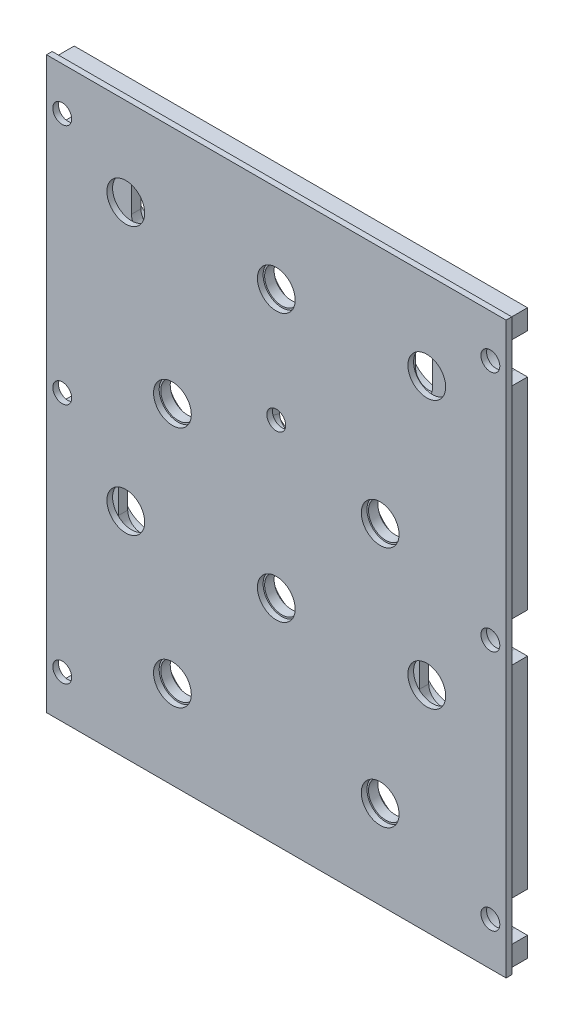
ISO-10303-21;
HEADER;
FILE_DESCRIPTION(('STEP AP214'),'2;1');
FILE_NAME('part.step','',(''),(''),'','','');
FILE_SCHEMA(('AUTOMOTIVE_DESIGN { 1 0 10303 214 1 1 1 1 }'));
ENDSEC;
DATA;
#1=APPLICATION_CONTEXT('core data for automotive mechanical design processes');
#2=APPLICATION_PROTOCOL_DEFINITION('international standard','automotive_design',2000,#1);
#3=PRODUCT_CONTEXT('',#1,'mechanical');
#4=PRODUCT('Part','Part','',(#3));
#5=PRODUCT_RELATED_PRODUCT_CATEGORY('part','',(#4));
#6=PRODUCT_DEFINITION_FORMATION('','',#4);
#7=PRODUCT_DEFINITION_CONTEXT('part definition',#1,'design');
#8=PRODUCT_DEFINITION('design','',#6,#7);
#9=PRODUCT_DEFINITION_SHAPE('','',#8);
#10=(LENGTH_UNIT() NAMED_UNIT(*) SI_UNIT(.MILLI.,.METRE.));
#11=(NAMED_UNIT(*) PLANE_ANGLE_UNIT() SI_UNIT($,.RADIAN.));
#12=(NAMED_UNIT(*) SI_UNIT($,.STERADIAN.) SOLID_ANGLE_UNIT());
#13=UNCERTAINTY_MEASURE_WITH_UNIT(LENGTH_MEASURE(1.E-05),#10,'distance_accuracy_value','');
#14=(GEOMETRIC_REPRESENTATION_CONTEXT(3) GLOBAL_UNCERTAINTY_ASSIGNED_CONTEXT((#13)) GLOBAL_UNIT_ASSIGNED_CONTEXT((#10,
#11,#12)) REPRESENTATION_CONTEXT('',''));
#15=CARTESIAN_POINT('',(0.,0.,0.));
#16=DIRECTION('',(0.,0.,1.));
#17=DIRECTION('',(1.,0.,0.));
#18=AXIS2_PLACEMENT_3D('',#15,#16,#17);
#19=CARTESIAN_POINT('',(0.,181.,1.8));
#20=DIRECTION('',(0.,0.,-1.));
#21=DIRECTION('',(-1.,0.,0.));
#22=AXIS2_PLACEMENT_3D('',#19,#20,#21);
#23=PLANE('',#22);
#24=CARTESIAN_POINT('',(141.,90.5000000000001,1.8));
#25=DIRECTION('',(0.,0.,-1.));
#26=DIRECTION('',(-1.,0.,0.));
#27=AXIS2_PLACEMENT_3D('',#24,#25,#26);
#28=CIRCLE('',#27,2.99999999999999);
#29=CARTESIAN_POINT('',(138.,90.5000000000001,1.8));
#30=VERTEX_POINT('',#29);
#31=EDGE_CURVE('E210',#30,#30,#28,.T.);
#32=ORIENTED_EDGE('',*,*,#31,.T.);
#33=EDGE_LOOP('',(#32));
#34=FACE_BOUND('',#33,.T.);
#35=CARTESIAN_POINT('',(4.99999999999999,167.3,1.8));
#36=DIRECTION('',(0.,0.,-1.));
#37=DIRECTION('',(-1.,0.,0.));
#38=AXIS2_PLACEMENT_3D('',#35,#36,#37);
#39=CIRCLE('',#38,3.);
#40=CARTESIAN_POINT('',(1.99999999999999,167.3,1.8));
#41=VERTEX_POINT('',#40);
#42=EDGE_CURVE('E198',#41,#41,#39,.T.);
#43=ORIENTED_EDGE('',*,*,#42,.T.);
#44=EDGE_LOOP('',(#43));
#45=FACE_BOUND('',#44,.T.);
#46=CARTESIAN_POINT('',(4.99999999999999,13.7,1.8));
#47=DIRECTION('',(0.,0.,-1.));
#48=DIRECTION('',(-1.,0.,0.));
#49=AXIS2_PLACEMENT_3D('',#46,#47,#48);
#50=CIRCLE('',#49,3.);
#51=CARTESIAN_POINT('',(1.99999999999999,13.7,1.8));
#52=VERTEX_POINT('',#51);
#53=EDGE_CURVE('E186',#52,#52,#50,.T.);
#54=ORIENTED_EDGE('',*,*,#53,.T.);
#55=EDGE_LOOP('',(#54));
#56=FACE_BOUND('',#55,.T.);
#57=CARTESIAN_POINT('',(25.191,153.,1.8));
#58=DIRECTION('',(0.,0.,1.));
#59=DIRECTION('',(1.,0.,0.));
#60=AXIS2_PLACEMENT_3D('',#57,#58,#59);
#61=CIRCLE('',#60,6.);
#62=CARTESIAN_POINT('',(31.191,153.,1.8));
#63=VERTEX_POINT('',#62);
#64=EDGE_CURVE('E171',#63,#63,#61,.T.);
#65=ORIENTED_EDGE('',*,*,#64,.F.);
#66=EDGE_LOOP('',(#65));
#67=FACE_BOUND('',#66,.T.);
#68=CARTESIAN_POINT('',(120.809,153.,1.8));
#69=DIRECTION('',(0.,0.,1.));
#70=DIRECTION('',(1.,0.,0.));
#71=AXIS2_PLACEMENT_3D('',#68,#69,#70);
#72=CIRCLE('',#71,6.00000000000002);
#73=CARTESIAN_POINT('',(126.809,153.,1.8));
#74=VERTEX_POINT('',#73);
#75=EDGE_CURVE('E159',#74,#74,#72,.T.);
#76=ORIENTED_EDGE('',*,*,#75,.F.);
#77=EDGE_LOOP('',(#76));
#78=FACE_BOUND('',#77,.T.);
#79=CARTESIAN_POINT('',(40.,105.,1.8));
#80=DIRECTION('',(0.,0.,1.));
#81=DIRECTION('',(1.,0.,0.));
#82=AXIS2_PLACEMENT_3D('',#79,#80,#81);
#83=CIRCLE('',#82,6.);
#84=CARTESIAN_POINT('',(46.,105.,1.8));
#85=VERTEX_POINT('',#84);
#86=EDGE_CURVE('E147',#85,#85,#83,.T.);
#87=ORIENTED_EDGE('',*,*,#86,.F.);
#88=EDGE_LOOP('',(#87));
#89=FACE_BOUND('',#88,.T.);
#90=CARTESIAN_POINT('',(73.,68.,1.8));
#91=DIRECTION('',(0.,0.,1.));
#92=DIRECTION('',(1.,0.,0.));
#93=AXIS2_PLACEMENT_3D('',#90,#91,#92);
#94=CIRCLE('',#93,6.);
#95=CARTESIAN_POINT('',(79.,68.,1.8));
#96=VERTEX_POINT('',#95);
#97=EDGE_CURVE('E135',#96,#96,#94,.T.);
#98=ORIENTED_EDGE('',*,*,#97,.F.);
#99=EDGE_LOOP('',(#98));
#100=FACE_BOUND('',#99,.T.);
#101=CARTESIAN_POINT('',(106.,28.,1.8));
#102=DIRECTION('',(0.,0.,1.));
#103=DIRECTION('',(1.,0.,0.));
#104=AXIS2_PLACEMENT_3D('',#101,#102,#103);
#105=CIRCLE('',#104,6.);
#106=CARTESIAN_POINT('',(112.,28.,1.8));
#107=VERTEX_POINT('',#106);
#108=EDGE_CURVE('E123',#107,#107,#105,.T.);
#109=ORIENTED_EDGE('',*,*,#108,.F.);
#110=EDGE_LOOP('',(#109));
#111=FACE_BOUND('',#110,.T.);
#112=DIRECTION('',(0.,-1.,0.));
#113=VECTOR('',#112,1.);
#114=CARTESIAN_POINT('',(0.,0.,1.8));
#115=LINE('',#114,#113);
#116=CARTESIAN_POINT('',(0.,181.,1.8));
#117=VERTEX_POINT('',#116);
#118=CARTESIAN_POINT('',(0.,0.,1.8));
#119=VERTEX_POINT('',#118);
#120=EDGE_CURVE('E93',#117,#119,#115,.T.);
#121=ORIENTED_EDGE('',*,*,#120,.T.);
#122=DIRECTION('',(1.,0.,0.));
#123=VECTOR('',#122,1.);
#124=CARTESIAN_POINT('',(0.,0.,1.8));
#125=LINE('',#124,#123);
#126=CARTESIAN_POINT('',(146.,0.,1.8));
#127=VERTEX_POINT('',#126);
#128=EDGE_CURVE('E88',#119,#127,#125,.T.);
#129=ORIENTED_EDGE('',*,*,#128,.T.);
#130=DIRECTION('',(0.,1.,0.));
#131=VECTOR('',#130,1.);
#132=CARTESIAN_POINT('',(146.,0.,1.8));
#133=LINE('',#132,#131);
#134=CARTESIAN_POINT('',(146.,181.,1.8));
#135=VERTEX_POINT('',#134);
#136=EDGE_CURVE('E91',#127,#135,#133,.T.);
#137=ORIENTED_EDGE('',*,*,#136,.T.);
#138=DIRECTION('',(-1.,0.,0.));
#139=VECTOR('',#138,1.);
#140=CARTESIAN_POINT('',(0.,181.,1.8));
#141=LINE('',#140,#139);
#142=EDGE_CURVE('E58',#135,#117,#141,.T.);
#143=ORIENTED_EDGE('',*,*,#142,.T.);
#144=EDGE_LOOP('',(#121,#129,#137,#143));
#145=FACE_BOUND('',#144,.T.);
#146=CARTESIAN_POINT('',(40.,28.,1.8));
#147=DIRECTION('',(0.,0.,1.));
#148=DIRECTION('',(1.,0.,0.));
#149=AXIS2_PLACEMENT_3D('',#146,#147,#148);
#150=CIRCLE('',#149,6.);
#151=CARTESIAN_POINT('',(46.,28.,1.8));
#152=VERTEX_POINT('',#151);
#153=EDGE_CURVE('E108',#152,#152,#150,.T.);
#154=ORIENTED_EDGE('',*,*,#153,.F.);
#155=EDGE_LOOP('',(#154));
#156=FACE_BOUND('',#155,.T.);
#157=CARTESIAN_POINT('',(120.809,68.,1.8));
#158=DIRECTION('',(0.,0.,1.));
#159=DIRECTION('',(1.,0.,0.));
#160=AXIS2_PLACEMENT_3D('',#157,#158,#159);
#161=CIRCLE('',#160,6.);
#162=CARTESIAN_POINT('',(126.809,68.,1.8));
#163=VERTEX_POINT('',#162);
#164=EDGE_CURVE('E129',#163,#163,#161,.T.);
#165=ORIENTED_EDGE('',*,*,#164,.F.);
#166=EDGE_LOOP('',(#165));
#167=FACE_BOUND('',#166,.T.);
#168=CARTESIAN_POINT('',(25.191,68.,1.8));
#169=DIRECTION('',(0.,0.,1.));
#170=DIRECTION('',(1.,0.,0.));
#171=AXIS2_PLACEMENT_3D('',#168,#169,#170);
#172=CIRCLE('',#171,6.);
#173=CARTESIAN_POINT('',(31.191,68.,1.8));
#174=VERTEX_POINT('',#173);
#175=EDGE_CURVE('E141',#174,#174,#172,.T.);
#176=ORIENTED_EDGE('',*,*,#175,.F.);
#177=EDGE_LOOP('',(#176));
#178=FACE_BOUND('',#177,.T.);
#179=CARTESIAN_POINT('',(106.,105.,1.8));
#180=DIRECTION('',(0.,0.,1.));
#181=DIRECTION('',(1.,0.,0.));
#182=AXIS2_PLACEMENT_3D('',#179,#180,#181);
#183=CIRCLE('',#182,6.);
#184=CARTESIAN_POINT('',(112.,105.,1.8));
#185=VERTEX_POINT('',#184);
#186=EDGE_CURVE('E153',#185,#185,#183,.T.);
#187=ORIENTED_EDGE('',*,*,#186,.F.);
#188=EDGE_LOOP('',(#187));
#189=FACE_BOUND('',#188,.T.);
#190=CARTESIAN_POINT('',(73.,153.,1.8));
#191=DIRECTION('',(0.,0.,1.));
#192=DIRECTION('',(1.,0.,0.));
#193=AXIS2_PLACEMENT_3D('',#190,#191,#192);
#194=CIRCLE('',#193,6.);
#195=CARTESIAN_POINT('',(79.,153.,1.8));
#196=VERTEX_POINT('',#195);
#197=EDGE_CURVE('E165',#196,#196,#194,.T.);
#198=ORIENTED_EDGE('',*,*,#197,.F.);
#199=EDGE_LOOP('',(#198));
#200=FACE_BOUND('',#199,.T.);
#201=CARTESIAN_POINT('',(73.,117.,1.8));
#202=DIRECTION('',(0.,0.,1.));
#203=DIRECTION('',(1.,0.,0.));
#204=AXIS2_PLACEMENT_3D('',#201,#202,#203);
#205=CIRCLE('',#204,3.00000000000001);
#206=CARTESIAN_POINT('',(76.,117.,1.8));
#207=VERTEX_POINT('',#206);
#208=EDGE_CURVE('E177',#207,#207,#205,.T.);
#209=ORIENTED_EDGE('',*,*,#208,.F.);
#210=EDGE_LOOP('',(#209));
#211=FACE_BOUND('',#210,.T.);
#212=CARTESIAN_POINT('',(4.99999999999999,90.5,1.8));
#213=DIRECTION('',(0.,0.,-1.));
#214=DIRECTION('',(-1.,0.,0.));
#215=AXIS2_PLACEMENT_3D('',#212,#213,#214);
#216=CIRCLE('',#215,3.);
#217=CARTESIAN_POINT('',(1.99999999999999,90.5,1.8));
#218=VERTEX_POINT('',#217);
#219=EDGE_CURVE('E192',#218,#218,#216,.T.);
#220=ORIENTED_EDGE('',*,*,#219,.T.);
#221=EDGE_LOOP('',(#220));
#222=FACE_BOUND('',#221,.T.);
#223=CARTESIAN_POINT('',(141.,13.7000000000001,1.8));
#224=DIRECTION('',(0.,0.,-1.));
#225=DIRECTION('',(-1.,0.,0.));
#226=AXIS2_PLACEMENT_3D('',#223,#224,#225);
#227=CIRCLE('',#226,2.99999999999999);
#228=CARTESIAN_POINT('',(138.,13.7000000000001,1.8));
#229=VERTEX_POINT('',#228);
#230=EDGE_CURVE('E204',#229,#229,#227,.T.);
#231=ORIENTED_EDGE('',*,*,#230,.T.);
#232=EDGE_LOOP('',(#231));
#233=FACE_BOUND('',#232,.T.);
#234=CARTESIAN_POINT('',(141.,167.3,1.8));
#235=DIRECTION('',(0.,0.,-1.));
#236=DIRECTION('',(-1.,0.,0.));
#237=AXIS2_PLACEMENT_3D('',#234,#235,#236);
#238=CIRCLE('',#237,2.99999999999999);
#239=CARTESIAN_POINT('',(138.,167.3,1.8));
#240=VERTEX_POINT('',#239);
#241=EDGE_CURVE('E216',#240,#240,#238,.T.);
#242=ORIENTED_EDGE('',*,*,#241,.T.);
#243=EDGE_LOOP('',(#242));
#244=FACE_BOUND('',#243,.T.);
#245=ADVANCED_FACE('F41',(#34,#45,#56,#67,#78,#89,#100,#111,#145,#156,#167,#178,#189,#200,#211,
#222,#233,#244),#23,.F.);
#246=CARTESIAN_POINT('',(0.,181.,0.));
#247=DIRECTION('',(0.,0.,-1.));
#248=DIRECTION('',(-1.,0.,0.));
#249=AXIS2_PLACEMENT_3D('',#246,#247,#248);
#250=PLANE('',#249);
#251=CARTESIAN_POINT('',(141.,90.5000000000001,0.));
#252=DIRECTION('',(0.,0.,1.));
#253=DIRECTION('',(1.,0.,0.));
#254=AXIS2_PLACEMENT_3D('',#251,#252,#253);
#255=CIRCLE('',#254,2.99999999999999);
#256=CARTESIAN_POINT('',(144.,90.5000000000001,0.));
#257=VERTEX_POINT('',#256);
#258=EDGE_CURVE('E207',#257,#257,#255,.T.);
#259=ORIENTED_EDGE('',*,*,#258,.T.);
#260=EDGE_LOOP('',(#259));
#261=FACE_BOUND('',#260,.T.);
#262=CARTESIAN_POINT('',(4.99999999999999,167.3,0.));
#263=DIRECTION('',(0.,0.,1.));
#264=DIRECTION('',(1.,0.,0.));
#265=AXIS2_PLACEMENT_3D('',#262,#263,#264);
#266=CIRCLE('',#265,3.);
#267=CARTESIAN_POINT('',(7.99999999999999,167.3,0.));
#268=VERTEX_POINT('',#267);
#269=EDGE_CURVE('E195',#268,#268,#266,.T.);
#270=ORIENTED_EDGE('',*,*,#269,.T.);
#271=EDGE_LOOP('',(#270));
#272=FACE_BOUND('',#271,.T.);
#273=CARTESIAN_POINT('',(4.99999999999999,13.7,0.));
#274=DIRECTION('',(0.,0.,1.));
#275=DIRECTION('',(1.,0.,0.));
#276=AXIS2_PLACEMENT_3D('',#273,#274,#275);
#277=CIRCLE('',#276,3.);
#278=CARTESIAN_POINT('',(7.99999999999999,13.7,0.));
#279=VERTEX_POINT('',#278);
#280=EDGE_CURVE('E183',#279,#279,#277,.T.);
#281=ORIENTED_EDGE('',*,*,#280,.T.);
#282=EDGE_LOOP('',(#281));
#283=FACE_BOUND('',#282,.T.);
#284=CARTESIAN_POINT('',(25.191,153.,0.));
#285=DIRECTION('',(0.,0.,1.));
#286=DIRECTION('',(1.,0.,0.));
#287=AXIS2_PLACEMENT_3D('',#284,#285,#286);
#288=CIRCLE('',#287,6.);
#289=CARTESIAN_POINT('',(31.191,153.,0.));
#290=VERTEX_POINT('',#289);
#291=EDGE_CURVE('E174',#290,#290,#288,.T.);
#292=ORIENTED_EDGE('',*,*,#291,.T.);
#293=EDGE_LOOP('',(#292));
#294=FACE_BOUND('',#293,.T.);
#295=CARTESIAN_POINT('',(120.809,153.,0.));
#296=DIRECTION('',(0.,0.,1.));
#297=DIRECTION('',(1.,0.,0.));
#298=AXIS2_PLACEMENT_3D('',#295,#296,#297);
#299=CIRCLE('',#298,6.00000000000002);
#300=CARTESIAN_POINT('',(126.809,153.,0.));
#301=VERTEX_POINT('',#300);
#302=EDGE_CURVE('E162',#301,#301,#299,.T.);
#303=ORIENTED_EDGE('',*,*,#302,.T.);
#304=EDGE_LOOP('',(#303));
#305=FACE_BOUND('',#304,.T.);
#306=CARTESIAN_POINT('',(40.,105.,0.));
#307=DIRECTION('',(0.,0.,1.));
#308=DIRECTION('',(1.,0.,0.));
#309=AXIS2_PLACEMENT_3D('',#306,#307,#308);
#310=CIRCLE('',#309,6.);
#311=CARTESIAN_POINT('',(46.,105.,0.));
#312=VERTEX_POINT('',#311);
#313=EDGE_CURVE('E150',#312,#312,#310,.T.);
#314=ORIENTED_EDGE('',*,*,#313,.T.);
#315=EDGE_LOOP('',(#314));
#316=FACE_BOUND('',#315,.T.);
#317=CARTESIAN_POINT('',(73.,68.,0.));
#318=DIRECTION('',(0.,0.,1.));
#319=DIRECTION('',(1.,0.,0.));
#320=AXIS2_PLACEMENT_3D('',#317,#318,#319);
#321=CIRCLE('',#320,6.);
#322=CARTESIAN_POINT('',(79.,68.,0.));
#323=VERTEX_POINT('',#322);
#324=EDGE_CURVE('E138',#323,#323,#321,.T.);
#325=ORIENTED_EDGE('',*,*,#324,.T.);
#326=EDGE_LOOP('',(#325));
#327=FACE_BOUND('',#326,.T.);
#328=CARTESIAN_POINT('',(106.,28.,0.));
#329=DIRECTION('',(0.,0.,1.));
#330=DIRECTION('',(1.,0.,0.));
#331=AXIS2_PLACEMENT_3D('',#328,#329,#330);
#332=CIRCLE('',#331,6.);
#333=CARTESIAN_POINT('',(112.,28.,0.));
#334=VERTEX_POINT('',#333);
#335=EDGE_CURVE('E126',#334,#334,#332,.T.);
#336=ORIENTED_EDGE('',*,*,#335,.T.);
#337=EDGE_LOOP('',(#336));
#338=FACE_BOUND('',#337,.T.);
#339=DIRECTION('',(0.,-1.,0.));
#340=VECTOR('',#339,1.);
#341=CARTESIAN_POINT('',(0.,0.,0.));
#342=LINE('',#341,#340);
#343=CARTESIAN_POINT('',(0.,181.,0.));
#344=VERTEX_POINT('',#343);
#345=CARTESIAN_POINT('',(0.,0.,0.));
#346=VERTEX_POINT('',#345);
#347=EDGE_CURVE('E105',#344,#346,#342,.T.);
#348=ORIENTED_EDGE('',*,*,#347,.F.);
#349=DIRECTION('',(-1.,0.,0.));
#350=VECTOR('',#349,1.);
#351=CARTESIAN_POINT('',(0.,181.,0.));
#352=LINE('',#351,#350);
#353=CARTESIAN_POINT('',(146.,181.,0.));
#354=VERTEX_POINT('',#353);
#355=EDGE_CURVE('E81',#354,#344,#352,.T.);
#356=ORIENTED_EDGE('',*,*,#355,.F.);
#357=DIRECTION('',(0.,1.,0.));
#358=VECTOR('',#357,1.);
#359=CARTESIAN_POINT('',(146.,0.,0.));
#360=LINE('',#359,#358);
#361=CARTESIAN_POINT('',(146.,0.,0.));
#362=VERTEX_POINT('',#361);
#363=EDGE_CURVE('E75',#362,#354,#360,.T.);
#364=ORIENTED_EDGE('',*,*,#363,.F.);
#365=DIRECTION('',(1.,0.,0.));
#366=VECTOR('',#365,1.);
#367=CARTESIAN_POINT('',(0.,0.,0.));
#368=LINE('',#367,#366);
#369=EDGE_CURVE('E97',#346,#362,#368,.T.);
#370=ORIENTED_EDGE('',*,*,#369,.F.);
#371=EDGE_LOOP('',(#348,#356,#364,#370));
#372=FACE_BOUND('',#371,.T.);
#373=CARTESIAN_POINT('',(40.,28.,0.));
#374=DIRECTION('',(0.,0.,1.));
#375=DIRECTION('',(1.,0.,0.));
#376=AXIS2_PLACEMENT_3D('',#373,#374,#375);
#377=CIRCLE('',#376,6.);
#378=CARTESIAN_POINT('',(46.,28.,0.));
#379=VERTEX_POINT('',#378);
#380=EDGE_CURVE('E120',#379,#379,#377,.T.);
#381=ORIENTED_EDGE('',*,*,#380,.T.);
#382=EDGE_LOOP('',(#381));
#383=FACE_BOUND('',#382,.T.);
#384=CARTESIAN_POINT('',(120.809,68.,0.));
#385=DIRECTION('',(0.,0.,1.));
#386=DIRECTION('',(1.,0.,0.));
#387=AXIS2_PLACEMENT_3D('',#384,#385,#386);
#388=CIRCLE('',#387,6.);
#389=CARTESIAN_POINT('',(126.809,68.,0.));
#390=VERTEX_POINT('',#389);
#391=EDGE_CURVE('E132',#390,#390,#388,.T.);
#392=ORIENTED_EDGE('',*,*,#391,.T.);
#393=EDGE_LOOP('',(#392));
#394=FACE_BOUND('',#393,.T.);
#395=CARTESIAN_POINT('',(25.191,68.,0.));
#396=DIRECTION('',(0.,0.,1.));
#397=DIRECTION('',(1.,0.,0.));
#398=AXIS2_PLACEMENT_3D('',#395,#396,#397);
#399=CIRCLE('',#398,6.);
#400=CARTESIAN_POINT('',(31.191,68.,0.));
#401=VERTEX_POINT('',#400);
#402=EDGE_CURVE('E144',#401,#401,#399,.T.);
#403=ORIENTED_EDGE('',*,*,#402,.T.);
#404=EDGE_LOOP('',(#403));
#405=FACE_BOUND('',#404,.T.);
#406=CARTESIAN_POINT('',(106.,105.,0.));
#407=DIRECTION('',(0.,0.,1.));
#408=DIRECTION('',(1.,0.,0.));
#409=AXIS2_PLACEMENT_3D('',#406,#407,#408);
#410=CIRCLE('',#409,6.);
#411=CARTESIAN_POINT('',(112.,105.,0.));
#412=VERTEX_POINT('',#411);
#413=EDGE_CURVE('E156',#412,#412,#410,.T.);
#414=ORIENTED_EDGE('',*,*,#413,.T.);
#415=EDGE_LOOP('',(#414));
#416=FACE_BOUND('',#415,.T.);
#417=CARTESIAN_POINT('',(73.,153.,0.));
#418=DIRECTION('',(0.,0.,1.));
#419=DIRECTION('',(1.,0.,0.));
#420=AXIS2_PLACEMENT_3D('',#417,#418,#419);
#421=CIRCLE('',#420,6.);
#422=CARTESIAN_POINT('',(79.,153.,0.));
#423=VERTEX_POINT('',#422);
#424=EDGE_CURVE('E168',#423,#423,#421,.T.);
#425=ORIENTED_EDGE('',*,*,#424,.T.);
#426=EDGE_LOOP('',(#425));
#427=FACE_BOUND('',#426,.T.);
#428=CARTESIAN_POINT('',(73.,117.,0.));
#429=DIRECTION('',(0.,0.,1.));
#430=DIRECTION('',(1.,0.,0.));
#431=AXIS2_PLACEMENT_3D('',#428,#429,#430);
#432=CIRCLE('',#431,3.00000000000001);
#433=CARTESIAN_POINT('',(76.,117.,0.));
#434=VERTEX_POINT('',#433);
#435=EDGE_CURVE('E180',#434,#434,#432,.T.);
#436=ORIENTED_EDGE('',*,*,#435,.T.);
#437=EDGE_LOOP('',(#436));
#438=FACE_BOUND('',#437,.T.);
#439=CARTESIAN_POINT('',(4.99999999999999,90.5,0.));
#440=DIRECTION('',(0.,0.,1.));
#441=DIRECTION('',(1.,0.,0.));
#442=AXIS2_PLACEMENT_3D('',#439,#440,#441);
#443=CIRCLE('',#442,3.);
#444=CARTESIAN_POINT('',(7.99999999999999,90.5,0.));
#445=VERTEX_POINT('',#444);
#446=EDGE_CURVE('E189',#445,#445,#443,.T.);
#447=ORIENTED_EDGE('',*,*,#446,.T.);
#448=EDGE_LOOP('',(#447));
#449=FACE_BOUND('',#448,.T.);
#450=CARTESIAN_POINT('',(141.,13.7000000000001,0.));
#451=DIRECTION('',(0.,0.,1.));
#452=DIRECTION('',(1.,0.,0.));
#453=AXIS2_PLACEMENT_3D('',#450,#451,#452);
#454=CIRCLE('',#453,2.99999999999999);
#455=CARTESIAN_POINT('',(144.,13.7000000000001,0.));
#456=VERTEX_POINT('',#455);
#457=EDGE_CURVE('E201',#456,#456,#454,.T.);
#458=ORIENTED_EDGE('',*,*,#457,.T.);
#459=EDGE_LOOP('',(#458));
#460=FACE_BOUND('',#459,.T.);
#461=CARTESIAN_POINT('',(141.,167.3,0.));
#462=DIRECTION('',(0.,0.,1.));
#463=DIRECTION('',(1.,0.,0.));
#464=AXIS2_PLACEMENT_3D('',#461,#462,#463);
#465=CIRCLE('',#464,2.99999999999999);
#466=CARTESIAN_POINT('',(144.,167.3,0.));
#467=VERTEX_POINT('',#466);
#468=EDGE_CURVE('E213',#467,#467,#465,.T.);
#469=ORIENTED_EDGE('',*,*,#468,.T.);
#470=EDGE_LOOP('',(#469));
#471=FACE_BOUND('',#470,.T.);
#472=ADVANCED_FACE('F116',(#261,#272,#283,#294,#305,#316,#327,#338,#372,#383,#394,#405,#416,
#427,#438,#449,#460,#471),#250,.T.);
#473=CARTESIAN_POINT('',(0.,0.,1.8));
#474=DIRECTION('',(1.,0.,0.));
#475=DIRECTION('',(0.,0.,-1.));
#476=AXIS2_PLACEMENT_3D('',#473,#474,#475);
#477=PLANE('',#476);
#478=ORIENTED_EDGE('',*,*,#347,.T.);
#479=DIRECTION('',(0.,0.,-1.));
#480=VECTOR('',#479,1.);
#481=CARTESIAN_POINT('',(0.,0.,1.8));
#482=LINE('',#481,#480);
#483=EDGE_CURVE('E12',#119,#346,#482,.T.);
#484=ORIENTED_EDGE('',*,*,#483,.F.);
#485=ORIENTED_EDGE('',*,*,#120,.F.);
#486=DIRECTION('',(0.,0.,-1.));
#487=VECTOR('',#486,1.);
#488=CARTESIAN_POINT('',(0.,181.,1.8));
#489=LINE('',#488,#487);
#490=EDGE_CURVE('E101',#117,#344,#489,.T.);
#491=ORIENTED_EDGE('',*,*,#490,.T.);
#492=EDGE_LOOP('',(#478,#484,#485,#491));
#493=FACE_BOUND('',#492,.T.);
#494=ADVANCED_FACE('F43',(#493),#477,.F.);
#495=CARTESIAN_POINT('',(0.,0.,1.8));
#496=DIRECTION('',(0.,1.,0.));
#497=DIRECTION('',(0.,0.,1.));
#498=AXIS2_PLACEMENT_3D('',#495,#496,#497);
#499=PLANE('',#498);
#500=ORIENTED_EDGE('',*,*,#369,.T.);
#501=DIRECTION('',(0.,0.,-1.));
#502=VECTOR('',#501,1.);
#503=CARTESIAN_POINT('',(146.,0.,1.8));
#504=LINE('',#503,#502);
#505=EDGE_CURVE('E50',#127,#362,#504,.T.);
#506=ORIENTED_EDGE('',*,*,#505,.F.);
#507=ORIENTED_EDGE('',*,*,#128,.F.);
#508=ORIENTED_EDGE('',*,*,#483,.T.);
#509=EDGE_LOOP('',(#500,#506,#507,#508));
#510=FACE_BOUND('',#509,.T.);
#511=ADVANCED_FACE('F96',(#510),#499,.F.);
#512=CARTESIAN_POINT('',(146.,0.,1.8));
#513=DIRECTION('',(-1.,0.,0.));
#514=DIRECTION('',(0.,-1.,0.));
#515=AXIS2_PLACEMENT_3D('',#512,#513,#514);
#516=PLANE('',#515);
#517=ORIENTED_EDGE('',*,*,#363,.T.);
#518=DIRECTION('',(0.,0.,-1.));
#519=VECTOR('',#518,1.);
#520=CARTESIAN_POINT('',(146.,181.,1.8));
#521=LINE('',#520,#519);
#522=EDGE_CURVE('E98',#135,#354,#521,.T.);
#523=ORIENTED_EDGE('',*,*,#522,.F.);
#524=ORIENTED_EDGE('',*,*,#136,.F.);
#525=ORIENTED_EDGE('',*,*,#505,.T.);
#526=EDGE_LOOP('',(#517,#523,#524,#525));
#527=FACE_BOUND('',#526,.T.);
#528=ADVANCED_FACE('F99',(#527),#516,.F.);
#529=CARTESIAN_POINT('',(0.,181.,1.8));
#530=DIRECTION('',(0.,-1.,0.));
#531=DIRECTION('',(0.,0.,-1.));
#532=AXIS2_PLACEMENT_3D('',#529,#530,#531);
#533=PLANE('',#532);
#534=ORIENTED_EDGE('',*,*,#355,.T.);
#535=ORIENTED_EDGE('',*,*,#490,.F.);
#536=ORIENTED_EDGE('',*,*,#142,.F.);
#537=ORIENTED_EDGE('',*,*,#522,.T.);
#538=EDGE_LOOP('',(#534,#535,#536,#537));
#539=FACE_BOUND('',#538,.T.);
#540=ADVANCED_FACE('F113',(#539),#533,.F.);
#541=CARTESIAN_POINT('',(40.,28.,1.8));
#542=DIRECTION('',(0.,0.,-1.));
#543=DIRECTION('',(-1.,0.,0.));
#544=AXIS2_PLACEMENT_3D('',#541,#542,#543);
#545=CYLINDRICAL_SURFACE('',#544,6.);
#546=ORIENTED_EDGE('',*,*,#153,.T.);
#547=EDGE_LOOP('',(#546));
#548=FACE_BOUND('',#547,.T.);
#549=ORIENTED_EDGE('',*,*,#380,.F.);
#550=EDGE_LOOP('',(#549));
#551=FACE_BOUND('',#550,.T.);
#552=ADVANCED_FACE('F240',(#548,#551),#545,.F.);
#553=CARTESIAN_POINT('',(106.,28.,1.8));
#554=DIRECTION('',(0.,0.,-1.));
#555=DIRECTION('',(-1.,0.,0.));
#556=AXIS2_PLACEMENT_3D('',#553,#554,#555);
#557=CYLINDRICAL_SURFACE('',#556,6.);
#558=ORIENTED_EDGE('',*,*,#108,.T.);
#559=EDGE_LOOP('',(#558));
#560=FACE_BOUND('',#559,.T.);
#561=ORIENTED_EDGE('',*,*,#335,.F.);
#562=EDGE_LOOP('',(#561));
#563=FACE_BOUND('',#562,.T.);
#564=ADVANCED_FACE('F356',(#560,#563),#557,.F.);
#565=CARTESIAN_POINT('',(120.809,68.,1.8));
#566=DIRECTION('',(0.,0.,-1.));
#567=DIRECTION('',(-1.,0.,0.));
#568=AXIS2_PLACEMENT_3D('',#565,#566,#567);
#569=CYLINDRICAL_SURFACE('',#568,6.);
#570=ORIENTED_EDGE('',*,*,#164,.T.);
#571=EDGE_LOOP('',(#570));
#572=FACE_BOUND('',#571,.T.);
#573=ORIENTED_EDGE('',*,*,#391,.F.);
#574=EDGE_LOOP('',(#573));
#575=FACE_BOUND('',#574,.T.);
#576=ADVANCED_FACE('F353',(#572,#575),#569,.F.);
#577=CARTESIAN_POINT('',(73.,68.,1.8));
#578=DIRECTION('',(0.,0.,-1.));
#579=DIRECTION('',(-1.,0.,0.));
#580=AXIS2_PLACEMENT_3D('',#577,#578,#579);
#581=CYLINDRICAL_SURFACE('',#580,6.);
#582=ORIENTED_EDGE('',*,*,#97,.T.);
#583=EDGE_LOOP('',(#582));
#584=FACE_BOUND('',#583,.T.);
#585=ORIENTED_EDGE('',*,*,#324,.F.);
#586=EDGE_LOOP('',(#585));
#587=FACE_BOUND('',#586,.T.);
#588=ADVANCED_FACE('F349',(#584,#587),#581,.F.);
#589=CARTESIAN_POINT('',(25.191,68.,1.8));
#590=DIRECTION('',(0.,0.,-1.));
#591=DIRECTION('',(-1.,0.,0.));
#592=AXIS2_PLACEMENT_3D('',#589,#590,#591);
#593=CYLINDRICAL_SURFACE('',#592,6.);
#594=ORIENTED_EDGE('',*,*,#175,.T.);
#595=EDGE_LOOP('',(#594));
#596=FACE_BOUND('',#595,.T.);
#597=ORIENTED_EDGE('',*,*,#402,.F.);
#598=EDGE_LOOP('',(#597));
#599=FACE_BOUND('',#598,.T.);
#600=ADVANCED_FACE('F345',(#596,#599),#593,.F.);
#601=CARTESIAN_POINT('',(40.,105.,1.8));
#602=DIRECTION('',(0.,0.,-1.));
#603=DIRECTION('',(-1.,0.,0.));
#604=AXIS2_PLACEMENT_3D('',#601,#602,#603);
#605=CYLINDRICAL_SURFACE('',#604,6.);
#606=ORIENTED_EDGE('',*,*,#86,.T.);
#607=EDGE_LOOP('',(#606));
#608=FACE_BOUND('',#607,.T.);
#609=ORIENTED_EDGE('',*,*,#313,.F.);
#610=EDGE_LOOP('',(#609));
#611=FACE_BOUND('',#610,.T.);
#612=ADVANCED_FACE('F341',(#608,#611),#605,.F.);
#613=CARTESIAN_POINT('',(106.,105.,1.8));
#614=DIRECTION('',(0.,0.,-1.));
#615=DIRECTION('',(-1.,0.,0.));
#616=AXIS2_PLACEMENT_3D('',#613,#614,#615);
#617=CYLINDRICAL_SURFACE('',#616,6.);
#618=ORIENTED_EDGE('',*,*,#186,.T.);
#619=EDGE_LOOP('',(#618));
#620=FACE_BOUND('',#619,.T.);
#621=ORIENTED_EDGE('',*,*,#413,.F.);
#622=EDGE_LOOP('',(#621));
#623=FACE_BOUND('',#622,.T.);
#624=ADVANCED_FACE('F337',(#620,#623),#617,.F.);
#625=CARTESIAN_POINT('',(120.809,153.,1.8));
#626=DIRECTION('',(0.,0.,-1.));
#627=DIRECTION('',(-1.,0.,0.));
#628=AXIS2_PLACEMENT_3D('',#625,#626,#627);
#629=CYLINDRICAL_SURFACE('',#628,6.00000000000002);
#630=ORIENTED_EDGE('',*,*,#75,.T.);
#631=EDGE_LOOP('',(#630));
#632=FACE_BOUND('',#631,.T.);
#633=ORIENTED_EDGE('',*,*,#302,.F.);
#634=EDGE_LOOP('',(#633));
#635=FACE_BOUND('',#634,.T.);
#636=ADVANCED_FACE('F333',(#632,#635),#629,.F.);
#637=CARTESIAN_POINT('',(73.,153.,1.8));
#638=DIRECTION('',(0.,0.,-1.));
#639=DIRECTION('',(-1.,0.,0.));
#640=AXIS2_PLACEMENT_3D('',#637,#638,#639);
#641=CYLINDRICAL_SURFACE('',#640,6.);
#642=ORIENTED_EDGE('',*,*,#197,.T.);
#643=EDGE_LOOP('',(#642));
#644=FACE_BOUND('',#643,.T.);
#645=ORIENTED_EDGE('',*,*,#424,.F.);
#646=EDGE_LOOP('',(#645));
#647=FACE_BOUND('',#646,.T.);
#648=ADVANCED_FACE('F329',(#644,#647),#641,.F.);
#649=CARTESIAN_POINT('',(25.191,153.,1.8));
#650=DIRECTION('',(0.,0.,-1.));
#651=DIRECTION('',(-1.,0.,0.));
#652=AXIS2_PLACEMENT_3D('',#649,#650,#651);
#653=CYLINDRICAL_SURFACE('',#652,6.);
#654=ORIENTED_EDGE('',*,*,#64,.T.);
#655=EDGE_LOOP('',(#654));
#656=FACE_BOUND('',#655,.T.);
#657=ORIENTED_EDGE('',*,*,#291,.F.);
#658=EDGE_LOOP('',(#657));
#659=FACE_BOUND('',#658,.T.);
#660=ADVANCED_FACE('F325',(#656,#659),#653,.F.);
#661=CARTESIAN_POINT('',(73.,117.,1.8));
#662=DIRECTION('',(0.,0.,-1.));
#663=DIRECTION('',(-1.,0.,0.));
#664=AXIS2_PLACEMENT_3D('',#661,#662,#663);
#665=CYLINDRICAL_SURFACE('',#664,3.00000000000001);
#666=ORIENTED_EDGE('',*,*,#208,.T.);
#667=EDGE_LOOP('',(#666));
#668=FACE_BOUND('',#667,.T.);
#669=ORIENTED_EDGE('',*,*,#435,.F.);
#670=EDGE_LOOP('',(#669));
#671=FACE_BOUND('',#670,.T.);
#672=ADVANCED_FACE('F271',(#668,#671),#665,.F.);
#673=CARTESIAN_POINT('',(4.99999999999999,13.7,1.801));
#674=DIRECTION('',(0.,0.,-1.));
#675=DIRECTION('',(-1.,0.,0.));
#676=AXIS2_PLACEMENT_3D('',#673,#674,#675);
#677=CYLINDRICAL_SURFACE('',#676,3.);
#678=ORIENTED_EDGE('',*,*,#280,.F.);
#679=EDGE_LOOP('',(#678));
#680=FACE_BOUND('',#679,.T.);
#681=ORIENTED_EDGE('',*,*,#53,.F.);
#682=EDGE_LOOP('',(#681));
#683=FACE_BOUND('',#682,.T.);
#684=ADVANCED_FACE('F265',(#680,#683),#677,.F.);
#685=CARTESIAN_POINT('',(4.99999999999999,90.5,1.801));
#686=DIRECTION('',(0.,0.,-1.));
#687=DIRECTION('',(-1.,0.,0.));
#688=AXIS2_PLACEMENT_3D('',#685,#686,#687);
#689=CYLINDRICAL_SURFACE('',#688,3.);
#690=ORIENTED_EDGE('',*,*,#446,.F.);
#691=EDGE_LOOP('',(#690));
#692=FACE_BOUND('',#691,.T.);
#693=ORIENTED_EDGE('',*,*,#219,.F.);
#694=EDGE_LOOP('',(#693));
#695=FACE_BOUND('',#694,.T.);
#696=ADVANCED_FACE('F270',(#692,#695),#689,.F.);
#697=CARTESIAN_POINT('',(4.99999999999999,167.3,1.801));
#698=DIRECTION('',(0.,0.,-1.));
#699=DIRECTION('',(-1.,0.,0.));
#700=AXIS2_PLACEMENT_3D('',#697,#698,#699);
#701=CYLINDRICAL_SURFACE('',#700,3.);
#702=ORIENTED_EDGE('',*,*,#269,.F.);
#703=EDGE_LOOP('',(#702));
#704=FACE_BOUND('',#703,.T.);
#705=ORIENTED_EDGE('',*,*,#42,.F.);
#706=EDGE_LOOP('',(#705));
#707=FACE_BOUND('',#706,.T.);
#708=ADVANCED_FACE('F282',(#704,#707),#701,.F.);
#709=CARTESIAN_POINT('',(141.,13.7000000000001,1.801));
#710=DIRECTION('',(0.,0.,-1.));
#711=DIRECTION('',(-1.,0.,0.));
#712=AXIS2_PLACEMENT_3D('',#709,#710,#711);
#713=CYLINDRICAL_SURFACE('',#712,2.99999999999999);
#714=ORIENTED_EDGE('',*,*,#457,.F.);
#715=EDGE_LOOP('',(#714));
#716=FACE_BOUND('',#715,.T.);
#717=ORIENTED_EDGE('',*,*,#230,.F.);
#718=EDGE_LOOP('',(#717));
#719=FACE_BOUND('',#718,.T.);
#720=ADVANCED_FACE('F292',(#716,#719),#713,.F.);
#721=CARTESIAN_POINT('',(141.,90.5000000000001,1.801));
#722=DIRECTION('',(0.,0.,-1.));
#723=DIRECTION('',(-1.,0.,0.));
#724=AXIS2_PLACEMENT_3D('',#721,#722,#723);
#725=CYLINDRICAL_SURFACE('',#724,2.99999999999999);
#726=ORIENTED_EDGE('',*,*,#258,.F.);
#727=EDGE_LOOP('',(#726));
#728=FACE_BOUND('',#727,.T.);
#729=ORIENTED_EDGE('',*,*,#31,.F.);
#730=EDGE_LOOP('',(#729));
#731=FACE_BOUND('',#730,.T.);
#732=ADVANCED_FACE('F226',(#728,#731),#725,.F.);
#733=CARTESIAN_POINT('',(141.,167.3,1.801));
#734=DIRECTION('',(0.,0.,-1.));
#735=DIRECTION('',(-1.,0.,0.));
#736=AXIS2_PLACEMENT_3D('',#733,#734,#735);
#737=CYLINDRICAL_SURFACE('',#736,2.99999999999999);
#738=ORIENTED_EDGE('',*,*,#468,.F.);
#739=EDGE_LOOP('',(#738));
#740=FACE_BOUND('',#739,.T.);
#741=ORIENTED_EDGE('',*,*,#241,.F.);
#742=EDGE_LOOP('',(#741));
#743=FACE_BOUND('',#742,.T.);
#744=ADVANCED_FACE('F223',(#740,#743),#737,.F.);
#745=CLOSED_SHELL('',(#245,#472,#494,#511,#528,#540,#552,#564,#576,#588,#600,#612,#624,#636,
#648,#660,#672,#684,#696,#708,#720,#732,#744));
#746=MANIFOLD_SOLID_BREP('B2',#745);
#747=CARTESIAN_POINT('',(73.,114.5,-6.));
#748=DIRECTION('',(0.,0.,1.));
#749=DIRECTION('',(-1.,0.,0.));
#750=AXIS2_PLACEMENT_3D('',#747,#748,#749);
#751=CONICAL_SURFACE('',#750,2.5,0.392699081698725);
#752=DIRECTION('',(-0.382683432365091,0.,-0.923879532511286));
#753=VECTOR('',#752,1.);
#754=CARTESIAN_POINT('',(75.5,114.5,-6.00000000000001));
#755=LINE('',#754,#753);
#756=CARTESIAN_POINT('',(77.9852813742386,114.5,0.));
#757=VERTEX_POINT('',#756);
#758=CARTESIAN_POINT('',(76.7426406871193,114.5,-3.));
#759=VERTEX_POINT('',#758);
#760=EDGE_CURVE('E836',#757,#759,#755,.T.);
#761=ORIENTED_EDGE('',*,*,#760,.T.);
#762=CARTESIAN_POINT('',(73.,114.5,-3.));
#763=DIRECTION('',(0.,0.,-1.));
#764=DIRECTION('',(-1.,0.,0.));
#765=AXIS2_PLACEMENT_3D('',#762,#763,#764);
#766=CIRCLE('',#765,3.74264068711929);
#767=CARTESIAN_POINT('',(69.2573593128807,114.5,-3.));
#768=VERTEX_POINT('',#767);
#769=EDGE_CURVE('E825',#759,#768,#766,.T.);
#770=ORIENTED_EDGE('',*,*,#769,.T.);
#771=DIRECTION('',(0.382683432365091,0.,-0.923879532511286));
#772=VECTOR('',#771,1.);
#773=CARTESIAN_POINT('',(70.5,114.5,-6.));
#774=LINE('',#773,#772);
#775=CARTESIAN_POINT('',(68.0147186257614,114.5,0.));
#776=VERTEX_POINT('',#775);
#777=EDGE_CURVE('E833',#776,#768,#774,.T.);
#778=ORIENTED_EDGE('',*,*,#777,.F.);
#779=CARTESIAN_POINT('',(73.,114.5,0.));
#780=DIRECTION('',(0.,0.,1.));
#781=DIRECTION('',(1.,0.,0.));
#782=AXIS2_PLACEMENT_3D('',#779,#780,#781);
#783=CIRCLE('',#782,4.98528137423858);
#784=EDGE_CURVE('E859',#776,#757,#783,.T.);
#785=ORIENTED_EDGE('',*,*,#784,.T.);
#786=EDGE_LOOP('',(#761,#770,#778,#785));
#787=FACE_BOUND('',#786,.T.);
#788=ADVANCED_FACE('F521',(#787),#751,.F.);
#789=CARTESIAN_POINT('',(75.5,119.5,-6.));
#790=DIRECTION('',(-0.923879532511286,0.,0.382683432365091));
#791=DIRECTION('',(0.382683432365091,0.,0.923879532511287));
#792=AXIS2_PLACEMENT_3D('',#789,#790,#791);
#793=PLANE('',#792);
#794=DIRECTION('',(-0.382683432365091,0.,-0.923879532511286));
#795=VECTOR('',#794,1.);
#796=CARTESIAN_POINT('',(75.5,119.5,-6.));
#797=LINE('',#796,#795);
#798=CARTESIAN_POINT('',(77.9852813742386,119.5,0.));
#799=VERTEX_POINT('',#798);
#800=CARTESIAN_POINT('',(76.7426406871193,119.5,-3.));
#801=VERTEX_POINT('',#800);
#802=EDGE_CURVE('E845',#799,#801,#797,.T.);
#803=ORIENTED_EDGE('',*,*,#802,.T.);
#804=DIRECTION('',(0.,-1.,0.));
#805=VECTOR('',#804,1.);
#806=CARTESIAN_POINT('',(76.7426406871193,119.5,-3.));
#807=LINE('',#806,#805);
#808=EDGE_CURVE('E838',#801,#759,#807,.T.);
#809=ORIENTED_EDGE('',*,*,#808,.T.);
#810=ORIENTED_EDGE('',*,*,#760,.F.);
#811=DIRECTION('',(0.,1.,0.));
#812=VECTOR('',#811,1.);
#813=CARTESIAN_POINT('',(77.9852813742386,119.5,0.));
#814=LINE('',#813,#812);
#815=EDGE_CURVE('E857',#757,#799,#814,.T.);
#816=ORIENTED_EDGE('',*,*,#815,.T.);
#817=EDGE_LOOP('',(#803,#809,#810,#816));
#818=FACE_BOUND('',#817,.T.);
#819=ADVANCED_FACE('F1314',(#818),#793,.T.);
#820=CARTESIAN_POINT('',(73.,119.5,-6.));
#821=DIRECTION('',(0.,0.,1.));
#822=DIRECTION('',(1.,0.,0.));
#823=AXIS2_PLACEMENT_3D('',#820,#821,#822);
#824=CONICAL_SURFACE('',#823,2.5,0.392699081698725);
#825=DIRECTION('',(0.382683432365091,0.,-0.923879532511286));
#826=VECTOR('',#825,1.);
#827=CARTESIAN_POINT('',(70.5,119.5,-6.));
#828=LINE('',#827,#826);
#829=CARTESIAN_POINT('',(68.0147186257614,119.5,0.));
#830=VERTEX_POINT('',#829);
#831=CARTESIAN_POINT('',(69.2573593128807,119.5,-3.));
#832=VERTEX_POINT('',#831);
#833=EDGE_CURVE('E843',#830,#832,#828,.T.);
#834=ORIENTED_EDGE('',*,*,#833,.T.);
#835=CARTESIAN_POINT('',(73.,119.5,-3.));
#836=DIRECTION('',(0.,0.,-1.));
#837=DIRECTION('',(-1.,0.,0.));
#838=AXIS2_PLACEMENT_3D('',#835,#836,#837);
#839=CIRCLE('',#838,3.74264068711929);
#840=EDGE_CURVE('E536',#832,#801,#839,.T.);
#841=ORIENTED_EDGE('',*,*,#840,.T.);
#842=ORIENTED_EDGE('',*,*,#802,.F.);
#843=CARTESIAN_POINT('',(73.,119.5,0.));
#844=DIRECTION('',(0.,0.,1.));
#845=DIRECTION('',(1.,0.,0.));
#846=AXIS2_PLACEMENT_3D('',#843,#844,#845);
#847=CIRCLE('',#846,4.98528137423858);
#848=EDGE_CURVE('E847',#799,#830,#847,.T.);
#849=ORIENTED_EDGE('',*,*,#848,.T.);
#850=EDGE_LOOP('',(#834,#841,#842,#849));
#851=FACE_BOUND('',#850,.T.);
#852=ADVANCED_FACE('F523',(#851),#824,.F.);
#853=CARTESIAN_POINT('',(70.5,119.5,-6.));
#854=DIRECTION('',(0.923879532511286,0.,0.382683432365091));
#855=DIRECTION('',(0.382683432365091,0.,-0.923879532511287));
#856=AXIS2_PLACEMENT_3D('',#853,#854,#855);
#857=PLANE('',#856);
#858=ORIENTED_EDGE('',*,*,#777,.T.);
#859=DIRECTION('',(0.,1.,0.));
#860=VECTOR('',#859,1.);
#861=CARTESIAN_POINT('',(69.2573593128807,119.5,-3.));
#862=LINE('',#861,#860);
#863=EDGE_CURVE('E39',#768,#832,#862,.T.);
#864=ORIENTED_EDGE('',*,*,#863,.T.);
#865=ORIENTED_EDGE('',*,*,#833,.F.);
#866=DIRECTION('',(0.,-1.,0.));
#867=VECTOR('',#866,1.);
#868=CARTESIAN_POINT('',(68.0147186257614,119.5,0.));
#869=LINE('',#868,#867);
#870=EDGE_CURVE('E842',#830,#776,#869,.T.);
#871=ORIENTED_EDGE('',*,*,#870,.T.);
#872=EDGE_LOOP('',(#858,#864,#865,#871));
#873=FACE_BOUND('',#872,.T.);
#874=ADVANCED_FACE('F840',(#873),#857,.T.);
#875=CARTESIAN_POINT('',(25.191,63.809,0.));
#876=DIRECTION('',(0.,0.,-1.));
#877=DIRECTION('',(-1.,0.,0.));
#878=AXIS2_PLACEMENT_3D('',#875,#876,#877);
#879=CYLINDRICAL_SURFACE('',#878,4.191);
#880=DIRECTION('',(0.,0.,-1.));
#881=VECTOR('',#880,1.);
#882=CARTESIAN_POINT('',(29.382,63.809,0.));
#883=LINE('',#882,#881);
#884=CARTESIAN_POINT('',(29.382,63.809,0.));
#885=VERTEX_POINT('',#884);
#886=CARTESIAN_POINT('',(29.382,63.809,-3.));
#887=VERTEX_POINT('',#886);
#888=EDGE_CURVE('E919',#885,#887,#883,.T.);
#889=ORIENTED_EDGE('',*,*,#888,.T.);
#890=CARTESIAN_POINT('',(25.191,63.809,-3.));
#891=DIRECTION('',(0.,0.,-1.));
#892=DIRECTION('',(-1.,0.,0.));
#893=AXIS2_PLACEMENT_3D('',#890,#891,#892);
#894=CIRCLE('',#893,4.191);
#895=CARTESIAN_POINT('',(21.,63.809,-3.));
#896=VERTEX_POINT('',#895);
#897=EDGE_CURVE('E1869',#887,#896,#894,.T.);
#898=ORIENTED_EDGE('',*,*,#897,.T.);
#899=DIRECTION('',(0.,0.,-1.));
#900=VECTOR('',#899,1.);
#901=CARTESIAN_POINT('',(21.,63.809,0.));
#902=LINE('',#901,#900);
#903=CARTESIAN_POINT('',(21.,63.809,0.));
#904=VERTEX_POINT('',#903);
#905=EDGE_CURVE('E908',#904,#896,#902,.T.);
#906=ORIENTED_EDGE('',*,*,#905,.F.);
#907=CARTESIAN_POINT('',(25.191,63.809,0.));
#908=DIRECTION('',(0.,0.,1.));
#909=DIRECTION('',(-1.,0.,0.));
#910=AXIS2_PLACEMENT_3D('',#907,#908,#909);
#911=CIRCLE('',#910,4.191);
#912=EDGE_CURVE('E1862',#904,#885,#911,.T.);
#913=ORIENTED_EDGE('',*,*,#912,.T.);
#914=EDGE_LOOP('',(#889,#898,#906,#913));
#915=FACE_BOUND('',#914,.T.);
#916=ADVANCED_FACE('F1323',(#915),#879,.F.);
#917=CARTESIAN_POINT('',(29.382,72.191,0.));
#918=DIRECTION('',(-1.,0.,0.));
#919=DIRECTION('',(0.,0.,1.));
#920=AXIS2_PLACEMENT_3D('',#917,#918,#919);
#921=PLANE('',#920);
#922=DIRECTION('',(0.,0.,-1.));
#923=VECTOR('',#922,1.);
#924=CARTESIAN_POINT('',(29.382,72.191,0.));
#925=LINE('',#924,#923);
#926=CARTESIAN_POINT('',(29.382,72.191,0.));
#927=VERTEX_POINT('',#926);
#928=CARTESIAN_POINT('',(29.382,72.191,-3.));
#929=VERTEX_POINT('',#928);
#930=EDGE_CURVE('E917',#927,#929,#925,.T.);
#931=ORIENTED_EDGE('',*,*,#930,.T.);
#932=DIRECTION('',(0.,-1.,0.));
#933=VECTOR('',#932,1.);
#934=CARTESIAN_POINT('',(29.382,72.191,-3.));
#935=LINE('',#934,#933);
#936=EDGE_CURVE('E1873',#929,#887,#935,.T.);
#937=ORIENTED_EDGE('',*,*,#936,.T.);
#938=ORIENTED_EDGE('',*,*,#888,.F.);
#939=DIRECTION('',(0.,1.,0.));
#940=VECTOR('',#939,1.);
#941=CARTESIAN_POINT('',(29.382,72.191,0.));
#942=LINE('',#941,#940);
#943=EDGE_CURVE('E1864',#885,#927,#942,.T.);
#944=ORIENTED_EDGE('',*,*,#943,.T.);
#945=EDGE_LOOP('',(#931,#937,#938,#944));
#946=FACE_BOUND('',#945,.T.);
#947=ADVANCED_FACE('F1712',(#946),#921,.T.);
#948=CARTESIAN_POINT('',(25.191,72.191,0.));
#949=DIRECTION('',(0.,0.,-1.));
#950=DIRECTION('',(-1.,0.,0.));
#951=AXIS2_PLACEMENT_3D('',#948,#949,#950);
#952=CYLINDRICAL_SURFACE('',#951,4.191);
#953=DIRECTION('',(0.,0.,-1.));
#954=VECTOR('',#953,1.);
#955=CARTESIAN_POINT('',(21.,72.191,0.));
#956=LINE('',#955,#954);
#957=CARTESIAN_POINT('',(21.,72.191,0.));
#958=VERTEX_POINT('',#957);
#959=CARTESIAN_POINT('',(21.,72.191,-3.));
#960=VERTEX_POINT('',#959);
#961=EDGE_CURVE('E905',#958,#960,#956,.T.);
#962=ORIENTED_EDGE('',*,*,#961,.T.);
#963=CARTESIAN_POINT('',(25.191,72.191,-3.));
#964=DIRECTION('',(0.,0.,-1.));
#965=DIRECTION('',(-1.,0.,0.));
#966=AXIS2_PLACEMENT_3D('',#963,#964,#965);
#967=CIRCLE('',#966,4.191);
#968=EDGE_CURVE('E543',#960,#929,#967,.T.);
#969=ORIENTED_EDGE('',*,*,#968,.T.);
#970=ORIENTED_EDGE('',*,*,#930,.F.);
#971=CARTESIAN_POINT('',(25.191,72.191,0.));
#972=DIRECTION('',(0.,0.,1.));
#973=DIRECTION('',(1.,0.,0.));
#974=AXIS2_PLACEMENT_3D('',#971,#972,#973);
#975=CIRCLE('',#974,4.191);
#976=EDGE_CURVE('E915',#927,#958,#975,.T.);
#977=ORIENTED_EDGE('',*,*,#976,.T.);
#978=EDGE_LOOP('',(#962,#969,#970,#977));
#979=FACE_BOUND('',#978,.T.);
#980=ADVANCED_FACE('F911',(#979),#952,.F.);
#981=CARTESIAN_POINT('',(21.,72.191,0.));
#982=DIRECTION('',(1.,0.,0.));
#983=DIRECTION('',(0.,0.,-1.));
#984=AXIS2_PLACEMENT_3D('',#981,#982,#983);
#985=PLANE('',#984);
#986=ORIENTED_EDGE('',*,*,#905,.T.);
#987=DIRECTION('',(0.,1.,0.));
#988=VECTOR('',#987,1.);
#989=CARTESIAN_POINT('',(21.,72.191,-3.));
#990=LINE('',#989,#988);
#991=EDGE_CURVE('E529',#896,#960,#990,.T.);
#992=ORIENTED_EDGE('',*,*,#991,.T.);
#993=ORIENTED_EDGE('',*,*,#961,.F.);
#994=DIRECTION('',(0.,-1.,0.));
#995=VECTOR('',#994,1.);
#996=CARTESIAN_POINT('',(21.,72.191,0.));
#997=LINE('',#996,#995);
#998=EDGE_CURVE('E921',#958,#904,#997,.T.);
#999=ORIENTED_EDGE('',*,*,#998,.T.);
#1000=EDGE_LOOP('',(#986,#992,#993,#999));
#1001=FACE_BOUND('',#1000,.T.);
#1002=ADVANCED_FACE('F904',(#1001),#985,.T.);
#1003=CARTESIAN_POINT('',(120.809,63.809,0.));
#1004=DIRECTION('',(0.,0.,-1.));
#1005=DIRECTION('',(-1.,0.,0.));
#1006=AXIS2_PLACEMENT_3D('',#1003,#1004,#1005);
#1007=CYLINDRICAL_SURFACE('',#1006,4.19100000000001);
#1008=DIRECTION('',(0.,0.,-1.));
#1009=VECTOR('',#1008,1.);
#1010=CARTESIAN_POINT('',(125.,63.809,0.));
#1011=LINE('',#1010,#1009);
#1012=CARTESIAN_POINT('',(125.,63.809,0.));
#1013=VERTEX_POINT('',#1012);
#1014=CARTESIAN_POINT('',(125.,63.809,-3.));
#1015=VERTEX_POINT('',#1014);
#1016=EDGE_CURVE('E1859',#1013,#1015,#1011,.T.);
#1017=ORIENTED_EDGE('',*,*,#1016,.T.);
#1018=CARTESIAN_POINT('',(120.809,63.809,-3.));
#1019=DIRECTION('',(0.,0.,-1.));
#1020=DIRECTION('',(-1.,0.,0.));
#1021=AXIS2_PLACEMENT_3D('',#1018,#1019,#1020);
#1022=CIRCLE('',#1021,4.19100000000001);
#1023=CARTESIAN_POINT('',(116.618,63.809,-3.));
#1024=VERTEX_POINT('',#1023);
#1025=EDGE_CURVE('E1890',#1015,#1024,#1022,.T.);
#1026=ORIENTED_EDGE('',*,*,#1025,.T.);
#1027=DIRECTION('',(0.,0.,-1.));
#1028=VECTOR('',#1027,1.);
#1029=CARTESIAN_POINT('',(116.618,63.809,0.));
#1030=LINE('',#1029,#1028);
#1031=CARTESIAN_POINT('',(116.618,63.809,0.));
#1032=VERTEX_POINT('',#1031);
#1033=EDGE_CURVE('E1850',#1032,#1024,#1030,.T.);
#1034=ORIENTED_EDGE('',*,*,#1033,.F.);
#1035=CARTESIAN_POINT('',(120.809,63.809,0.));
#1036=DIRECTION('',(0.,0.,1.));
#1037=DIRECTION('',(-1.,0.,0.));
#1038=AXIS2_PLACEMENT_3D('',#1035,#1036,#1037);
#1039=CIRCLE('',#1038,4.19100000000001);
#1040=EDGE_CURVE('E1841',#1032,#1013,#1039,.T.);
#1041=ORIENTED_EDGE('',*,*,#1040,.T.);
#1042=EDGE_LOOP('',(#1017,#1026,#1034,#1041));
#1043=FACE_BOUND('',#1042,.T.);
#1044=ADVANCED_FACE('F1703',(#1043),#1007,.F.);
#1045=CARTESIAN_POINT('',(125.,72.191,0.));
#1046=DIRECTION('',(-1.,0.,0.));
#1047=DIRECTION('',(0.,0.,1.));
#1048=AXIS2_PLACEMENT_3D('',#1045,#1046,#1047);
#1049=PLANE('',#1048);
#1050=DIRECTION('',(0.,0.,-1.));
#1051=VECTOR('',#1050,1.);
#1052=CARTESIAN_POINT('',(125.,72.191,0.));
#1053=LINE('',#1052,#1051);
#1054=CARTESIAN_POINT('',(125.,72.191,0.));
#1055=VERTEX_POINT('',#1054);
#1056=CARTESIAN_POINT('',(125.,72.191,-3.));
#1057=VERTEX_POINT('',#1056);
#1058=EDGE_CURVE('E1856',#1055,#1057,#1053,.T.);
#1059=ORIENTED_EDGE('',*,*,#1058,.T.);
#1060=DIRECTION('',(0.,-1.,0.));
#1061=VECTOR('',#1060,1.);
#1062=CARTESIAN_POINT('',(125.,72.191,-3.));
#1063=LINE('',#1062,#1061);
#1064=EDGE_CURVE('E1887',#1057,#1015,#1063,.T.);
#1065=ORIENTED_EDGE('',*,*,#1064,.T.);
#1066=ORIENTED_EDGE('',*,*,#1016,.F.);
#1067=DIRECTION('',(0.,1.,0.));
#1068=VECTOR('',#1067,1.);
#1069=CARTESIAN_POINT('',(125.,72.191,0.));
#1070=LINE('',#1069,#1068);
#1071=EDGE_CURVE('E1843',#1013,#1055,#1070,.T.);
#1072=ORIENTED_EDGE('',*,*,#1071,.T.);
#1073=EDGE_LOOP('',(#1059,#1065,#1066,#1072));
#1074=FACE_BOUND('',#1073,.T.);
#1075=ADVANCED_FACE('F1699',(#1074),#1049,.T.);
#1076=CARTESIAN_POINT('',(120.809,72.191,0.));
#1077=DIRECTION('',(0.,0.,-1.));
#1078=DIRECTION('',(-1.,0.,0.));
#1079=AXIS2_PLACEMENT_3D('',#1076,#1077,#1078);
#1080=CYLINDRICAL_SURFACE('',#1079,4.19100000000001);
#1081=DIRECTION('',(0.,0.,-1.));
#1082=VECTOR('',#1081,1.);
#1083=CARTESIAN_POINT('',(116.618,72.191,0.));
#1084=LINE('',#1083,#1082);
#1085=CARTESIAN_POINT('',(116.618,72.191,0.));
#1086=VERTEX_POINT('',#1085);
#1087=CARTESIAN_POINT('',(116.618,72.191,-3.));
#1088=VERTEX_POINT('',#1087);
#1089=EDGE_CURVE('E1853',#1086,#1088,#1084,.T.);
#1090=ORIENTED_EDGE('',*,*,#1089,.T.);
#1091=CARTESIAN_POINT('',(120.809,72.191,-3.));
#1092=DIRECTION('',(0.,0.,-1.));
#1093=DIRECTION('',(-1.,0.,0.));
#1094=AXIS2_PLACEMENT_3D('',#1091,#1092,#1093);
#1095=CIRCLE('',#1094,4.19100000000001);
#1096=EDGE_CURVE('E1883',#1088,#1057,#1095,.T.);
#1097=ORIENTED_EDGE('',*,*,#1096,.T.);
#1098=ORIENTED_EDGE('',*,*,#1058,.F.);
#1099=CARTESIAN_POINT('',(120.809,72.191,0.));
#1100=DIRECTION('',(0.,0.,1.));
#1101=DIRECTION('',(1.,0.,0.));
#1102=AXIS2_PLACEMENT_3D('',#1099,#1100,#1101);
#1103=CIRCLE('',#1102,4.19100000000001);
#1104=EDGE_CURVE('E1845',#1055,#1086,#1103,.T.);
#1105=ORIENTED_EDGE('',*,*,#1104,.T.);
#1106=EDGE_LOOP('',(#1090,#1097,#1098,#1105));
#1107=FACE_BOUND('',#1106,.T.);
#1108=ADVANCED_FACE('F1695',(#1107),#1080,.F.);
#1109=CARTESIAN_POINT('',(116.618,72.191,0.));
#1110=DIRECTION('',(1.,0.,0.));
#1111=DIRECTION('',(0.,0.,-1.));
#1112=AXIS2_PLACEMENT_3D('',#1109,#1110,#1111);
#1113=PLANE('',#1112);
#1114=ORIENTED_EDGE('',*,*,#1033,.T.);
#1115=DIRECTION('',(0.,1.,0.));
#1116=VECTOR('',#1115,1.);
#1117=CARTESIAN_POINT('',(116.618,72.191,-3.));
#1118=LINE('',#1117,#1116);
#1119=EDGE_CURVE('E899',#1024,#1088,#1118,.T.);
#1120=ORIENTED_EDGE('',*,*,#1119,.T.);
#1121=ORIENTED_EDGE('',*,*,#1089,.F.);
#1122=DIRECTION('',(0.,-1.,0.));
#1123=VECTOR('',#1122,1.);
#1124=CARTESIAN_POINT('',(116.618,72.191,0.));
#1125=LINE('',#1124,#1123);
#1126=EDGE_CURVE('E1848',#1086,#1032,#1125,.T.);
#1127=ORIENTED_EDGE('',*,*,#1126,.T.);
#1128=EDGE_LOOP('',(#1114,#1120,#1121,#1127));
#1129=FACE_BOUND('',#1128,.T.);
#1130=ADVANCED_FACE('F1691',(#1129),#1113,.T.);
#1131=CARTESIAN_POINT('',(116.618,148.809,0.));
#1132=DIRECTION('',(0.,0.,-1.));
#1133=DIRECTION('',(-1.,0.,0.));
#1134=AXIS2_PLACEMENT_3D('',#1131,#1132,#1133);
#1135=CYLINDRICAL_SURFACE('',#1134,4.19100000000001);
#1136=DIRECTION('',(0.,0.,-1.));
#1137=VECTOR('',#1136,1.);
#1138=CARTESIAN_POINT('',(120.809,148.809,0.));
#1139=LINE('',#1138,#1137);
#1140=CARTESIAN_POINT('',(120.809,148.809,0.));
#1141=VERTEX_POINT('',#1140);
#1142=CARTESIAN_POINT('',(120.809,148.809,-3.));
#1143=VERTEX_POINT('',#1142);
#1144=EDGE_CURVE('E1838',#1141,#1143,#1139,.T.);
#1145=ORIENTED_EDGE('',*,*,#1144,.T.);
#1146=CARTESIAN_POINT('',(116.618,148.809,-3.));
#1147=DIRECTION('',(0.,0.,-1.));
#1148=DIRECTION('',(-1.,0.,0.));
#1149=AXIS2_PLACEMENT_3D('',#1146,#1147,#1148);
#1150=CIRCLE('',#1149,4.19100000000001);
#1151=CARTESIAN_POINT('',(112.427,148.809,-3.));
#1152=VERTEX_POINT('',#1151);
#1153=EDGE_CURVE('E1903',#1143,#1152,#1150,.T.);
#1154=ORIENTED_EDGE('',*,*,#1153,.T.);
#1155=DIRECTION('',(0.,0.,-1.));
#1156=VECTOR('',#1155,1.);
#1157=CARTESIAN_POINT('',(112.427,148.809,0.));
#1158=LINE('',#1157,#1156);
#1159=CARTESIAN_POINT('',(112.427,148.809,0.));
#1160=VERTEX_POINT('',#1159);
#1161=EDGE_CURVE('E1829',#1160,#1152,#1158,.T.);
#1162=ORIENTED_EDGE('',*,*,#1161,.F.);
#1163=CARTESIAN_POINT('',(116.618,148.809,0.));
#1164=DIRECTION('',(0.,0.,1.));
#1165=DIRECTION('',(-1.,0.,0.));
#1166=AXIS2_PLACEMENT_3D('',#1163,#1164,#1165);
#1167=CIRCLE('',#1166,4.19100000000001);
#1168=EDGE_CURVE('E852',#1160,#1141,#1167,.T.);
#1169=ORIENTED_EDGE('',*,*,#1168,.T.);
#1170=EDGE_LOOP('',(#1145,#1154,#1162,#1169));
#1171=FACE_BOUND('',#1170,.T.);
#1172=ADVANCED_FACE('F1687',(#1171),#1135,.F.);
#1173=CARTESIAN_POINT('',(120.809,157.191,0.));
#1174=DIRECTION('',(-1.,0.,0.));
#1175=DIRECTION('',(0.,0.,1.));
#1176=AXIS2_PLACEMENT_3D('',#1173,#1174,#1175);
#1177=PLANE('',#1176);
#1178=DIRECTION('',(0.,0.,-1.));
#1179=VECTOR('',#1178,1.);
#1180=CARTESIAN_POINT('',(120.809,157.191,0.));
#1181=LINE('',#1180,#1179);
#1182=CARTESIAN_POINT('',(120.809,157.191,0.));
#1183=VERTEX_POINT('',#1182);
#1184=CARTESIAN_POINT('',(120.809,157.191,-3.));
#1185=VERTEX_POINT('',#1184);
#1186=EDGE_CURVE('E1835',#1183,#1185,#1181,.T.);
#1187=ORIENTED_EDGE('',*,*,#1186,.T.);
#1188=DIRECTION('',(0.,-1.,0.));
#1189=VECTOR('',#1188,1.);
#1190=CARTESIAN_POINT('',(120.809,157.191,-3.));
#1191=LINE('',#1190,#1189);
#1192=EDGE_CURVE('E1900',#1185,#1143,#1191,.T.);
#1193=ORIENTED_EDGE('',*,*,#1192,.T.);
#1194=ORIENTED_EDGE('',*,*,#1144,.F.);
#1195=DIRECTION('',(0.,1.,0.));
#1196=VECTOR('',#1195,1.);
#1197=CARTESIAN_POINT('',(120.809,157.191,0.));
#1198=LINE('',#1197,#1196);
#1199=EDGE_CURVE('E1822',#1141,#1183,#1198,.T.);
#1200=ORIENTED_EDGE('',*,*,#1199,.T.);
#1201=EDGE_LOOP('',(#1187,#1193,#1194,#1200));
#1202=FACE_BOUND('',#1201,.T.);
#1203=ADVANCED_FACE('F1683',(#1202),#1177,.T.);
#1204=CARTESIAN_POINT('',(116.618,157.191,0.));
#1205=DIRECTION('',(0.,0.,-1.));
#1206=DIRECTION('',(-1.,0.,0.));
#1207=AXIS2_PLACEMENT_3D('',#1204,#1205,#1206);
#1208=CYLINDRICAL_SURFACE('',#1207,4.19100000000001);
#1209=DIRECTION('',(0.,0.,-1.));
#1210=VECTOR('',#1209,1.);
#1211=CARTESIAN_POINT('',(112.427,157.191,0.));
#1212=LINE('',#1211,#1210);
#1213=CARTESIAN_POINT('',(112.427,157.191,0.));
#1214=VERTEX_POINT('',#1213);
#1215=CARTESIAN_POINT('',(112.427,157.191,-3.));
#1216=VERTEX_POINT('',#1215);
#1217=EDGE_CURVE('E1832',#1214,#1216,#1212,.T.);
#1218=ORIENTED_EDGE('',*,*,#1217,.T.);
#1219=CARTESIAN_POINT('',(116.618,157.191,-3.));
#1220=DIRECTION('',(0.,0.,-1.));
#1221=DIRECTION('',(-1.,0.,0.));
#1222=AXIS2_PLACEMENT_3D('',#1219,#1220,#1221);
#1223=CIRCLE('',#1222,4.19100000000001);
#1224=EDGE_CURVE('E1896',#1216,#1185,#1223,.T.);
#1225=ORIENTED_EDGE('',*,*,#1224,.T.);
#1226=ORIENTED_EDGE('',*,*,#1186,.F.);
#1227=CARTESIAN_POINT('',(116.618,157.191,0.));
#1228=DIRECTION('',(0.,0.,1.));
#1229=DIRECTION('',(1.,0.,0.));
#1230=AXIS2_PLACEMENT_3D('',#1227,#1228,#1229);
#1231=CIRCLE('',#1230,4.19100000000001);
#1232=EDGE_CURVE('E1824',#1183,#1214,#1231,.T.);
#1233=ORIENTED_EDGE('',*,*,#1232,.T.);
#1234=EDGE_LOOP('',(#1218,#1225,#1226,#1233));
#1235=FACE_BOUND('',#1234,.T.);
#1236=ADVANCED_FACE('F1679',(#1235),#1208,.F.);
#1237=CARTESIAN_POINT('',(112.427,157.191,0.));
#1238=DIRECTION('',(1.,0.,0.));
#1239=DIRECTION('',(0.,0.,-1.));
#1240=AXIS2_PLACEMENT_3D('',#1237,#1238,#1239);
#1241=PLANE('',#1240);
#1242=ORIENTED_EDGE('',*,*,#1161,.T.);
#1243=DIRECTION('',(0.,1.,0.));
#1244=VECTOR('',#1243,1.);
#1245=CARTESIAN_POINT('',(112.427,157.191,-3.));
#1246=LINE('',#1245,#1244);
#1247=EDGE_CURVE('E895',#1152,#1216,#1246,.T.);
#1248=ORIENTED_EDGE('',*,*,#1247,.T.);
#1249=ORIENTED_EDGE('',*,*,#1217,.F.);
#1250=DIRECTION('',(0.,-1.,0.));
#1251=VECTOR('',#1250,1.);
#1252=CARTESIAN_POINT('',(112.427,157.191,0.));
#1253=LINE('',#1252,#1251);
#1254=EDGE_CURVE('E1827',#1214,#1160,#1253,.T.);
#1255=ORIENTED_EDGE('',*,*,#1254,.T.);
#1256=EDGE_LOOP('',(#1242,#1248,#1249,#1255));
#1257=FACE_BOUND('',#1256,.T.);
#1258=ADVANCED_FACE('F1675',(#1257),#1241,.T.);
#1259=CARTESIAN_POINT('',(29.382,148.809,0.));
#1260=DIRECTION('',(0.,0.,-1.));
#1261=DIRECTION('',(-1.,0.,0.));
#1262=AXIS2_PLACEMENT_3D('',#1259,#1260,#1261);
#1263=CYLINDRICAL_SURFACE('',#1262,4.191);
#1264=DIRECTION('',(0.,0.,-1.));
#1265=VECTOR('',#1264,1.);
#1266=CARTESIAN_POINT('',(33.573,148.809,0.));
#1267=LINE('',#1266,#1265);
#1268=CARTESIAN_POINT('',(33.573,148.809,0.));
#1269=VERTEX_POINT('',#1268);
#1270=CARTESIAN_POINT('',(33.573,148.809,-3.));
#1271=VERTEX_POINT('',#1270);
#1272=EDGE_CURVE('E945',#1269,#1271,#1267,.T.);
#1273=ORIENTED_EDGE('',*,*,#1272,.T.);
#1274=CARTESIAN_POINT('',(29.382,148.809,-3.));
#1275=DIRECTION('',(0.,0.,-1.));
#1276=DIRECTION('',(-1.,0.,0.));
#1277=AXIS2_PLACEMENT_3D('',#1274,#1275,#1276);
#1278=CIRCLE('',#1277,4.191);
#1279=CARTESIAN_POINT('',(25.191,148.809,-3.));
#1280=VERTEX_POINT('',#1279);
#1281=EDGE_CURVE('E1916',#1271,#1280,#1278,.T.);
#1282=ORIENTED_EDGE('',*,*,#1281,.T.);
#1283=DIRECTION('',(0.,0.,-1.));
#1284=VECTOR('',#1283,1.);
#1285=CARTESIAN_POINT('',(25.191,148.809,0.));
#1286=LINE('',#1285,#1284);
#1287=CARTESIAN_POINT('',(25.191,148.809,0.));
#1288=VERTEX_POINT('',#1287);
#1289=EDGE_CURVE('E936',#1288,#1280,#1286,.T.);
#1290=ORIENTED_EDGE('',*,*,#1289,.F.);
#1291=CARTESIAN_POINT('',(29.382,148.809,0.));
#1292=DIRECTION('',(0.,0.,1.));
#1293=DIRECTION('',(-1.,0.,0.));
#1294=AXIS2_PLACEMENT_3D('',#1291,#1292,#1293);
#1295=CIRCLE('',#1294,4.191);
#1296=EDGE_CURVE('E927',#1288,#1269,#1295,.T.);
#1297=ORIENTED_EDGE('',*,*,#1296,.T.);
#1298=EDGE_LOOP('',(#1273,#1282,#1290,#1297));
#1299=FACE_BOUND('',#1298,.T.);
#1300=ADVANCED_FACE('F1678',(#1299),#1263,.F.);
#1301=CARTESIAN_POINT('',(33.573,157.191,0.));
#1302=DIRECTION('',(-1.,0.,0.));
#1303=DIRECTION('',(0.,0.,1.));
#1304=AXIS2_PLACEMENT_3D('',#1301,#1302,#1303);
#1305=PLANE('',#1304);
#1306=DIRECTION('',(0.,0.,-1.));
#1307=VECTOR('',#1306,1.);
#1308=CARTESIAN_POINT('',(33.573,157.191,0.));
#1309=LINE('',#1308,#1307);
#1310=CARTESIAN_POINT('',(33.573,157.191,0.));
#1311=VERTEX_POINT('',#1310);
#1312=CARTESIAN_POINT('',(33.573,157.191,-3.));
#1313=VERTEX_POINT('',#1312);
#1314=EDGE_CURVE('E942',#1311,#1313,#1309,.T.);
#1315=ORIENTED_EDGE('',*,*,#1314,.T.);
#1316=DIRECTION('',(0.,-1.,0.));
#1317=VECTOR('',#1316,1.);
#1318=CARTESIAN_POINT('',(33.573,157.191,-3.));
#1319=LINE('',#1318,#1317);
#1320=EDGE_CURVE('E1913',#1313,#1271,#1319,.T.);
#1321=ORIENTED_EDGE('',*,*,#1320,.T.);
#1322=ORIENTED_EDGE('',*,*,#1272,.F.);
#1323=DIRECTION('',(0.,1.,0.));
#1324=VECTOR('',#1323,1.);
#1325=CARTESIAN_POINT('',(33.573,157.191,0.));
#1326=LINE('',#1325,#1324);
#1327=EDGE_CURVE('E929',#1269,#1311,#1326,.T.);
#1328=ORIENTED_EDGE('',*,*,#1327,.T.);
#1329=EDGE_LOOP('',(#1315,#1321,#1322,#1328));
#1330=FACE_BOUND('',#1329,.T.);
#1331=ADVANCED_FACE('F1727',(#1330),#1305,.T.);
#1332=CARTESIAN_POINT('',(29.382,157.191,0.));
#1333=DIRECTION('',(0.,0.,-1.));
#1334=DIRECTION('',(-1.,0.,0.));
#1335=AXIS2_PLACEMENT_3D('',#1332,#1333,#1334);
#1336=CYLINDRICAL_SURFACE('',#1335,4.191);
#1337=DIRECTION('',(0.,0.,-1.));
#1338=VECTOR('',#1337,1.);
#1339=CARTESIAN_POINT('',(25.191,157.191,0.));
#1340=LINE('',#1339,#1338);
#1341=CARTESIAN_POINT('',(25.191,157.191,0.));
#1342=VERTEX_POINT('',#1341);
#1343=CARTESIAN_POINT('',(25.191,157.191,-3.));
#1344=VERTEX_POINT('',#1343);
#1345=EDGE_CURVE('E939',#1342,#1344,#1340,.T.);
#1346=ORIENTED_EDGE('',*,*,#1345,.T.);
#1347=CARTESIAN_POINT('',(29.382,157.191,-3.));
#1348=DIRECTION('',(0.,0.,-1.));
#1349=DIRECTION('',(-1.,0.,0.));
#1350=AXIS2_PLACEMENT_3D('',#1347,#1348,#1349);
#1351=CIRCLE('',#1350,4.191);
#1352=EDGE_CURVE('E1909',#1344,#1313,#1351,.T.);
#1353=ORIENTED_EDGE('',*,*,#1352,.T.);
#1354=ORIENTED_EDGE('',*,*,#1314,.F.);
#1355=CARTESIAN_POINT('',(29.382,157.191,0.));
#1356=DIRECTION('',(0.,0.,1.));
#1357=DIRECTION('',(1.,0.,0.));
#1358=AXIS2_PLACEMENT_3D('',#1355,#1356,#1357);
#1359=CIRCLE('',#1358,4.191);
#1360=EDGE_CURVE('E931',#1311,#1342,#1359,.T.);
#1361=ORIENTED_EDGE('',*,*,#1360,.T.);
#1362=EDGE_LOOP('',(#1346,#1353,#1354,#1361));
#1363=FACE_BOUND('',#1362,.T.);
#1364=ADVANCED_FACE('F1723',(#1363),#1336,.F.);
#1365=CARTESIAN_POINT('',(25.191,157.191,0.));
#1366=DIRECTION('',(1.,0.,0.));
#1367=DIRECTION('',(0.,0.,-1.));
#1368=AXIS2_PLACEMENT_3D('',#1365,#1366,#1367);
#1369=PLANE('',#1368);
#1370=ORIENTED_EDGE('',*,*,#1289,.T.);
#1371=DIRECTION('',(0.,1.,0.));
#1372=VECTOR('',#1371,1.);
#1373=CARTESIAN_POINT('',(25.191,157.191,-3.));
#1374=LINE('',#1373,#1372);
#1375=EDGE_CURVE('E892',#1280,#1344,#1374,.T.);
#1376=ORIENTED_EDGE('',*,*,#1375,.T.);
#1377=ORIENTED_EDGE('',*,*,#1345,.F.);
#1378=DIRECTION('',(0.,-1.,0.));
#1379=VECTOR('',#1378,1.);
#1380=CARTESIAN_POINT('',(25.191,157.191,0.));
#1381=LINE('',#1380,#1379);
#1382=EDGE_CURVE('E934',#1342,#1288,#1381,.T.);
#1383=ORIENTED_EDGE('',*,*,#1382,.T.);
#1384=EDGE_LOOP('',(#1370,#1376,#1377,#1383));
#1385=FACE_BOUND('',#1384,.T.);
#1386=ADVANCED_FACE('F1719',(#1385),#1369,.T.);
#1387=CARTESIAN_POINT('',(73.,153.,0.));
#1388=DIRECTION('',(0.,0.,-1.));
#1389=DIRECTION('',(-1.,0.,0.));
#1390=AXIS2_PLACEMENT_3D('',#1387,#1388,#1389);
#1391=CYLINDRICAL_SURFACE('',#1390,5.5);
#1392=CARTESIAN_POINT('',(73.,153.,0.));
#1393=DIRECTION('',(0.,0.,1.));
#1394=DIRECTION('',(1.,0.,0.));
#1395=AXIS2_PLACEMENT_3D('',#1392,#1393,#1394);
#1396=CIRCLE('',#1395,5.5);
#1397=CARTESIAN_POINT('',(78.5,153.,0.));
#1398=VERTEX_POINT('',#1397);
#1399=EDGE_CURVE('E948',#1398,#1398,#1396,.T.);
#1400=ORIENTED_EDGE('',*,*,#1399,.T.);
#1401=EDGE_LOOP('',(#1400));
#1402=FACE_BOUND('',#1401,.T.);
#1403=CARTESIAN_POINT('',(73.,153.,-3.));
#1404=DIRECTION('',(0.,0.,-1.));
#1405=DIRECTION('',(-1.,0.,0.));
#1406=AXIS2_PLACEMENT_3D('',#1403,#1404,#1405);
#1407=CIRCLE('',#1406,5.5);
#1408=CARTESIAN_POINT('',(67.5,153.,-3.));
#1409=VERTEX_POINT('',#1408);
#1410=EDGE_CURVE('E887',#1409,#1409,#1407,.T.);
#1411=ORIENTED_EDGE('',*,*,#1410,.T.);
#1412=EDGE_LOOP('',(#1411));
#1413=FACE_BOUND('',#1412,.T.);
#1414=ADVANCED_FACE('F1722',(#1402,#1413),#1391,.F.);
#1415=CARTESIAN_POINT('',(106.,105.,0.));
#1416=DIRECTION('',(0.,0.,-1.));
#1417=DIRECTION('',(-1.,0.,0.));
#1418=AXIS2_PLACEMENT_3D('',#1415,#1416,#1417);
#1419=CYLINDRICAL_SURFACE('',#1418,5.5);
#1420=CARTESIAN_POINT('',(106.,105.,0.));
#1421=DIRECTION('',(0.,0.,1.));
#1422=DIRECTION('',(1.,0.,0.));
#1423=AXIS2_PLACEMENT_3D('',#1420,#1421,#1422);
#1424=CIRCLE('',#1423,5.5);
#1425=CARTESIAN_POINT('',(111.5,105.,0.));
#1426=VERTEX_POINT('',#1425);
#1427=EDGE_CURVE('E951',#1426,#1426,#1424,.T.);
#1428=ORIENTED_EDGE('',*,*,#1427,.T.);
#1429=EDGE_LOOP('',(#1428));
#1430=FACE_BOUND('',#1429,.T.);
#1431=CARTESIAN_POINT('',(106.,105.,-3.));
#1432=DIRECTION('',(0.,0.,-1.));
#1433=DIRECTION('',(-1.,0.,0.));
#1434=AXIS2_PLACEMENT_3D('',#1431,#1432,#1433);
#1435=CIRCLE('',#1434,5.5);
#1436=CARTESIAN_POINT('',(100.5,105.,-3.));
#1437=VERTEX_POINT('',#1436);
#1438=EDGE_CURVE('E882',#1437,#1437,#1435,.T.);
#1439=ORIENTED_EDGE('',*,*,#1438,.T.);
#1440=EDGE_LOOP('',(#1439));
#1441=FACE_BOUND('',#1440,.T.);
#1442=ADVANCED_FACE('F1737',(#1430,#1441),#1419,.F.);
#1443=CARTESIAN_POINT('',(40.,105.,0.));
#1444=DIRECTION('',(0.,0.,-1.));
#1445=DIRECTION('',(-1.,0.,0.));
#1446=AXIS2_PLACEMENT_3D('',#1443,#1444,#1445);
#1447=CYLINDRICAL_SURFACE('',#1446,5.5);
#1448=CARTESIAN_POINT('',(40.,105.,0.));
#1449=DIRECTION('',(0.,0.,1.));
#1450=DIRECTION('',(1.,0.,0.));
#1451=AXIS2_PLACEMENT_3D('',#1448,#1449,#1450);
#1452=CIRCLE('',#1451,5.5);
#1453=CARTESIAN_POINT('',(45.5,105.,0.));
#1454=VERTEX_POINT('',#1453);
#1455=EDGE_CURVE('E954',#1454,#1454,#1452,.T.);
#1456=ORIENTED_EDGE('',*,*,#1455,.T.);
#1457=EDGE_LOOP('',(#1456));
#1458=FACE_BOUND('',#1457,.T.);
#1459=CARTESIAN_POINT('',(40.,105.,-3.));
#1460=DIRECTION('',(0.,0.,-1.));
#1461=DIRECTION('',(-1.,0.,0.));
#1462=AXIS2_PLACEMENT_3D('',#1459,#1460,#1461);
#1463=CIRCLE('',#1462,5.5);
#1464=CARTESIAN_POINT('',(34.5,105.,-3.));
#1465=VERTEX_POINT('',#1464);
#1466=EDGE_CURVE('E877',#1465,#1465,#1463,.T.);
#1467=ORIENTED_EDGE('',*,*,#1466,.T.);
#1468=EDGE_LOOP('',(#1467));
#1469=FACE_BOUND('',#1468,.T.);
#1470=ADVANCED_FACE('F1741',(#1458,#1469),#1447,.F.);
#1471=CARTESIAN_POINT('',(73.,68.,0.));
#1472=DIRECTION('',(0.,0.,-1.));
#1473=DIRECTION('',(-1.,0.,0.));
#1474=AXIS2_PLACEMENT_3D('',#1471,#1472,#1473);
#1475=CYLINDRICAL_SURFACE('',#1474,5.5);
#1476=CARTESIAN_POINT('',(73.,68.,0.));
#1477=DIRECTION('',(0.,0.,1.));
#1478=DIRECTION('',(1.,0.,0.));
#1479=AXIS2_PLACEMENT_3D('',#1476,#1477,#1478);
#1480=CIRCLE('',#1479,5.5);
#1481=CARTESIAN_POINT('',(78.5,68.,0.));
#1482=VERTEX_POINT('',#1481);
#1483=EDGE_CURVE('E957',#1482,#1482,#1480,.T.);
#1484=ORIENTED_EDGE('',*,*,#1483,.T.);
#1485=EDGE_LOOP('',(#1484));
#1486=FACE_BOUND('',#1485,.T.);
#1487=CARTESIAN_POINT('',(73.,68.,-3.));
#1488=DIRECTION('',(0.,0.,-1.));
#1489=DIRECTION('',(-1.,0.,0.));
#1490=AXIS2_PLACEMENT_3D('',#1487,#1488,#1489);
#1491=CIRCLE('',#1490,5.5);
#1492=CARTESIAN_POINT('',(67.5,68.,-3.));
#1493=VERTEX_POINT('',#1492);
#1494=EDGE_CURVE('E872',#1493,#1493,#1491,.T.);
#1495=ORIENTED_EDGE('',*,*,#1494,.T.);
#1496=EDGE_LOOP('',(#1495));
#1497=FACE_BOUND('',#1496,.T.);
#1498=ADVANCED_FACE('F1745',(#1486,#1497),#1475,.F.);
#1499=CARTESIAN_POINT('',(40.,28.,0.));
#1500=DIRECTION('',(0.,0.,-1.));
#1501=DIRECTION('',(-1.,0.,0.));
#1502=AXIS2_PLACEMENT_3D('',#1499,#1500,#1501);
#1503=CYLINDRICAL_SURFACE('',#1502,5.5);
#1504=CARTESIAN_POINT('',(40.,28.,0.));
#1505=DIRECTION('',(0.,0.,1.));
#1506=DIRECTION('',(1.,0.,0.));
#1507=AXIS2_PLACEMENT_3D('',#1504,#1505,#1506);
#1508=CIRCLE('',#1507,5.5);
#1509=CARTESIAN_POINT('',(45.5,28.,0.));
#1510=VERTEX_POINT('',#1509);
#1511=EDGE_CURVE('E963',#1510,#1510,#1508,.T.);
#1512=ORIENTED_EDGE('',*,*,#1511,.T.);
#1513=EDGE_LOOP('',(#1512));
#1514=FACE_BOUND('',#1513,.T.);
#1515=CARTESIAN_POINT('',(40.,28.,-3.));
#1516=DIRECTION('',(0.,0.,-1.));
#1517=DIRECTION('',(-1.,0.,0.));
#1518=AXIS2_PLACEMENT_3D('',#1515,#1516,#1517);
#1519=CIRCLE('',#1518,5.5);
#1520=CARTESIAN_POINT('',(34.5,28.,-3.));
#1521=VERTEX_POINT('',#1520);
#1522=EDGE_CURVE('E867',#1521,#1521,#1519,.T.);
#1523=ORIENTED_EDGE('',*,*,#1522,.T.);
#1524=EDGE_LOOP('',(#1523));
#1525=FACE_BOUND('',#1524,.T.);
#1526=ADVANCED_FACE('F1749',(#1514,#1525),#1503,.F.);
#1527=CARTESIAN_POINT('',(106.,28.,0.));
#1528=DIRECTION('',(0.,0.,-1.));
#1529=DIRECTION('',(-1.,0.,0.));
#1530=AXIS2_PLACEMENT_3D('',#1527,#1528,#1529);
#1531=CYLINDRICAL_SURFACE('',#1530,5.5);
#1532=CARTESIAN_POINT('',(106.,28.,0.));
#1533=DIRECTION('',(0.,0.,1.));
#1534=DIRECTION('',(1.,0.,0.));
#1535=AXIS2_PLACEMENT_3D('',#1532,#1533,#1534);
#1536=CIRCLE('',#1535,5.5);
#1537=CARTESIAN_POINT('',(111.5,28.,0.));
#1538=VERTEX_POINT('',#1537);
#1539=EDGE_CURVE('E960',#1538,#1538,#1536,.T.);
#1540=ORIENTED_EDGE('',*,*,#1539,.T.);
#1541=EDGE_LOOP('',(#1540));
#1542=FACE_BOUND('',#1541,.T.);
#1543=CARTESIAN_POINT('',(106.,28.,-3.));
#1544=DIRECTION('',(0.,0.,-1.));
#1545=DIRECTION('',(-1.,0.,0.));
#1546=AXIS2_PLACEMENT_3D('',#1543,#1544,#1545);
#1547=CIRCLE('',#1546,5.5);
#1548=CARTESIAN_POINT('',(100.5,28.,-3.));
#1549=VERTEX_POINT('',#1548);
#1550=EDGE_CURVE('E862',#1549,#1549,#1547,.T.);
#1551=ORIENTED_EDGE('',*,*,#1550,.T.);
#1552=EDGE_LOOP('',(#1551));
#1553=FACE_BOUND('',#1552,.T.);
#1554=ADVANCED_FACE('F1751',(#1542,#1553),#1531,.F.);
#1555=CARTESIAN_POINT('',(4.99999999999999,13.7,0.));
#1556=DIRECTION('',(0.,0.,1.));
#1557=DIRECTION('',(1.,0.,0.));
#1558=AXIS2_PLACEMENT_3D('',#1555,#1556,#1557);
#1559=PLANE('',#1558);
#1560=CARTESIAN_POINT('',(128.,128.,0.));
#1561=DIRECTION('',(0.,0.,1.));
#1562=DIRECTION('',(1.,0.,0.));
#1563=AXIS2_PLACEMENT_3D('',#1560,#1561,#1562);
#1564=CIRCLE('',#1563,2.);
#1565=CARTESIAN_POINT('',(130.,128.,0.));
#1566=VERTEX_POINT('',#1565);
#1567=EDGE_CURVE('E1807',#1566,#1566,#1564,.T.);
#1568=ORIENTED_EDGE('',*,*,#1567,.F.);
#1569=EDGE_LOOP('',(#1568));
#1570=FACE_BOUND('',#1569,.T.);
#1571=ORIENTED_EDGE('',*,*,#815,.F.);
#1572=ORIENTED_EDGE('',*,*,#784,.F.);
#1573=ORIENTED_EDGE('',*,*,#870,.F.);
#1574=ORIENTED_EDGE('',*,*,#848,.F.);
#1575=EDGE_LOOP('',(#1571,#1572,#1573,#1574));
#1576=FACE_BOUND('',#1575,.T.);
#1577=ORIENTED_EDGE('',*,*,#1071,.F.);
#1578=ORIENTED_EDGE('',*,*,#1040,.F.);
#1579=ORIENTED_EDGE('',*,*,#1126,.F.);
#1580=ORIENTED_EDGE('',*,*,#1104,.F.);
#1581=EDGE_LOOP('',(#1577,#1578,#1579,#1580));
#1582=FACE_BOUND('',#1581,.T.);
#1583=ORIENTED_EDGE('',*,*,#1327,.F.);
#1584=ORIENTED_EDGE('',*,*,#1296,.F.);
#1585=ORIENTED_EDGE('',*,*,#1382,.F.);
#1586=ORIENTED_EDGE('',*,*,#1360,.F.);
#1587=EDGE_LOOP('',(#1583,#1584,#1585,#1586));
#1588=FACE_BOUND('',#1587,.T.);
#1589=ORIENTED_EDGE('',*,*,#1427,.F.);
#1590=EDGE_LOOP('',(#1589));
#1591=FACE_BOUND('',#1590,.T.);
#1592=ORIENTED_EDGE('',*,*,#1483,.F.);
#1593=EDGE_LOOP('',(#1592));
#1594=FACE_BOUND('',#1593,.T.);
#1595=ORIENTED_EDGE('',*,*,#1511,.F.);
#1596=EDGE_LOOP('',(#1595));
#1597=FACE_BOUND('',#1596,.T.);
#1598=DIRECTION('',(0.,-1.,0.));
#1599=VECTOR('',#1598,1.);
#1600=CARTESIAN_POINT('',(1.,1.,0.));
#1601=LINE('',#1600,#1599);
#1602=CARTESIAN_POINT('',(1.,7.35000000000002,0.));
#1603=VERTEX_POINT('',#1602);
#1604=CARTESIAN_POINT('',(1.,1.,0.));
#1605=VERTEX_POINT('',#1604);
#1606=EDGE_CURVE('E967',#1603,#1605,#1601,.T.);
#1607=ORIENTED_EDGE('',*,*,#1606,.T.);
#1608=DIRECTION('',(1.,0.,0.));
#1609=VECTOR('',#1608,1.);
#1610=CARTESIAN_POINT('',(1.,1.,0.));
#1611=LINE('',#1610,#1609);
#1612=CARTESIAN_POINT('',(145.,1.,0.));
#1613=VERTEX_POINT('',#1612);
#1614=EDGE_CURVE('E970',#1605,#1613,#1611,.T.);
#1615=ORIENTED_EDGE('',*,*,#1614,.T.);
#1616=DIRECTION('',(0.,1.,0.));
#1617=VECTOR('',#1616,1.);
#1618=CARTESIAN_POINT('',(145.,1.,0.));
#1619=LINE('',#1618,#1617);
#1620=CARTESIAN_POINT('',(145.,7.35000000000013,0.));
#1621=VERTEX_POINT('',#1620);
#1622=EDGE_CURVE('E973',#1613,#1621,#1619,.T.);
#1623=ORIENTED_EDGE('',*,*,#1622,.T.);
#1624=DIRECTION('',(-1.,0.,0.));
#1625=VECTOR('',#1624,1.);
#1626=CARTESIAN_POINT('',(141.,7.35000000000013,0.));
#1627=LINE('',#1626,#1625);
#1628=CARTESIAN_POINT('',(141.,7.35000000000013,0.));
#1629=VERTEX_POINT('',#1628);
#1630=EDGE_CURVE('E975',#1621,#1629,#1627,.T.);
#1631=ORIENTED_EDGE('',*,*,#1630,.T.);
#1632=CARTESIAN_POINT('',(141.,13.7000000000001,0.));
#1633=DIRECTION('',(0.,0.,-1.));
#1634=DIRECTION('',(-1.,0.,0.));
#1635=AXIS2_PLACEMENT_3D('',#1632,#1633,#1634);
#1636=CIRCLE('',#1635,6.35);
#1637=CARTESIAN_POINT('',(141.,20.0500000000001,0.));
#1638=VERTEX_POINT('',#1637);
#1639=EDGE_CURVE('E977',#1629,#1638,#1636,.T.);
#1640=ORIENTED_EDGE('',*,*,#1639,.T.);
#1641=DIRECTION('',(1.,0.,0.));
#1642=VECTOR('',#1641,1.);
#1643=CARTESIAN_POINT('',(141.,20.0500000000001,0.));
#1644=LINE('',#1643,#1642);
#1645=CARTESIAN_POINT('',(145.,20.0500000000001,0.));
#1646=VERTEX_POINT('',#1645);
#1647=EDGE_CURVE('E979',#1638,#1646,#1644,.T.);
#1648=ORIENTED_EDGE('',*,*,#1647,.T.);
#1649=DIRECTION('',(0.,1.,0.));
#1650=VECTOR('',#1649,1.);
#1651=CARTESIAN_POINT('',(145.,20.0500000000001,0.));
#1652=LINE('',#1651,#1650);
#1653=CARTESIAN_POINT('',(145.,84.1500000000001,0.));
#1654=VERTEX_POINT('',#1653);
#1655=EDGE_CURVE('E981',#1646,#1654,#1652,.T.);
#1656=ORIENTED_EDGE('',*,*,#1655,.T.);
#1657=DIRECTION('',(-1.,0.,0.));
#1658=VECTOR('',#1657,1.);
#1659=CARTESIAN_POINT('',(141.,84.1500000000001,0.));
#1660=LINE('',#1659,#1658);
#1661=CARTESIAN_POINT('',(141.,84.1500000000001,0.));
#1662=VERTEX_POINT('',#1661);
#1663=EDGE_CURVE('E983',#1654,#1662,#1660,.T.);
#1664=ORIENTED_EDGE('',*,*,#1663,.T.);
#1665=CARTESIAN_POINT('',(141.,90.5000000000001,0.));
#1666=DIRECTION('',(0.,0.,-1.));
#1667=DIRECTION('',(-1.,0.,0.));
#1668=AXIS2_PLACEMENT_3D('',#1665,#1666,#1667);
#1669=CIRCLE('',#1668,6.35);
#1670=CARTESIAN_POINT('',(141.,96.8500000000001,0.));
#1671=VERTEX_POINT('',#1670);
#1672=EDGE_CURVE('E985',#1662,#1671,#1669,.T.);
#1673=ORIENTED_EDGE('',*,*,#1672,.T.);
#1674=DIRECTION('',(1.,0.,0.));
#1675=VECTOR('',#1674,1.);
#1676=CARTESIAN_POINT('',(141.,96.8500000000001,0.));
#1677=LINE('',#1676,#1675);
#1678=CARTESIAN_POINT('',(145.,96.8500000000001,0.));
#1679=VERTEX_POINT('',#1678);
#1680=EDGE_CURVE('E987',#1671,#1679,#1677,.T.);
#1681=ORIENTED_EDGE('',*,*,#1680,.T.);
#1682=DIRECTION('',(0.,1.,0.));
#1683=VECTOR('',#1682,1.);
#1684=CARTESIAN_POINT('',(145.,96.8500000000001,0.));
#1685=LINE('',#1684,#1683);
#1686=CARTESIAN_POINT('',(145.,160.95,0.));
#1687=VERTEX_POINT('',#1686);
#1688=EDGE_CURVE('E989',#1679,#1687,#1685,.T.);
#1689=ORIENTED_EDGE('',*,*,#1688,.T.);
#1690=DIRECTION('',(-1.,0.,0.));
#1691=VECTOR('',#1690,1.);
#1692=CARTESIAN_POINT('',(141.,160.95,0.));
#1693=LINE('',#1692,#1691);
#1694=CARTESIAN_POINT('',(141.,160.95,0.));
#1695=VERTEX_POINT('',#1694);
#1696=EDGE_CURVE('E991',#1687,#1695,#1693,.T.);
#1697=ORIENTED_EDGE('',*,*,#1696,.T.);
#1698=CARTESIAN_POINT('',(141.,167.3,0.));
#1699=DIRECTION('',(0.,0.,-1.));
#1700=DIRECTION('',(1.,0.,0.));
#1701=AXIS2_PLACEMENT_3D('',#1698,#1699,#1700);
#1702=CIRCLE('',#1701,6.35000000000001);
#1703=CARTESIAN_POINT('',(141.,173.65,0.));
#1704=VERTEX_POINT('',#1703);
#1705=EDGE_CURVE('E993',#1695,#1704,#1702,.T.);
#1706=ORIENTED_EDGE('',*,*,#1705,.T.);
#1707=DIRECTION('',(1.,0.,0.));
#1708=VECTOR('',#1707,1.);
#1709=CARTESIAN_POINT('',(141.,173.65,0.));
#1710=LINE('',#1709,#1708);
#1711=CARTESIAN_POINT('',(145.,173.65,0.));
#1712=VERTEX_POINT('',#1711);
#1713=EDGE_CURVE('E995',#1704,#1712,#1710,.T.);
#1714=ORIENTED_EDGE('',*,*,#1713,.T.);
#1715=DIRECTION('',(0.,1.,0.));
#1716=VECTOR('',#1715,1.);
#1717=CARTESIAN_POINT('',(145.,173.65,0.));
#1718=LINE('',#1717,#1716);
#1719=CARTESIAN_POINT('',(145.,180.,0.));
#1720=VERTEX_POINT('',#1719);
#1721=EDGE_CURVE('E997',#1712,#1720,#1718,.T.);
#1722=ORIENTED_EDGE('',*,*,#1721,.T.);
#1723=DIRECTION('',(-1.,0.,0.));
#1724=VECTOR('',#1723,1.);
#1725=CARTESIAN_POINT('',(1.,180.,0.));
#1726=LINE('',#1725,#1724);
#1727=CARTESIAN_POINT('',(1.,180.,0.));
#1728=VERTEX_POINT('',#1727);
#1729=EDGE_CURVE('E999',#1720,#1728,#1726,.T.);
#1730=ORIENTED_EDGE('',*,*,#1729,.T.);
#1731=DIRECTION('',(0.,-1.,0.));
#1732=VECTOR('',#1731,1.);
#1733=CARTESIAN_POINT('',(1.,173.65,0.));
#1734=LINE('',#1733,#1732);
#1735=CARTESIAN_POINT('',(1.,173.65,0.));
#1736=VERTEX_POINT('',#1735);
#1737=EDGE_CURVE('E1001',#1728,#1736,#1734,.T.);
#1738=ORIENTED_EDGE('',*,*,#1737,.T.);
#1739=DIRECTION('',(1.,0.,0.));
#1740=VECTOR('',#1739,1.);
#1741=CARTESIAN_POINT('',(4.99999999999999,173.65,0.));
#1742=LINE('',#1741,#1740);
#1743=CARTESIAN_POINT('',(4.99999999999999,173.65,0.));
#1744=VERTEX_POINT('',#1743);
#1745=EDGE_CURVE('E1003',#1736,#1744,#1742,.T.);
#1746=ORIENTED_EDGE('',*,*,#1745,.T.);
#1747=CARTESIAN_POINT('',(4.99999999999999,167.3,0.));
#1748=DIRECTION('',(0.,0.,-1.));
#1749=DIRECTION('',(-1.,0.,0.));
#1750=AXIS2_PLACEMENT_3D('',#1747,#1748,#1749);
#1751=CIRCLE('',#1750,6.35000000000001);
#1752=CARTESIAN_POINT('',(4.99999999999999,160.95,0.));
#1753=VERTEX_POINT('',#1752);
#1754=EDGE_CURVE('E1005',#1744,#1753,#1751,.T.);
#1755=ORIENTED_EDGE('',*,*,#1754,.T.);
#1756=DIRECTION('',(-1.,0.,0.));
#1757=VECTOR('',#1756,1.);
#1758=CARTESIAN_POINT('',(4.99999999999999,160.95,0.));
#1759=LINE('',#1758,#1757);
#1760=CARTESIAN_POINT('',(1.,160.95,0.));
#1761=VERTEX_POINT('',#1760);
#1762=EDGE_CURVE('E1007',#1753,#1761,#1759,.T.);
#1763=ORIENTED_EDGE('',*,*,#1762,.T.);
#1764=DIRECTION('',(0.,-1.,0.));
#1765=VECTOR('',#1764,1.);
#1766=CARTESIAN_POINT('',(1.,96.85,0.));
#1767=LINE('',#1766,#1765);
#1768=CARTESIAN_POINT('',(1.,96.85,0.));
#1769=VERTEX_POINT('',#1768);
#1770=EDGE_CURVE('E1009',#1761,#1769,#1767,.T.);
#1771=ORIENTED_EDGE('',*,*,#1770,.T.);
#1772=DIRECTION('',(1.,0.,0.));
#1773=VECTOR('',#1772,1.);
#1774=CARTESIAN_POINT('',(4.99999999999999,96.85,0.));
#1775=LINE('',#1774,#1773);
#1776=CARTESIAN_POINT('',(4.99999999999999,96.85,0.));
#1777=VERTEX_POINT('',#1776);
#1778=EDGE_CURVE('E1011',#1769,#1777,#1775,.T.);
#1779=ORIENTED_EDGE('',*,*,#1778,.T.);
#1780=CARTESIAN_POINT('',(4.99999999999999,90.5,0.));
#1781=DIRECTION('',(0.,0.,-1.));
#1782=DIRECTION('',(1.,0.,0.));
#1783=AXIS2_PLACEMENT_3D('',#1780,#1781,#1782);
#1784=CIRCLE('',#1783,6.35);
#1785=CARTESIAN_POINT('',(4.99999999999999,84.15,0.));
#1786=VERTEX_POINT('',#1785);
#1787=EDGE_CURVE('E1013',#1777,#1786,#1784,.T.);
#1788=ORIENTED_EDGE('',*,*,#1787,.T.);
#1789=DIRECTION('',(-1.,0.,0.));
#1790=VECTOR('',#1789,1.);
#1791=CARTESIAN_POINT('',(4.99999999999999,84.15,0.));
#1792=LINE('',#1791,#1790);
#1793=CARTESIAN_POINT('',(1.,84.15,0.));
#1794=VERTEX_POINT('',#1793);
#1795=EDGE_CURVE('E1015',#1786,#1794,#1792,.T.);
#1796=ORIENTED_EDGE('',*,*,#1795,.T.);
#1797=DIRECTION('',(0.,-1.,0.));
#1798=VECTOR('',#1797,1.);
#1799=CARTESIAN_POINT('',(1.,20.05,0.));
#1800=LINE('',#1799,#1798);
#1801=CARTESIAN_POINT('',(1.,20.05,0.));
#1802=VERTEX_POINT('',#1801);
#1803=EDGE_CURVE('E1017',#1794,#1802,#1800,.T.);
#1804=ORIENTED_EDGE('',*,*,#1803,.T.);
#1805=DIRECTION('',(1.,0.,0.));
#1806=VECTOR('',#1805,1.);
#1807=CARTESIAN_POINT('',(4.99999999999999,20.05,0.));
#1808=LINE('',#1807,#1806);
#1809=CARTESIAN_POINT('',(4.99999999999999,20.05,0.));
#1810=VERTEX_POINT('',#1809);
#1811=EDGE_CURVE('E1019',#1802,#1810,#1808,.T.);
#1812=ORIENTED_EDGE('',*,*,#1811,.T.);
#1813=CARTESIAN_POINT('',(4.99999999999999,13.7,0.));
#1814=DIRECTION('',(0.,0.,-1.));
#1815=DIRECTION('',(1.,0.,0.));
#1816=AXIS2_PLACEMENT_3D('',#1813,#1814,#1815);
#1817=CIRCLE('',#1816,6.35);
#1818=CARTESIAN_POINT('',(4.99999999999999,7.35000000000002,0.));
#1819=VERTEX_POINT('',#1818);
#1820=EDGE_CURVE('E1021',#1810,#1819,#1817,.T.);
#1821=ORIENTED_EDGE('',*,*,#1820,.T.);
#1822=DIRECTION('',(-1.,0.,0.));
#1823=VECTOR('',#1822,1.);
#1824=CARTESIAN_POINT('',(4.99999999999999,7.35000000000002,0.));
#1825=LINE('',#1824,#1823);
#1826=EDGE_CURVE('E1023',#1819,#1603,#1825,.T.);
#1827=ORIENTED_EDGE('',*,*,#1826,.T.);
#1828=EDGE_LOOP('',(#1607,#1615,#1623,#1631,#1640,#1648,#1656,#1664,#1673,#1681,#1689,#1697,
#1706,#1714,#1722,#1730,#1738,#1746,#1755,#1763,#1771,#1779,#1788,#1796,#1804,#1812,#1821,#1827));
#1829=FACE_BOUND('',#1828,.T.);
#1830=ORIENTED_EDGE('',*,*,#1539,.F.);
#1831=EDGE_LOOP('',(#1830));
#1832=FACE_BOUND('',#1831,.T.);
#1833=ORIENTED_EDGE('',*,*,#1455,.F.);
#1834=EDGE_LOOP('',(#1833));
#1835=FACE_BOUND('',#1834,.T.);
#1836=ORIENTED_EDGE('',*,*,#1399,.F.);
#1837=EDGE_LOOP('',(#1836));
#1838=FACE_BOUND('',#1837,.T.);
#1839=ORIENTED_EDGE('',*,*,#943,.F.);
#1840=ORIENTED_EDGE('',*,*,#912,.F.);
#1841=ORIENTED_EDGE('',*,*,#998,.F.);
#1842=ORIENTED_EDGE('',*,*,#976,.F.);
#1843=EDGE_LOOP('',(#1839,#1840,#1841,#1842));
#1844=FACE_BOUND('',#1843,.T.);
#1845=ORIENTED_EDGE('',*,*,#1199,.F.);
#1846=ORIENTED_EDGE('',*,*,#1168,.F.);
#1847=ORIENTED_EDGE('',*,*,#1254,.F.);
#1848=ORIENTED_EDGE('',*,*,#1232,.F.);
#1849=EDGE_LOOP('',(#1845,#1846,#1847,#1848));
#1850=FACE_BOUND('',#1849,.T.);
#1851=CARTESIAN_POINT('',(73.,28.,0.));
#1852=DIRECTION('',(0.,0.,1.));
#1853=DIRECTION('',(1.,0.,0.));
#1854=AXIS2_PLACEMENT_3D('',#1851,#1852,#1853);
#1855=CIRCLE('',#1854,2.);
#1856=CARTESIAN_POINT('',(75.,28.,0.));
#1857=VERTEX_POINT('',#1856);
#1858=EDGE_CURVE('E861',#1857,#1857,#1855,.T.);
#1859=ORIENTED_EDGE('',*,*,#1858,.F.);
#1860=EDGE_LOOP('',(#1859));
#1861=FACE_BOUND('',#1860,.T.);
#1862=CARTESIAN_POINT('',(18.,128.,0.));
#1863=DIRECTION('',(0.,0.,1.));
#1864=DIRECTION('',(1.,0.,0.));
#1865=AXIS2_PLACEMENT_3D('',#1862,#1863,#1864);
#1866=CIRCLE('',#1865,2.);
#1867=CARTESIAN_POINT('',(20.,128.,0.));
#1868=VERTEX_POINT('',#1867);
#1869=EDGE_CURVE('E1808',#1868,#1868,#1866,.T.);
#1870=ORIENTED_EDGE('',*,*,#1869,.F.);
#1871=EDGE_LOOP('',(#1870));
#1872=FACE_BOUND('',#1871,.T.);
#1873=ADVANCED_FACE('F1188',(#1570,#1576,#1582,#1588,#1591,#1594,#1597,#1829,#1832,#1835,#1838,
#1844,#1850,#1861,#1872),#1559,.T.);
#1874=CARTESIAN_POINT('',(4.99999999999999,13.7,-6.));
#1875=DIRECTION('',(0.,0.,1.));
#1876=DIRECTION('',(1.,0.,0.));
#1877=AXIS2_PLACEMENT_3D('',#1874,#1875,#1876);
#1878=PLANE('',#1877);
#1879=CARTESIAN_POINT('',(73.,117.,-6.));
#1880=DIRECTION('',(0.,0.,-1.));
#1881=DIRECTION('',(-1.,0.,0.));
#1882=AXIS2_PLACEMENT_3D('',#1879,#1880,#1881);
#1883=CIRCLE('',#1882,9.49999999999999);
#1884=CARTESIAN_POINT('',(63.5,117.,-6.));
#1885=VERTEX_POINT('',#1884);
#1886=EDGE_CURVE('E1768',#1885,#1885,#1883,.T.);
#1887=ORIENTED_EDGE('',*,*,#1886,.F.);
#1888=EDGE_LOOP('',(#1887));
#1889=FACE_BOUND('',#1888,.T.);
#1890=CARTESIAN_POINT('',(25.191,68.,-6.));
#1891=DIRECTION('',(0.,0.,-1.));
#1892=DIRECTION('',(-1.,0.,0.));
#1893=AXIS2_PLACEMENT_3D('',#1890,#1891,#1892);
#1894=CIRCLE('',#1893,9.5);
#1895=CARTESIAN_POINT('',(15.691,68.,-6.));
#1896=VERTEX_POINT('',#1895);
#1897=EDGE_CURVE('E837',#1896,#1896,#1894,.T.);
#1898=ORIENTED_EDGE('',*,*,#1897,.F.);
#1899=EDGE_LOOP('',(#1898));
#1900=FACE_BOUND('',#1899,.T.);
#1901=CARTESIAN_POINT('',(120.809,68.,-6.));
#1902=DIRECTION('',(0.,0.,-1.));
#1903=DIRECTION('',(-1.,0.,0.));
#1904=AXIS2_PLACEMENT_3D('',#1901,#1902,#1903);
#1905=CIRCLE('',#1904,9.49999999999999);
#1906=CARTESIAN_POINT('',(111.309,68.,-6.));
#1907=VERTEX_POINT('',#1906);
#1908=EDGE_CURVE('E1775',#1907,#1907,#1905,.T.);
#1909=ORIENTED_EDGE('',*,*,#1908,.F.);
#1910=EDGE_LOOP('',(#1909));
#1911=FACE_BOUND('',#1910,.T.);
#1912=CARTESIAN_POINT('',(116.618,153.,-6.));
#1913=DIRECTION('',(0.,0.,-1.));
#1914=DIRECTION('',(-1.,0.,0.));
#1915=AXIS2_PLACEMENT_3D('',#1912,#1913,#1914);
#1916=CIRCLE('',#1915,9.5);
#1917=CARTESIAN_POINT('',(107.118,153.,-6.));
#1918=VERTEX_POINT('',#1917);
#1919=EDGE_CURVE('E1779',#1918,#1918,#1916,.T.);
#1920=ORIENTED_EDGE('',*,*,#1919,.F.);
#1921=EDGE_LOOP('',(#1920));
#1922=FACE_BOUND('',#1921,.T.);
#1923=CARTESIAN_POINT('',(29.382,153.,-6.));
#1924=DIRECTION('',(0.,0.,-1.));
#1925=DIRECTION('',(-1.,0.,0.));
#1926=AXIS2_PLACEMENT_3D('',#1923,#1924,#1925);
#1927=CIRCLE('',#1926,9.5);
#1928=CARTESIAN_POINT('',(19.882,153.,-6.));
#1929=VERTEX_POINT('',#1928);
#1930=EDGE_CURVE('E1783',#1929,#1929,#1927,.T.);
#1931=ORIENTED_EDGE('',*,*,#1930,.F.);
#1932=EDGE_LOOP('',(#1931));
#1933=FACE_BOUND('',#1932,.T.);
#1934=CARTESIAN_POINT('',(73.,153.,-6.));
#1935=DIRECTION('',(0.,0.,-1.));
#1936=DIRECTION('',(-1.,0.,0.));
#1937=AXIS2_PLACEMENT_3D('',#1934,#1935,#1936);
#1938=CIRCLE('',#1937,9.5);
#1939=CARTESIAN_POINT('',(63.5,153.,-6.));
#1940=VERTEX_POINT('',#1939);
#1941=EDGE_CURVE('E1787',#1940,#1940,#1938,.T.);
#1942=ORIENTED_EDGE('',*,*,#1941,.F.);
#1943=EDGE_LOOP('',(#1942));
#1944=FACE_BOUND('',#1943,.T.);
#1945=CARTESIAN_POINT('',(106.,105.,-6.));
#1946=DIRECTION('',(0.,0.,-1.));
#1947=DIRECTION('',(-1.,0.,0.));
#1948=AXIS2_PLACEMENT_3D('',#1945,#1946,#1947);
#1949=CIRCLE('',#1948,9.49999999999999);
#1950=CARTESIAN_POINT('',(96.5,105.,-6.));
#1951=VERTEX_POINT('',#1950);
#1952=EDGE_CURVE('E890',#1951,#1951,#1949,.T.);
#1953=ORIENTED_EDGE('',*,*,#1952,.F.);
#1954=EDGE_LOOP('',(#1953));
#1955=FACE_BOUND('',#1954,.T.);
#1956=CARTESIAN_POINT('',(40.,105.,-6.));
#1957=DIRECTION('',(0.,0.,-1.));
#1958=DIRECTION('',(-1.,0.,0.));
#1959=AXIS2_PLACEMENT_3D('',#1956,#1957,#1958);
#1960=CIRCLE('',#1959,9.50000000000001);
#1961=CARTESIAN_POINT('',(30.5,105.,-6.));
#1962=VERTEX_POINT('',#1961);
#1963=EDGE_CURVE('E885',#1962,#1962,#1960,.T.);
#1964=ORIENTED_EDGE('',*,*,#1963,.F.);
#1965=EDGE_LOOP('',(#1964));
#1966=FACE_BOUND('',#1965,.T.);
#1967=CARTESIAN_POINT('',(73.,68.,-6.));
#1968=DIRECTION('',(0.,0.,-1.));
#1969=DIRECTION('',(-1.,0.,0.));
#1970=AXIS2_PLACEMENT_3D('',#1967,#1968,#1969);
#1971=CIRCLE('',#1970,9.5);
#1972=CARTESIAN_POINT('',(63.5,68.,-6.));
#1973=VERTEX_POINT('',#1972);
#1974=EDGE_CURVE('E880',#1973,#1973,#1971,.T.);
#1975=ORIENTED_EDGE('',*,*,#1974,.F.);
#1976=EDGE_LOOP('',(#1975));
#1977=FACE_BOUND('',#1976,.T.);
#1978=CARTESIAN_POINT('',(40.,28.,-6.));
#1979=DIRECTION('',(0.,0.,-1.));
#1980=DIRECTION('',(-1.,0.,0.));
#1981=AXIS2_PLACEMENT_3D('',#1978,#1979,#1980);
#1982=CIRCLE('',#1981,9.5);
#1983=CARTESIAN_POINT('',(30.5,28.,-6.));
#1984=VERTEX_POINT('',#1983);
#1985=EDGE_CURVE('E875',#1984,#1984,#1982,.T.);
#1986=ORIENTED_EDGE('',*,*,#1985,.F.);
#1987=EDGE_LOOP('',(#1986));
#1988=FACE_BOUND('',#1987,.T.);
#1989=CARTESIAN_POINT('',(106.,28.,-6.));
#1990=DIRECTION('',(0.,0.,-1.));
#1991=DIRECTION('',(-1.,0.,0.));
#1992=AXIS2_PLACEMENT_3D('',#1989,#1990,#1991);
#1993=CIRCLE('',#1992,9.49999999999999);
#1994=CARTESIAN_POINT('',(96.5,28.,-6.));
#1995=VERTEX_POINT('',#1994);
#1996=EDGE_CURVE('E870',#1995,#1995,#1993,.T.);
#1997=ORIENTED_EDGE('',*,*,#1996,.F.);
#1998=EDGE_LOOP('',(#1997));
#1999=FACE_BOUND('',#1998,.T.);
#2000=CARTESIAN_POINT('',(128.,128.,-6.));
#2001=DIRECTION('',(0.,0.,1.));
#2002=DIRECTION('',(1.,0.,0.));
#2003=AXIS2_PLACEMENT_3D('',#2000,#2001,#2002);
#2004=CIRCLE('',#2003,2.);
#2005=CARTESIAN_POINT('',(130.,128.,-6.));
#2006=VERTEX_POINT('',#2005);
#2007=EDGE_CURVE('E1805',#2006,#2006,#2004,.T.);
#2008=ORIENTED_EDGE('',*,*,#2007,.T.);
#2009=EDGE_LOOP('',(#2008));
#2010=FACE_BOUND('',#2009,.T.);
#2011=DIRECTION('',(0.,-1.,0.));
#2012=VECTOR('',#2011,1.);
#2013=CARTESIAN_POINT('',(1.,1.,-6.));
#2014=LINE('',#2013,#2012);
#2015=CARTESIAN_POINT('',(1.,7.35000000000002,-6.));
#2016=VERTEX_POINT('',#2015);
#2017=CARTESIAN_POINT('',(1.,1.,-6.));
#2018=VERTEX_POINT('',#2017);
#2019=EDGE_CURVE('E966',#2016,#2018,#2014,.T.);
#2020=ORIENTED_EDGE('',*,*,#2019,.F.);
#2021=DIRECTION('',(-1.,0.,0.));
#2022=VECTOR('',#2021,1.);
#2023=CARTESIAN_POINT('',(4.99999999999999,7.35000000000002,-6.));
#2024=LINE('',#2023,#2022);
#2025=CARTESIAN_POINT('',(4.99999999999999,7.35000000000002,-6.));
#2026=VERTEX_POINT('',#2025);
#2027=EDGE_CURVE('E971',#2026,#2016,#2024,.T.);
#2028=ORIENTED_EDGE('',*,*,#2027,.F.);
#2029=CARTESIAN_POINT('',(4.99999999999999,13.7,-6.));
#2030=DIRECTION('',(0.,0.,-1.));
#2031=DIRECTION('',(1.,0.,0.));
#2032=AXIS2_PLACEMENT_3D('',#2029,#2030,#2031);
#2033=CIRCLE('',#2032,6.35);
#2034=CARTESIAN_POINT('',(4.99999999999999,20.05,-6.));
#2035=VERTEX_POINT('',#2034);
#2036=EDGE_CURVE('E1078',#2035,#2026,#2033,.T.);
#2037=ORIENTED_EDGE('',*,*,#2036,.F.);
#2038=DIRECTION('',(1.,0.,0.));
#2039=VECTOR('',#2038,1.);
#2040=CARTESIAN_POINT('',(4.99999999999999,20.05,-6.));
#2041=LINE('',#2040,#2039);
#2042=CARTESIAN_POINT('',(1.,20.05,-6.));
#2043=VERTEX_POINT('',#2042);
#2044=EDGE_CURVE('E1076',#2043,#2035,#2041,.T.);
#2045=ORIENTED_EDGE('',*,*,#2044,.F.);
#2046=DIRECTION('',(0.,-1.,0.));
#2047=VECTOR('',#2046,1.);
#2048=CARTESIAN_POINT('',(1.,20.05,-6.));
#2049=LINE('',#2048,#2047);
#2050=CARTESIAN_POINT('',(1.,84.15,-6.));
#2051=VERTEX_POINT('',#2050);
#2052=EDGE_CURVE('E1074',#2051,#2043,#2049,.T.);
#2053=ORIENTED_EDGE('',*,*,#2052,.F.);
#2054=DIRECTION('',(-1.,0.,0.));
#2055=VECTOR('',#2054,1.);
#2056=CARTESIAN_POINT('',(4.99999999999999,84.15,-6.));
#2057=LINE('',#2056,#2055);
#2058=CARTESIAN_POINT('',(4.99999999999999,84.15,-6.));
#2059=VERTEX_POINT('',#2058);
#2060=EDGE_CURVE('E1072',#2059,#2051,#2057,.T.);
#2061=ORIENTED_EDGE('',*,*,#2060,.F.);
#2062=CARTESIAN_POINT('',(4.99999999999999,90.5,-6.));
#2063=DIRECTION('',(0.,0.,-1.));
#2064=DIRECTION('',(1.,0.,0.));
#2065=AXIS2_PLACEMENT_3D('',#2062,#2063,#2064);
#2066=CIRCLE('',#2065,6.35);
#2067=CARTESIAN_POINT('',(4.99999999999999,96.85,-6.));
#2068=VERTEX_POINT('',#2067);
#2069=EDGE_CURVE('E1070',#2068,#2059,#2066,.T.);
#2070=ORIENTED_EDGE('',*,*,#2069,.F.);
#2071=DIRECTION('',(1.,0.,0.));
#2072=VECTOR('',#2071,1.);
#2073=CARTESIAN_POINT('',(4.99999999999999,96.85,-6.));
#2074=LINE('',#2073,#2072);
#2075=CARTESIAN_POINT('',(1.,96.85,-6.));
#2076=VERTEX_POINT('',#2075);
#2077=EDGE_CURVE('E1068',#2076,#2068,#2074,.T.);
#2078=ORIENTED_EDGE('',*,*,#2077,.F.);
#2079=DIRECTION('',(0.,-1.,0.));
#2080=VECTOR('',#2079,1.);
#2081=CARTESIAN_POINT('',(1.,96.85,-6.));
#2082=LINE('',#2081,#2080);
#2083=CARTESIAN_POINT('',(1.,160.95,-6.));
#2084=VERTEX_POINT('',#2083);
#2085=EDGE_CURVE('E1066',#2084,#2076,#2082,.T.);
#2086=ORIENTED_EDGE('',*,*,#2085,.F.);
#2087=DIRECTION('',(-1.,0.,0.));
#2088=VECTOR('',#2087,1.);
#2089=CARTESIAN_POINT('',(4.99999999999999,160.95,-6.));
#2090=LINE('',#2089,#2088);
#2091=CARTESIAN_POINT('',(4.99999999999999,160.95,-6.));
#2092=VERTEX_POINT('',#2091);
#2093=EDGE_CURVE('E1064',#2092,#2084,#2090,.T.);
#2094=ORIENTED_EDGE('',*,*,#2093,.F.);
#2095=CARTESIAN_POINT('',(4.99999999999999,167.3,-6.));
#2096=DIRECTION('',(0.,0.,-1.));
#2097=DIRECTION('',(-1.,0.,0.));
#2098=AXIS2_PLACEMENT_3D('',#2095,#2096,#2097);
#2099=CIRCLE('',#2098,6.35000000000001);
#2100=CARTESIAN_POINT('',(4.99999999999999,173.65,-6.));
#2101=VERTEX_POINT('',#2100);
#2102=EDGE_CURVE('E1062',#2101,#2092,#2099,.T.);
#2103=ORIENTED_EDGE('',*,*,#2102,.F.);
#2104=DIRECTION('',(1.,0.,0.));
#2105=VECTOR('',#2104,1.);
#2106=CARTESIAN_POINT('',(4.99999999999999,173.65,-6.));
#2107=LINE('',#2106,#2105);
#2108=CARTESIAN_POINT('',(1.,173.65,-6.));
#2109=VERTEX_POINT('',#2108);
#2110=EDGE_CURVE('E1060',#2109,#2101,#2107,.T.);
#2111=ORIENTED_EDGE('',*,*,#2110,.F.);
#2112=DIRECTION('',(0.,-1.,0.));
#2113=VECTOR('',#2112,1.);
#2114=CARTESIAN_POINT('',(1.,173.65,-6.));
#2115=LINE('',#2114,#2113);
#2116=CARTESIAN_POINT('',(1.,180.,-6.));
#2117=VERTEX_POINT('',#2116);
#2118=EDGE_CURVE('E1058',#2117,#2109,#2115,.T.);
#2119=ORIENTED_EDGE('',*,*,#2118,.F.);
#2120=DIRECTION('',(-1.,0.,0.));
#2121=VECTOR('',#2120,1.);
#2122=CARTESIAN_POINT('',(1.,180.,-6.));
#2123=LINE('',#2122,#2121);
#2124=CARTESIAN_POINT('',(145.,180.,-6.));
#2125=VERTEX_POINT('',#2124);
#2126=EDGE_CURVE('E1056',#2125,#2117,#2123,.T.);
#2127=ORIENTED_EDGE('',*,*,#2126,.F.);
#2128=DIRECTION('',(0.,1.,0.));
#2129=VECTOR('',#2128,1.);
#2130=CARTESIAN_POINT('',(145.,173.65,-6.));
#2131=LINE('',#2130,#2129);
#2132=CARTESIAN_POINT('',(145.,173.65,-6.));
#2133=VERTEX_POINT('',#2132);
#2134=EDGE_CURVE('E1054',#2133,#2125,#2131,.T.);
#2135=ORIENTED_EDGE('',*,*,#2134,.F.);
#2136=DIRECTION('',(1.,0.,0.));
#2137=VECTOR('',#2136,1.);
#2138=CARTESIAN_POINT('',(141.,173.65,-6.));
#2139=LINE('',#2138,#2137);
#2140=CARTESIAN_POINT('',(141.,173.65,-6.));
#2141=VERTEX_POINT('',#2140);
#2142=EDGE_CURVE('E1052',#2141,#2133,#2139,.T.);
#2143=ORIENTED_EDGE('',*,*,#2142,.F.);
#2144=CARTESIAN_POINT('',(141.,167.3,-6.));
#2145=DIRECTION('',(0.,0.,-1.));
#2146=DIRECTION('',(1.,0.,0.));
#2147=AXIS2_PLACEMENT_3D('',#2144,#2145,#2146);
#2148=CIRCLE('',#2147,6.35000000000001);
#2149=CARTESIAN_POINT('',(141.,160.95,-6.));
#2150=VERTEX_POINT('',#2149);
#2151=EDGE_CURVE('E1050',#2150,#2141,#2148,.T.);
#2152=ORIENTED_EDGE('',*,*,#2151,.F.);
#2153=DIRECTION('',(-1.,0.,0.));
#2154=VECTOR('',#2153,1.);
#2155=CARTESIAN_POINT('',(141.,160.95,-6.));
#2156=LINE('',#2155,#2154);
#2157=CARTESIAN_POINT('',(145.,160.95,-6.));
#2158=VERTEX_POINT('',#2157);
#2159=EDGE_CURVE('E1048',#2158,#2150,#2156,.T.);
#2160=ORIENTED_EDGE('',*,*,#2159,.F.);
#2161=DIRECTION('',(0.,1.,0.));
#2162=VECTOR('',#2161,1.);
#2163=CARTESIAN_POINT('',(145.,96.8500000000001,-6.));
#2164=LINE('',#2163,#2162);
#2165=CARTESIAN_POINT('',(145.,96.8500000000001,-6.));
#2166=VERTEX_POINT('',#2165);
#2167=EDGE_CURVE('E1046',#2166,#2158,#2164,.T.);
#2168=ORIENTED_EDGE('',*,*,#2167,.F.);
#2169=DIRECTION('',(1.,0.,0.));
#2170=VECTOR('',#2169,1.);
#2171=CARTESIAN_POINT('',(141.,96.8500000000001,-6.));
#2172=LINE('',#2171,#2170);
#2173=CARTESIAN_POINT('',(141.,96.8500000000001,-6.));
#2174=VERTEX_POINT('',#2173);
#2175=EDGE_CURVE('E1044',#2174,#2166,#2172,.T.);
#2176=ORIENTED_EDGE('',*,*,#2175,.F.);
#2177=CARTESIAN_POINT('',(141.,90.5000000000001,-6.));
#2178=DIRECTION('',(0.,0.,-1.));
#2179=DIRECTION('',(-1.,0.,0.));
#2180=AXIS2_PLACEMENT_3D('',#2177,#2178,#2179);
#2181=CIRCLE('',#2180,6.35);
#2182=CARTESIAN_POINT('',(141.,84.1500000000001,-6.));
#2183=VERTEX_POINT('',#2182);
#2184=EDGE_CURVE('E1042',#2183,#2174,#2181,.T.);
#2185=ORIENTED_EDGE('',*,*,#2184,.F.);
#2186=DIRECTION('',(-1.,0.,0.));
#2187=VECTOR('',#2186,1.);
#2188=CARTESIAN_POINT('',(141.,84.1500000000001,-6.));
#2189=LINE('',#2188,#2187);
#2190=CARTESIAN_POINT('',(145.,84.1500000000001,-6.));
#2191=VERTEX_POINT('',#2190);
#2192=EDGE_CURVE('E1040',#2191,#2183,#2189,.T.);
#2193=ORIENTED_EDGE('',*,*,#2192,.F.);
#2194=DIRECTION('',(0.,1.,0.));
#2195=VECTOR('',#2194,1.);
#2196=CARTESIAN_POINT('',(145.,20.0500000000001,-6.));
#2197=LINE('',#2196,#2195);
#2198=CARTESIAN_POINT('',(145.,20.0500000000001,-6.));
#2199=VERTEX_POINT('',#2198);
#2200=EDGE_CURVE('E1038',#2199,#2191,#2197,.T.);
#2201=ORIENTED_EDGE('',*,*,#2200,.F.);
#2202=DIRECTION('',(1.,0.,0.));
#2203=VECTOR('',#2202,1.);
#2204=CARTESIAN_POINT('',(141.,20.0500000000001,-6.));
#2205=LINE('',#2204,#2203);
#2206=CARTESIAN_POINT('',(141.,20.0500000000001,-6.));
#2207=VERTEX_POINT('',#2206);
#2208=EDGE_CURVE('E1036',#2207,#2199,#2205,.T.);
#2209=ORIENTED_EDGE('',*,*,#2208,.F.);
#2210=CARTESIAN_POINT('',(141.,13.7000000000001,-6.));
#2211=DIRECTION('',(0.,0.,-1.));
#2212=DIRECTION('',(-1.,0.,0.));
#2213=AXIS2_PLACEMENT_3D('',#2210,#2211,#2212);
#2214=CIRCLE('',#2213,6.35);
#2215=CARTESIAN_POINT('',(141.,7.35000000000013,-6.));
#2216=VERTEX_POINT('',#2215);
#2217=EDGE_CURVE('E1034',#2216,#2207,#2214,.T.);
#2218=ORIENTED_EDGE('',*,*,#2217,.F.);
#2219=DIRECTION('',(-1.,0.,0.));
#2220=VECTOR('',#2219,1.);
#2221=CARTESIAN_POINT('',(141.,7.35000000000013,-6.));
#2222=LINE('',#2221,#2220);
#2223=CARTESIAN_POINT('',(145.,7.35000000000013,-6.));
#2224=VERTEX_POINT('',#2223);
#2225=EDGE_CURVE('E1032',#2224,#2216,#2222,.T.);
#2226=ORIENTED_EDGE('',*,*,#2225,.F.);
#2227=DIRECTION('',(0.,1.,0.));
#2228=VECTOR('',#2227,1.);
#2229=CARTESIAN_POINT('',(145.,1.,-6.));
#2230=LINE('',#2229,#2228);
#2231=CARTESIAN_POINT('',(145.,1.,-6.));
#2232=VERTEX_POINT('',#2231);
#2233=EDGE_CURVE('E1030',#2232,#2224,#2230,.T.);
#2234=ORIENTED_EDGE('',*,*,#2233,.F.);
#2235=DIRECTION('',(1.,0.,0.));
#2236=VECTOR('',#2235,1.);
#2237=CARTESIAN_POINT('',(1.,1.,-6.));
#2238=LINE('',#2237,#2236);
#2239=EDGE_CURVE('E1028',#2018,#2232,#2238,.T.);
#2240=ORIENTED_EDGE('',*,*,#2239,.F.);
#2241=EDGE_LOOP('',(#2020,#2028,#2037,#2045,#2053,#2061,#2070,#2078,#2086,#2094,#2103,#2111,
#2119,#2127,#2135,#2143,#2152,#2160,#2168,#2176,#2185,#2193,#2201,#2209,#2218,#2226,#2234,#2240));
#2242=FACE_BOUND('',#2241,.T.);
#2243=CARTESIAN_POINT('',(73.,28.,-6.));
#2244=DIRECTION('',(0.,0.,1.));
#2245=DIRECTION('',(1.,0.,0.));
#2246=AXIS2_PLACEMENT_3D('',#2243,#2244,#2245);
#2247=CIRCLE('',#2246,2.);
#2248=CARTESIAN_POINT('',(75.,28.,-6.));
#2249=VERTEX_POINT('',#2248);
#2250=EDGE_CURVE('E1811',#2249,#2249,#2247,.T.);
#2251=ORIENTED_EDGE('',*,*,#2250,.T.);
#2252=EDGE_LOOP('',(#2251));
#2253=FACE_BOUND('',#2252,.T.);
#2254=CARTESIAN_POINT('',(18.,128.,-6.));
#2255=DIRECTION('',(0.,0.,1.));
#2256=DIRECTION('',(1.,0.,0.));
#2257=AXIS2_PLACEMENT_3D('',#2254,#2255,#2256);
#2258=CIRCLE('',#2257,2.);
#2259=CARTESIAN_POINT('',(20.,128.,-6.));
#2260=VERTEX_POINT('',#2259);
#2261=EDGE_CURVE('E865',#2260,#2260,#2258,.T.);
#2262=ORIENTED_EDGE('',*,*,#2261,.T.);
#2263=EDGE_LOOP('',(#2262));
#2264=FACE_BOUND('',#2263,.T.);
#2265=ADVANCED_FACE('F1172',(#1889,#1900,#1911,#1922,#1933,#1944,#1955,#1966,#1977,#1988,#1999,
#2010,#2242,#2253,#2264),#1878,.F.);
#2266=CARTESIAN_POINT('',(1.,1.,0.));
#2267=DIRECTION('',(1.,0.,0.));
#2268=DIRECTION('',(0.,0.,-1.));
#2269=AXIS2_PLACEMENT_3D('',#2266,#2267,#2268);
#2270=PLANE('',#2269);
#2271=ORIENTED_EDGE('',*,*,#2019,.T.);
#2272=DIRECTION('',(0.,0.,-1.));
#2273=VECTOR('',#2272,1.);
#2274=CARTESIAN_POINT('',(1.,1.,0.));
#2275=LINE('',#2274,#2273);
#2276=EDGE_CURVE('E896',#1605,#2018,#2275,.T.);
#2277=ORIENTED_EDGE('',*,*,#2276,.F.);
#2278=ORIENTED_EDGE('',*,*,#1606,.F.);
#2279=DIRECTION('',(0.,0.,-1.));
#2280=VECTOR('',#2279,1.);
#2281=CARTESIAN_POINT('',(1.,7.35000000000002,0.));
#2282=LINE('',#2281,#2280);
#2283=EDGE_CURVE('E1025',#1603,#2016,#2282,.T.);
#2284=ORIENTED_EDGE('',*,*,#2283,.T.);
#2285=EDGE_LOOP('',(#2271,#2277,#2278,#2284));
#2286=FACE_BOUND('',#2285,.T.);
#2287=ADVANCED_FACE('F1168',(#2286),#2270,.F.);
#2288=CARTESIAN_POINT('',(1.,1.,0.));
#2289=DIRECTION('',(0.,1.,0.));
#2290=DIRECTION('',(0.,0.,1.));
#2291=AXIS2_PLACEMENT_3D('',#2288,#2289,#2290);
#2292=PLANE('',#2291);
#2293=ORIENTED_EDGE('',*,*,#2239,.T.);
#2294=DIRECTION('',(0.,0.,-1.));
#2295=VECTOR('',#2294,1.);
#2296=CARTESIAN_POINT('',(145.,1.,0.));
#2297=LINE('',#2296,#2295);
#2298=EDGE_CURVE('E1158',#1613,#2232,#2297,.T.);
#2299=ORIENTED_EDGE('',*,*,#2298,.F.);
#2300=ORIENTED_EDGE('',*,*,#1614,.F.);
#2301=ORIENTED_EDGE('',*,*,#2276,.T.);
#2302=EDGE_LOOP('',(#2293,#2299,#2300,#2301));
#2303=FACE_BOUND('',#2302,.T.);
#2304=ADVANCED_FACE('F1163',(#2303),#2292,.F.);
#2305=CARTESIAN_POINT('',(145.,1.,0.));
#2306=DIRECTION('',(-1.,0.,0.));
#2307=DIRECTION('',(0.,0.,1.));
#2308=AXIS2_PLACEMENT_3D('',#2305,#2306,#2307);
#2309=PLANE('',#2308);
#2310=ORIENTED_EDGE('',*,*,#2233,.T.);
#2311=DIRECTION('',(0.,0.,-1.));
#2312=VECTOR('',#2311,1.);
#2313=CARTESIAN_POINT('',(145.,7.35000000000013,0.));
#2314=LINE('',#2313,#2312);
#2315=EDGE_CURVE('E1155',#1621,#2224,#2314,.T.);
#2316=ORIENTED_EDGE('',*,*,#2315,.F.);
#2317=ORIENTED_EDGE('',*,*,#1622,.F.);
#2318=ORIENTED_EDGE('',*,*,#2298,.T.);
#2319=EDGE_LOOP('',(#2310,#2316,#2317,#2318));
#2320=FACE_BOUND('',#2319,.T.);
#2321=ADVANCED_FACE('F1180',(#2320),#2309,.F.);
#2322=CARTESIAN_POINT('',(141.,7.35000000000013,0.));
#2323=DIRECTION('',(0.,-1.,0.));
#2324=DIRECTION('',(0.,0.,-1.));
#2325=AXIS2_PLACEMENT_3D('',#2322,#2323,#2324);
#2326=PLANE('',#2325);
#2327=ORIENTED_EDGE('',*,*,#2225,.T.);
#2328=DIRECTION('',(0.,0.,-1.));
#2329=VECTOR('',#2328,1.);
#2330=CARTESIAN_POINT('',(141.,7.35000000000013,0.));
#2331=LINE('',#2330,#2329);
#2332=EDGE_CURVE('E1152',#1629,#2216,#2331,.T.);
#2333=ORIENTED_EDGE('',*,*,#2332,.F.);
#2334=ORIENTED_EDGE('',*,*,#1630,.F.);
#2335=ORIENTED_EDGE('',*,*,#2315,.T.);
#2336=EDGE_LOOP('',(#2327,#2333,#2334,#2335));
#2337=FACE_BOUND('',#2336,.T.);
#2338=ADVANCED_FACE('F1184',(#2337),#2326,.F.);
#2339=CARTESIAN_POINT('',(141.,13.7000000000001,0.));
#2340=DIRECTION('',(0.,0.,-1.));
#2341=DIRECTION('',(-1.,0.,0.));
#2342=AXIS2_PLACEMENT_3D('',#2339,#2340,#2341);
#2343=CYLINDRICAL_SURFACE('',#2342,6.35);
#2344=ORIENTED_EDGE('',*,*,#2217,.T.);
#2345=DIRECTION('',(0.,0.,-1.));
#2346=VECTOR('',#2345,1.);
#2347=CARTESIAN_POINT('',(141.,20.0500000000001,0.));
#2348=LINE('',#2347,#2346);
#2349=EDGE_CURVE('E1149',#1638,#2207,#2348,.T.);
#2350=ORIENTED_EDGE('',*,*,#2349,.F.);
#2351=ORIENTED_EDGE('',*,*,#1639,.F.);
#2352=ORIENTED_EDGE('',*,*,#2332,.T.);
#2353=EDGE_LOOP('',(#2344,#2350,#2351,#2352));
#2354=FACE_BOUND('',#2353,.T.);
#2355=ADVANCED_FACE('F1304',(#2354),#2343,.F.);
#2356=CARTESIAN_POINT('',(141.,20.0500000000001,0.));
#2357=DIRECTION('',(0.,1.,0.));
#2358=DIRECTION('',(0.,0.,1.));
#2359=AXIS2_PLACEMENT_3D('',#2356,#2357,#2358);
#2360=PLANE('',#2359);
#2361=ORIENTED_EDGE('',*,*,#2208,.T.);
#2362=DIRECTION('',(0.,0.,-1.));
#2363=VECTOR('',#2362,1.);
#2364=CARTESIAN_POINT('',(145.,20.0500000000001,0.));
#2365=LINE('',#2364,#2363);
#2366=EDGE_CURVE('E1146',#1646,#2199,#2365,.T.);
#2367=ORIENTED_EDGE('',*,*,#2366,.F.);
#2368=ORIENTED_EDGE('',*,*,#1647,.F.);
#2369=ORIENTED_EDGE('',*,*,#2349,.T.);
#2370=EDGE_LOOP('',(#2361,#2367,#2368,#2369));
#2371=FACE_BOUND('',#2370,.T.);
#2372=ADVANCED_FACE('F1302',(#2371),#2360,.F.);
#2373=CARTESIAN_POINT('',(145.,20.0500000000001,0.));
#2374=DIRECTION('',(-1.,0.,0.));
#2375=DIRECTION('',(0.,0.,1.));
#2376=AXIS2_PLACEMENT_3D('',#2373,#2374,#2375);
#2377=PLANE('',#2376);
#2378=ORIENTED_EDGE('',*,*,#2200,.T.);
#2379=DIRECTION('',(0.,0.,-1.));
#2380=VECTOR('',#2379,1.);
#2381=CARTESIAN_POINT('',(145.,84.1500000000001,0.));
#2382=LINE('',#2381,#2380);
#2383=EDGE_CURVE('E1143',#1654,#2191,#2382,.T.);
#2384=ORIENTED_EDGE('',*,*,#2383,.F.);
#2385=ORIENTED_EDGE('',*,*,#1655,.F.);
#2386=ORIENTED_EDGE('',*,*,#2366,.T.);
#2387=EDGE_LOOP('',(#2378,#2384,#2385,#2386));
#2388=FACE_BOUND('',#2387,.T.);
#2389=ADVANCED_FACE('F1298',(#2388),#2377,.F.);
#2390=CARTESIAN_POINT('',(141.,84.1500000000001,0.));
#2391=DIRECTION('',(0.,-1.,0.));
#2392=DIRECTION('',(0.,0.,-1.));
#2393=AXIS2_PLACEMENT_3D('',#2390,#2391,#2392);
#2394=PLANE('',#2393);
#2395=ORIENTED_EDGE('',*,*,#2192,.T.);
#2396=DIRECTION('',(0.,0.,-1.));
#2397=VECTOR('',#2396,1.);
#2398=CARTESIAN_POINT('',(141.,84.1500000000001,0.));
#2399=LINE('',#2398,#2397);
#2400=EDGE_CURVE('E1140',#1662,#2183,#2399,.T.);
#2401=ORIENTED_EDGE('',*,*,#2400,.F.);
#2402=ORIENTED_EDGE('',*,*,#1663,.F.);
#2403=ORIENTED_EDGE('',*,*,#2383,.T.);
#2404=EDGE_LOOP('',(#2395,#2401,#2402,#2403));
#2405=FACE_BOUND('',#2404,.T.);
#2406=ADVANCED_FACE('F1293',(#2405),#2394,.F.);
#2407=CARTESIAN_POINT('',(141.,90.5000000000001,0.));
#2408=DIRECTION('',(0.,0.,-1.));
#2409=DIRECTION('',(-1.,0.,0.));
#2410=AXIS2_PLACEMENT_3D('',#2407,#2408,#2409);
#2411=CYLINDRICAL_SURFACE('',#2410,6.35);
#2412=ORIENTED_EDGE('',*,*,#2184,.T.);
#2413=DIRECTION('',(0.,0.,-1.));
#2414=VECTOR('',#2413,1.);
#2415=CARTESIAN_POINT('',(141.,96.8500000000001,0.));
#2416=LINE('',#2415,#2414);
#2417=EDGE_CURVE('E1137',#1671,#2174,#2416,.T.);
#2418=ORIENTED_EDGE('',*,*,#2417,.F.);
#2419=ORIENTED_EDGE('',*,*,#1672,.F.);
#2420=ORIENTED_EDGE('',*,*,#2400,.T.);
#2421=EDGE_LOOP('',(#2412,#2418,#2419,#2420));
#2422=FACE_BOUND('',#2421,.T.);
#2423=ADVANCED_FACE('F1287',(#2422),#2411,.F.);
#2424=CARTESIAN_POINT('',(141.,96.8500000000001,0.));
#2425=DIRECTION('',(0.,1.,0.));
#2426=DIRECTION('',(0.,0.,1.));
#2427=AXIS2_PLACEMENT_3D('',#2424,#2425,#2426);
#2428=PLANE('',#2427);
#2429=ORIENTED_EDGE('',*,*,#2175,.T.);
#2430=DIRECTION('',(0.,0.,-1.));
#2431=VECTOR('',#2430,1.);
#2432=CARTESIAN_POINT('',(145.,96.8500000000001,0.));
#2433=LINE('',#2432,#2431);
#2434=EDGE_CURVE('E1134',#1679,#2166,#2433,.T.);
#2435=ORIENTED_EDGE('',*,*,#2434,.F.);
#2436=ORIENTED_EDGE('',*,*,#1680,.F.);
#2437=ORIENTED_EDGE('',*,*,#2417,.T.);
#2438=EDGE_LOOP('',(#2429,#2435,#2436,#2437));
#2439=FACE_BOUND('',#2438,.T.);
#2440=ADVANCED_FACE('F1283',(#2439),#2428,.F.);
#2441=CARTESIAN_POINT('',(145.,96.8500000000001,0.));
#2442=DIRECTION('',(-1.,0.,0.));
#2443=DIRECTION('',(0.,0.,1.));
#2444=AXIS2_PLACEMENT_3D('',#2441,#2442,#2443);
#2445=PLANE('',#2444);
#2446=ORIENTED_EDGE('',*,*,#2167,.T.);
#2447=DIRECTION('',(0.,0.,-1.));
#2448=VECTOR('',#2447,1.);
#2449=CARTESIAN_POINT('',(145.,160.95,0.));
#2450=LINE('',#2449,#2448);
#2451=EDGE_CURVE('E1131',#1687,#2158,#2450,.T.);
#2452=ORIENTED_EDGE('',*,*,#2451,.F.);
#2453=ORIENTED_EDGE('',*,*,#1688,.F.);
#2454=ORIENTED_EDGE('',*,*,#2434,.T.);
#2455=EDGE_LOOP('',(#2446,#2452,#2453,#2454));
#2456=FACE_BOUND('',#2455,.T.);
#2457=ADVANCED_FACE('F1278',(#2456),#2445,.F.);
#2458=CARTESIAN_POINT('',(141.,160.95,0.));
#2459=DIRECTION('',(0.,-1.,0.));
#2460=DIRECTION('',(0.,0.,-1.));
#2461=AXIS2_PLACEMENT_3D('',#2458,#2459,#2460);
#2462=PLANE('',#2461);
#2463=ORIENTED_EDGE('',*,*,#2159,.T.);
#2464=DIRECTION('',(0.,0.,-1.));
#2465=VECTOR('',#2464,1.);
#2466=CARTESIAN_POINT('',(141.,160.95,0.));
#2467=LINE('',#2466,#2465);
#2468=EDGE_CURVE('E1128',#1695,#2150,#2467,.T.);
#2469=ORIENTED_EDGE('',*,*,#2468,.F.);
#2470=ORIENTED_EDGE('',*,*,#1696,.F.);
#2471=ORIENTED_EDGE('',*,*,#2451,.T.);
#2472=EDGE_LOOP('',(#2463,#2469,#2470,#2471));
#2473=FACE_BOUND('',#2472,.T.);
#2474=ADVANCED_FACE('F1272',(#2473),#2462,.F.);
#2475=CARTESIAN_POINT('',(141.,167.3,0.));
#2476=DIRECTION('',(0.,0.,-1.));
#2477=DIRECTION('',(-1.,0.,0.));
#2478=AXIS2_PLACEMENT_3D('',#2475,#2476,#2477);
#2479=CYLINDRICAL_SURFACE('',#2478,6.35000000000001);
#2480=ORIENTED_EDGE('',*,*,#2151,.T.);
#2481=DIRECTION('',(0.,0.,-1.));
#2482=VECTOR('',#2481,1.);
#2483=CARTESIAN_POINT('',(141.,173.65,0.));
#2484=LINE('',#2483,#2482);
#2485=EDGE_CURVE('E1125',#1704,#2141,#2484,.T.);
#2486=ORIENTED_EDGE('',*,*,#2485,.F.);
#2487=ORIENTED_EDGE('',*,*,#1705,.F.);
#2488=ORIENTED_EDGE('',*,*,#2468,.T.);
#2489=EDGE_LOOP('',(#2480,#2486,#2487,#2488));
#2490=FACE_BOUND('',#2489,.T.);
#2491=ADVANCED_FACE('F1268',(#2490),#2479,.F.);
#2492=CARTESIAN_POINT('',(141.,173.65,0.));
#2493=DIRECTION('',(0.,1.,0.));
#2494=DIRECTION('',(0.,0.,1.));
#2495=AXIS2_PLACEMENT_3D('',#2492,#2493,#2494);
#2496=PLANE('',#2495);
#2497=ORIENTED_EDGE('',*,*,#2142,.T.);
#2498=DIRECTION('',(0.,0.,-1.));
#2499=VECTOR('',#2498,1.);
#2500=CARTESIAN_POINT('',(145.,173.65,0.));
#2501=LINE('',#2500,#2499);
#2502=EDGE_CURVE('E1122',#1712,#2133,#2501,.T.);
#2503=ORIENTED_EDGE('',*,*,#2502,.F.);
#2504=ORIENTED_EDGE('',*,*,#1713,.F.);
#2505=ORIENTED_EDGE('',*,*,#2485,.T.);
#2506=EDGE_LOOP('',(#2497,#2503,#2504,#2505));
#2507=FACE_BOUND('',#2506,.T.);
#2508=ADVANCED_FACE('F1263',(#2507),#2496,.F.);
#2509=CARTESIAN_POINT('',(145.,173.65,0.));
#2510=DIRECTION('',(-1.,0.,0.));
#2511=DIRECTION('',(0.,0.,1.));
#2512=AXIS2_PLACEMENT_3D('',#2509,#2510,#2511);
#2513=PLANE('',#2512);
#2514=ORIENTED_EDGE('',*,*,#2134,.T.);
#2515=DIRECTION('',(0.,0.,-1.));
#2516=VECTOR('',#2515,1.);
#2517=CARTESIAN_POINT('',(145.,180.,0.));
#2518=LINE('',#2517,#2516);
#2519=EDGE_CURVE('E1119',#1720,#2125,#2518,.T.);
#2520=ORIENTED_EDGE('',*,*,#2519,.F.);
#2521=ORIENTED_EDGE('',*,*,#1721,.F.);
#2522=ORIENTED_EDGE('',*,*,#2502,.T.);
#2523=EDGE_LOOP('',(#2514,#2520,#2521,#2522));
#2524=FACE_BOUND('',#2523,.T.);
#2525=ADVANCED_FACE('F1257',(#2524),#2513,.F.);
#2526=CARTESIAN_POINT('',(1.,180.,0.));
#2527=DIRECTION('',(0.,-1.,0.));
#2528=DIRECTION('',(0.,0.,-1.));
#2529=AXIS2_PLACEMENT_3D('',#2526,#2527,#2528);
#2530=PLANE('',#2529);
#2531=ORIENTED_EDGE('',*,*,#2126,.T.);
#2532=DIRECTION('',(0.,0.,-1.));
#2533=VECTOR('',#2532,1.);
#2534=CARTESIAN_POINT('',(1.,180.,0.));
#2535=LINE('',#2534,#2533);
#2536=EDGE_CURVE('E1116',#1728,#2117,#2535,.T.);
#2537=ORIENTED_EDGE('',*,*,#2536,.F.);
#2538=ORIENTED_EDGE('',*,*,#1729,.F.);
#2539=ORIENTED_EDGE('',*,*,#2519,.T.);
#2540=EDGE_LOOP('',(#2531,#2537,#2538,#2539));
#2541=FACE_BOUND('',#2540,.T.);
#2542=ADVANCED_FACE('F1253',(#2541),#2530,.F.);
#2543=CARTESIAN_POINT('',(1.,173.65,0.));
#2544=DIRECTION('',(1.,0.,0.));
#2545=DIRECTION('',(0.,0.,-1.));
#2546=AXIS2_PLACEMENT_3D('',#2543,#2544,#2545);
#2547=PLANE('',#2546);
#2548=ORIENTED_EDGE('',*,*,#2118,.T.);
#2549=DIRECTION('',(0.,0.,-1.));
#2550=VECTOR('',#2549,1.);
#2551=CARTESIAN_POINT('',(1.,173.65,0.));
#2552=LINE('',#2551,#2550);
#2553=EDGE_CURVE('E1113',#1736,#2109,#2552,.T.);
#2554=ORIENTED_EDGE('',*,*,#2553,.F.);
#2555=ORIENTED_EDGE('',*,*,#1737,.F.);
#2556=ORIENTED_EDGE('',*,*,#2536,.T.);
#2557=EDGE_LOOP('',(#2548,#2554,#2555,#2556));
#2558=FACE_BOUND('',#2557,.T.);
#2559=ADVANCED_FACE('F1248',(#2558),#2547,.F.);
#2560=CARTESIAN_POINT('',(4.99999999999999,173.65,0.));
#2561=DIRECTION('',(0.,1.,0.));
#2562=DIRECTION('',(0.,0.,1.));
#2563=AXIS2_PLACEMENT_3D('',#2560,#2561,#2562);
#2564=PLANE('',#2563);
#2565=ORIENTED_EDGE('',*,*,#2110,.T.);
#2566=DIRECTION('',(0.,0.,-1.));
#2567=VECTOR('',#2566,1.);
#2568=CARTESIAN_POINT('',(4.99999999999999,173.65,0.));
#2569=LINE('',#2568,#2567);
#2570=EDGE_CURVE('E1110',#1744,#2101,#2569,.T.);
#2571=ORIENTED_EDGE('',*,*,#2570,.F.);
#2572=ORIENTED_EDGE('',*,*,#1745,.F.);
#2573=ORIENTED_EDGE('',*,*,#2553,.T.);
#2574=EDGE_LOOP('',(#2565,#2571,#2572,#2573));
#2575=FACE_BOUND('',#2574,.T.);
#2576=ADVANCED_FACE('F1242',(#2575),#2564,.F.);
#2577=CARTESIAN_POINT('',(4.99999999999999,167.3,0.));
#2578=DIRECTION('',(0.,0.,-1.));
#2579=DIRECTION('',(-1.,0.,0.));
#2580=AXIS2_PLACEMENT_3D('',#2577,#2578,#2579);
#2581=CYLINDRICAL_SURFACE('',#2580,6.35000000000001);
#2582=ORIENTED_EDGE('',*,*,#2102,.T.);
#2583=DIRECTION('',(0.,0.,-1.));
#2584=VECTOR('',#2583,1.);
#2585=CARTESIAN_POINT('',(4.99999999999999,160.95,0.));
#2586=LINE('',#2585,#2584);
#2587=EDGE_CURVE('E1107',#1753,#2092,#2586,.T.);
#2588=ORIENTED_EDGE('',*,*,#2587,.F.);
#2589=ORIENTED_EDGE('',*,*,#1754,.F.);
#2590=ORIENTED_EDGE('',*,*,#2570,.T.);
#2591=EDGE_LOOP('',(#2582,#2588,#2589,#2590));
#2592=FACE_BOUND('',#2591,.T.);
#2593=ADVANCED_FACE('F1238',(#2592),#2581,.F.);
#2594=CARTESIAN_POINT('',(4.99999999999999,160.95,0.));
#2595=DIRECTION('',(0.,-1.,0.));
#2596=DIRECTION('',(0.,0.,-1.));
#2597=AXIS2_PLACEMENT_3D('',#2594,#2595,#2596);
#2598=PLANE('',#2597);
#2599=ORIENTED_EDGE('',*,*,#2093,.T.);
#2600=DIRECTION('',(0.,0.,-1.));
#2601=VECTOR('',#2600,1.);
#2602=CARTESIAN_POINT('',(1.,160.95,0.));
#2603=LINE('',#2602,#2601);
#2604=EDGE_CURVE('E1104',#1761,#2084,#2603,.T.);
#2605=ORIENTED_EDGE('',*,*,#2604,.F.);
#2606=ORIENTED_EDGE('',*,*,#1762,.F.);
#2607=ORIENTED_EDGE('',*,*,#2587,.T.);
#2608=EDGE_LOOP('',(#2599,#2605,#2606,#2607));
#2609=FACE_BOUND('',#2608,.T.);
#2610=ADVANCED_FACE('F1233',(#2609),#2598,.F.);
#2611=CARTESIAN_POINT('',(1.,96.85,0.));
#2612=DIRECTION('',(1.,0.,0.));
#2613=DIRECTION('',(0.,0.,-1.));
#2614=AXIS2_PLACEMENT_3D('',#2611,#2612,#2613);
#2615=PLANE('',#2614);
#2616=ORIENTED_EDGE('',*,*,#2085,.T.);
#2617=DIRECTION('',(0.,0.,-1.));
#2618=VECTOR('',#2617,1.);
#2619=CARTESIAN_POINT('',(1.,96.85,0.));
#2620=LINE('',#2619,#2618);
#2621=EDGE_CURVE('E1101',#1769,#2076,#2620,.T.);
#2622=ORIENTED_EDGE('',*,*,#2621,.F.);
#2623=ORIENTED_EDGE('',*,*,#1770,.F.);
#2624=ORIENTED_EDGE('',*,*,#2604,.T.);
#2625=EDGE_LOOP('',(#2616,#2622,#2623,#2624));
#2626=FACE_BOUND('',#2625,.T.);
#2627=ADVANCED_FACE('F1227',(#2626),#2615,.F.);
#2628=CARTESIAN_POINT('',(4.99999999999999,96.85,0.));
#2629=DIRECTION('',(0.,1.,0.));
#2630=DIRECTION('',(0.,0.,1.));
#2631=AXIS2_PLACEMENT_3D('',#2628,#2629,#2630);
#2632=PLANE('',#2631);
#2633=ORIENTED_EDGE('',*,*,#2077,.T.);
#2634=DIRECTION('',(0.,0.,-1.));
#2635=VECTOR('',#2634,1.);
#2636=CARTESIAN_POINT('',(4.99999999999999,96.85,0.));
#2637=LINE('',#2636,#2635);
#2638=EDGE_CURVE('E1098',#1777,#2068,#2637,.T.);
#2639=ORIENTED_EDGE('',*,*,#2638,.F.);
#2640=ORIENTED_EDGE('',*,*,#1778,.F.);
#2641=ORIENTED_EDGE('',*,*,#2621,.T.);
#2642=EDGE_LOOP('',(#2633,#2639,#2640,#2641));
#2643=FACE_BOUND('',#2642,.T.);
#2644=ADVANCED_FACE('F1223',(#2643),#2632,.F.);
#2645=CARTESIAN_POINT('',(4.99999999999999,90.5,0.));
#2646=DIRECTION('',(0.,0.,-1.));
#2647=DIRECTION('',(-1.,0.,0.));
#2648=AXIS2_PLACEMENT_3D('',#2645,#2646,#2647);
#2649=CYLINDRICAL_SURFACE('',#2648,6.35);
#2650=ORIENTED_EDGE('',*,*,#2069,.T.);
#2651=DIRECTION('',(0.,0.,-1.));
#2652=VECTOR('',#2651,1.);
#2653=CARTESIAN_POINT('',(4.99999999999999,84.15,0.));
#2654=LINE('',#2653,#2652);
#2655=EDGE_CURVE('E1095',#1786,#2059,#2654,.T.);
#2656=ORIENTED_EDGE('',*,*,#2655,.F.);
#2657=ORIENTED_EDGE('',*,*,#1787,.F.);
#2658=ORIENTED_EDGE('',*,*,#2638,.T.);
#2659=EDGE_LOOP('',(#2650,#2656,#2657,#2658));
#2660=FACE_BOUND('',#2659,.T.);
#2661=ADVANCED_FACE('F1218',(#2660),#2649,.F.);
#2662=CARTESIAN_POINT('',(4.99999999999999,84.15,0.));
#2663=DIRECTION('',(0.,-1.,0.));
#2664=DIRECTION('',(0.,0.,-1.));
#2665=AXIS2_PLACEMENT_3D('',#2662,#2663,#2664);
#2666=PLANE('',#2665);
#2667=ORIENTED_EDGE('',*,*,#2060,.T.);
#2668=DIRECTION('',(0.,0.,-1.));
#2669=VECTOR('',#2668,1.);
#2670=CARTESIAN_POINT('',(1.,84.15,0.));
#2671=LINE('',#2670,#2669);
#2672=EDGE_CURVE('E1092',#1794,#2051,#2671,.T.);
#2673=ORIENTED_EDGE('',*,*,#2672,.F.);
#2674=ORIENTED_EDGE('',*,*,#1795,.F.);
#2675=ORIENTED_EDGE('',*,*,#2655,.T.);
#2676=EDGE_LOOP('',(#2667,#2673,#2674,#2675));
#2677=FACE_BOUND('',#2676,.T.);
#2678=ADVANCED_FACE('F1212',(#2677),#2666,.F.);
#2679=CARTESIAN_POINT('',(1.,20.05,0.));
#2680=DIRECTION('',(1.,0.,0.));
#2681=DIRECTION('',(0.,1.,0.));
#2682=AXIS2_PLACEMENT_3D('',#2679,#2680,#2681);
#2683=PLANE('',#2682);
#2684=ORIENTED_EDGE('',*,*,#2052,.T.);
#2685=DIRECTION('',(0.,0.,-1.));
#2686=VECTOR('',#2685,1.);
#2687=CARTESIAN_POINT('',(1.,20.05,0.));
#2688=LINE('',#2687,#2686);
#2689=EDGE_CURVE('E1089',#1802,#2043,#2688,.T.);
#2690=ORIENTED_EDGE('',*,*,#2689,.F.);
#2691=ORIENTED_EDGE('',*,*,#1803,.F.);
#2692=ORIENTED_EDGE('',*,*,#2672,.T.);
#2693=EDGE_LOOP('',(#2684,#2690,#2691,#2692));
#2694=FACE_BOUND('',#2693,.T.);
#2695=ADVANCED_FACE('F1208',(#2694),#2683,.F.);
#2696=CARTESIAN_POINT('',(4.99999999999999,20.05,0.));
#2697=DIRECTION('',(0.,1.,0.));
#2698=DIRECTION('',(0.,0.,1.));
#2699=AXIS2_PLACEMENT_3D('',#2696,#2697,#2698);
#2700=PLANE('',#2699);
#2701=ORIENTED_EDGE('',*,*,#2044,.T.);
#2702=DIRECTION('',(0.,0.,-1.));
#2703=VECTOR('',#2702,1.);
#2704=CARTESIAN_POINT('',(4.99999999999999,20.05,0.));
#2705=LINE('',#2704,#2703);
#2706=EDGE_CURVE('E1086',#1810,#2035,#2705,.T.);
#2707=ORIENTED_EDGE('',*,*,#2706,.F.);
#2708=ORIENTED_EDGE('',*,*,#1811,.F.);
#2709=ORIENTED_EDGE('',*,*,#2689,.T.);
#2710=EDGE_LOOP('',(#2701,#2707,#2708,#2709));
#2711=FACE_BOUND('',#2710,.T.);
#2712=ADVANCED_FACE('F1203',(#2711),#2700,.F.);
#2713=CARTESIAN_POINT('',(4.99999999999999,13.7,0.));
#2714=DIRECTION('',(0.,0.,-1.));
#2715=DIRECTION('',(-1.,0.,0.));
#2716=AXIS2_PLACEMENT_3D('',#2713,#2714,#2715);
#2717=CYLINDRICAL_SURFACE('',#2716,6.35);
#2718=ORIENTED_EDGE('',*,*,#2036,.T.);
#2719=DIRECTION('',(0.,0.,-1.));
#2720=VECTOR('',#2719,1.);
#2721=CARTESIAN_POINT('',(4.99999999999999,7.35000000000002,0.));
#2722=LINE('',#2721,#2720);
#2723=EDGE_CURVE('E1083',#1819,#2026,#2722,.T.);
#2724=ORIENTED_EDGE('',*,*,#2723,.F.);
#2725=ORIENTED_EDGE('',*,*,#1820,.F.);
#2726=ORIENTED_EDGE('',*,*,#2706,.T.);
#2727=EDGE_LOOP('',(#2718,#2724,#2725,#2726));
#2728=FACE_BOUND('',#2727,.T.);
#2729=ADVANCED_FACE('F1197',(#2728),#2717,.F.);
#2730=CARTESIAN_POINT('',(4.99999999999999,7.35000000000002,0.));
#2731=DIRECTION('',(0.,-1.,0.));
#2732=DIRECTION('',(0.,0.,-1.));
#2733=AXIS2_PLACEMENT_3D('',#2730,#2731,#2732);
#2734=PLANE('',#2733);
#2735=ORIENTED_EDGE('',*,*,#2027,.T.);
#2736=ORIENTED_EDGE('',*,*,#2283,.F.);
#2737=ORIENTED_EDGE('',*,*,#1826,.F.);
#2738=ORIENTED_EDGE('',*,*,#2723,.T.);
#2739=EDGE_LOOP('',(#2735,#2736,#2737,#2738));
#2740=FACE_BOUND('',#2739,.T.);
#2741=ADVANCED_FACE('F1195',(#2740),#2734,.F.);
#2742=CARTESIAN_POINT('',(73.,28.,0.));
#2743=DIRECTION('',(0.,0.,-1.));
#2744=DIRECTION('',(-1.,0.,0.));
#2745=AXIS2_PLACEMENT_3D('',#2742,#2743,#2744);
#2746=CYLINDRICAL_SURFACE('',#2745,2.);
#2747=ORIENTED_EDGE('',*,*,#1858,.T.);
#2748=EDGE_LOOP('',(#2747));
#2749=FACE_BOUND('',#2748,.T.);
#2750=ORIENTED_EDGE('',*,*,#2250,.F.);
#2751=EDGE_LOOP('',(#2750));
#2752=FACE_BOUND('',#2751,.T.);
#2753=ADVANCED_FACE('F1476',(#2749,#2752),#2746,.F.);
#2754=CARTESIAN_POINT('',(128.,128.,0.));
#2755=DIRECTION('',(0.,0.,-1.));
#2756=DIRECTION('',(-1.,0.,0.));
#2757=AXIS2_PLACEMENT_3D('',#2754,#2755,#2756);
#2758=CYLINDRICAL_SURFACE('',#2757,2.);
#2759=ORIENTED_EDGE('',*,*,#1567,.T.);
#2760=EDGE_LOOP('',(#2759));
#2761=FACE_BOUND('',#2760,.T.);
#2762=ORIENTED_EDGE('',*,*,#2007,.F.);
#2763=EDGE_LOOP('',(#2762));
#2764=FACE_BOUND('',#2763,.T.);
#2765=ADVANCED_FACE('F1483',(#2761,#2764),#2758,.F.);
#2766=CARTESIAN_POINT('',(18.,128.,0.));
#2767=DIRECTION('',(0.,0.,-1.));
#2768=DIRECTION('',(-1.,0.,0.));
#2769=AXIS2_PLACEMENT_3D('',#2766,#2767,#2768);
#2770=CYLINDRICAL_SURFACE('',#2769,2.);
#2771=ORIENTED_EDGE('',*,*,#1869,.T.);
#2772=EDGE_LOOP('',(#2771));
#2773=FACE_BOUND('',#2772,.T.);
#2774=ORIENTED_EDGE('',*,*,#2261,.F.);
#2775=EDGE_LOOP('',(#2774));
#2776=FACE_BOUND('',#2775,.T.);
#2777=ADVANCED_FACE('F1491',(#2773,#2776),#2770,.F.);
#2778=CARTESIAN_POINT('',(106.,28.,-3.));
#2779=DIRECTION('',(0.,0.,-1.));
#2780=DIRECTION('',(-1.,0.,0.));
#2781=AXIS2_PLACEMENT_3D('',#2778,#2779,#2780);
#2782=CYLINDRICAL_SURFACE('',#2781,9.49999999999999);
#2783=CARTESIAN_POINT('',(106.,28.,-3.));
#2784=DIRECTION('',(0.,0.,-1.));
#2785=DIRECTION('',(-1.,0.,0.));
#2786=AXIS2_PLACEMENT_3D('',#2783,#2784,#2785);
#2787=CIRCLE('',#2786,9.49999999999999);
#2788=CARTESIAN_POINT('',(96.5,28.,-3.));
#2789=VERTEX_POINT('',#2788);
#2790=EDGE_CURVE('E866',#2789,#2789,#2787,.T.);
#2791=ORIENTED_EDGE('',*,*,#2790,.F.);
#2792=EDGE_LOOP('',(#2791));
#2793=FACE_BOUND('',#2792,.T.);
#2794=ORIENTED_EDGE('',*,*,#1996,.T.);
#2795=EDGE_LOOP('',(#2794));
#2796=FACE_BOUND('',#2795,.T.);
#2797=ADVANCED_FACE('F1499',(#2793,#2796),#2782,.F.);
#2798=CARTESIAN_POINT('',(106.,28.,-3.));
#2799=DIRECTION('',(0.,0.,-1.));
#2800=DIRECTION('',(-1.,0.,0.));
#2801=AXIS2_PLACEMENT_3D('',#2798,#2799,#2800);
#2802=PLANE('',#2801);
#2803=ORIENTED_EDGE('',*,*,#1550,.F.);
#2804=EDGE_LOOP('',(#2803));
#2805=FACE_BOUND('',#2804,.T.);
#2806=ORIENTED_EDGE('',*,*,#2790,.T.);
#2807=EDGE_LOOP('',(#2806));
#2808=FACE_BOUND('',#2807,.T.);
#2809=ADVANCED_FACE('F1507',(#2805,#2808),#2802,.T.);
#2810=CARTESIAN_POINT('',(40.,28.,-3.));
#2811=DIRECTION('',(0.,0.,-1.));
#2812=DIRECTION('',(-1.,0.,0.));
#2813=AXIS2_PLACEMENT_3D('',#2810,#2811,#2812);
#2814=CYLINDRICAL_SURFACE('',#2813,9.5);
#2815=CARTESIAN_POINT('',(40.,28.,-3.));
#2816=DIRECTION('',(0.,0.,-1.));
#2817=DIRECTION('',(-1.,0.,0.));
#2818=AXIS2_PLACEMENT_3D('',#2815,#2816,#2817);
#2819=CIRCLE('',#2818,9.5);
#2820=CARTESIAN_POINT('',(30.5,28.,-3.));
#2821=VERTEX_POINT('',#2820);
#2822=EDGE_CURVE('E871',#2821,#2821,#2819,.T.);
#2823=ORIENTED_EDGE('',*,*,#2822,.F.);
#2824=EDGE_LOOP('',(#2823));
#2825=FACE_BOUND('',#2824,.T.);
#2826=ORIENTED_EDGE('',*,*,#1985,.T.);
#2827=EDGE_LOOP('',(#2826));
#2828=FACE_BOUND('',#2827,.T.);
#2829=ADVANCED_FACE('F1515',(#2825,#2828),#2814,.F.);
#2830=CARTESIAN_POINT('',(40.,28.,-3.));
#2831=DIRECTION('',(0.,0.,-1.));
#2832=DIRECTION('',(-1.,0.,0.));
#2833=AXIS2_PLACEMENT_3D('',#2830,#2831,#2832);
#2834=PLANE('',#2833);
#2835=ORIENTED_EDGE('',*,*,#1522,.F.);
#2836=EDGE_LOOP('',(#2835));
#2837=FACE_BOUND('',#2836,.T.);
#2838=ORIENTED_EDGE('',*,*,#2822,.T.);
#2839=EDGE_LOOP('',(#2838));
#2840=FACE_BOUND('',#2839,.T.);
#2841=ADVANCED_FACE('F1523',(#2837,#2840),#2834,.T.);
#2842=CARTESIAN_POINT('',(73.,68.,-3.));
#2843=DIRECTION('',(0.,0.,-1.));
#2844=DIRECTION('',(-1.,0.,0.));
#2845=AXIS2_PLACEMENT_3D('',#2842,#2843,#2844);
#2846=CYLINDRICAL_SURFACE('',#2845,9.5);
#2847=CARTESIAN_POINT('',(73.,68.,-3.));
#2848=DIRECTION('',(0.,0.,-1.));
#2849=DIRECTION('',(-1.,0.,0.));
#2850=AXIS2_PLACEMENT_3D('',#2847,#2848,#2849);
#2851=CIRCLE('',#2850,9.5);
#2852=CARTESIAN_POINT('',(63.5,68.,-3.));
#2853=VERTEX_POINT('',#2852);
#2854=EDGE_CURVE('E876',#2853,#2853,#2851,.T.);
#2855=ORIENTED_EDGE('',*,*,#2854,.F.);
#2856=EDGE_LOOP('',(#2855));
#2857=FACE_BOUND('',#2856,.T.);
#2858=ORIENTED_EDGE('',*,*,#1974,.T.);
#2859=EDGE_LOOP('',(#2858));
#2860=FACE_BOUND('',#2859,.T.);
#2861=ADVANCED_FACE('F1531',(#2857,#2860),#2846,.F.);
#2862=CARTESIAN_POINT('',(73.,68.,-3.));
#2863=DIRECTION('',(0.,0.,-1.));
#2864=DIRECTION('',(-1.,0.,0.));
#2865=AXIS2_PLACEMENT_3D('',#2862,#2863,#2864);
#2866=PLANE('',#2865);
#2867=ORIENTED_EDGE('',*,*,#1494,.F.);
#2868=EDGE_LOOP('',(#2867));
#2869=FACE_BOUND('',#2868,.T.);
#2870=ORIENTED_EDGE('',*,*,#2854,.T.);
#2871=EDGE_LOOP('',(#2870));
#2872=FACE_BOUND('',#2871,.T.);
#2873=ADVANCED_FACE('F1539',(#2869,#2872),#2866,.T.);
#2874=CARTESIAN_POINT('',(40.,105.,-3.));
#2875=DIRECTION('',(0.,0.,-1.));
#2876=DIRECTION('',(-1.,0.,0.));
#2877=AXIS2_PLACEMENT_3D('',#2874,#2875,#2876);
#2878=CYLINDRICAL_SURFACE('',#2877,9.50000000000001);
#2879=CARTESIAN_POINT('',(40.,105.,-3.));
#2880=DIRECTION('',(0.,0.,-1.));
#2881=DIRECTION('',(-1.,0.,0.));
#2882=AXIS2_PLACEMENT_3D('',#2879,#2880,#2881);
#2883=CIRCLE('',#2882,9.50000000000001);
#2884=CARTESIAN_POINT('',(30.5,105.,-3.));
#2885=VERTEX_POINT('',#2884);
#2886=EDGE_CURVE('E881',#2885,#2885,#2883,.T.);
#2887=ORIENTED_EDGE('',*,*,#2886,.F.);
#2888=EDGE_LOOP('',(#2887));
#2889=FACE_BOUND('',#2888,.T.);
#2890=ORIENTED_EDGE('',*,*,#1963,.T.);
#2891=EDGE_LOOP('',(#2890));
#2892=FACE_BOUND('',#2891,.T.);
#2893=ADVANCED_FACE('F1547',(#2889,#2892),#2878,.F.);
#2894=CARTESIAN_POINT('',(40.,105.,-3.));
#2895=DIRECTION('',(0.,0.,-1.));
#2896=DIRECTION('',(-1.,0.,0.));
#2897=AXIS2_PLACEMENT_3D('',#2894,#2895,#2896);
#2898=PLANE('',#2897);
#2899=ORIENTED_EDGE('',*,*,#1466,.F.);
#2900=EDGE_LOOP('',(#2899));
#2901=FACE_BOUND('',#2900,.T.);
#2902=ORIENTED_EDGE('',*,*,#2886,.T.);
#2903=EDGE_LOOP('',(#2902));
#2904=FACE_BOUND('',#2903,.T.);
#2905=ADVANCED_FACE('F1555',(#2901,#2904),#2898,.T.);
#2906=CARTESIAN_POINT('',(106.,105.,-3.));
#2907=DIRECTION('',(0.,0.,-1.));
#2908=DIRECTION('',(-1.,0.,0.));
#2909=AXIS2_PLACEMENT_3D('',#2906,#2907,#2908);
#2910=CYLINDRICAL_SURFACE('',#2909,9.49999999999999);
#2911=CARTESIAN_POINT('',(106.,105.,-3.));
#2912=DIRECTION('',(0.,0.,-1.));
#2913=DIRECTION('',(-1.,0.,0.));
#2914=AXIS2_PLACEMENT_3D('',#2911,#2912,#2913);
#2915=CIRCLE('',#2914,9.49999999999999);
#2916=CARTESIAN_POINT('',(96.5,105.,-3.));
#2917=VERTEX_POINT('',#2916);
#2918=EDGE_CURVE('E886',#2917,#2917,#2915,.T.);
#2919=ORIENTED_EDGE('',*,*,#2918,.F.);
#2920=EDGE_LOOP('',(#2919));
#2921=FACE_BOUND('',#2920,.T.);
#2922=ORIENTED_EDGE('',*,*,#1952,.T.);
#2923=EDGE_LOOP('',(#2922));
#2924=FACE_BOUND('',#2923,.T.);
#2925=ADVANCED_FACE('F1563',(#2921,#2924),#2910,.F.);
#2926=CARTESIAN_POINT('',(106.,105.,-3.));
#2927=DIRECTION('',(0.,0.,-1.));
#2928=DIRECTION('',(-1.,0.,0.));
#2929=AXIS2_PLACEMENT_3D('',#2926,#2927,#2928);
#2930=PLANE('',#2929);
#2931=ORIENTED_EDGE('',*,*,#1438,.F.);
#2932=EDGE_LOOP('',(#2931));
#2933=FACE_BOUND('',#2932,.T.);
#2934=ORIENTED_EDGE('',*,*,#2918,.T.);
#2935=EDGE_LOOP('',(#2934));
#2936=FACE_BOUND('',#2935,.T.);
#2937=ADVANCED_FACE('F1571',(#2933,#2936),#2930,.T.);
#2938=CARTESIAN_POINT('',(73.,153.,-3.));
#2939=DIRECTION('',(0.,0.,-1.));
#2940=DIRECTION('',(-1.,0.,0.));
#2941=AXIS2_PLACEMENT_3D('',#2938,#2939,#2940);
#2942=CYLINDRICAL_SURFACE('',#2941,9.5);
#2943=CARTESIAN_POINT('',(73.,153.,-3.));
#2944=DIRECTION('',(0.,0.,-1.));
#2945=DIRECTION('',(-1.,0.,0.));
#2946=AXIS2_PLACEMENT_3D('',#2943,#2944,#2945);
#2947=CIRCLE('',#2946,9.5);
#2948=CARTESIAN_POINT('',(63.5,153.,-3.));
#2949=VERTEX_POINT('',#2948);
#2950=EDGE_CURVE('E891',#2949,#2949,#2947,.T.);
#2951=ORIENTED_EDGE('',*,*,#2950,.F.);
#2952=EDGE_LOOP('',(#2951));
#2953=FACE_BOUND('',#2952,.T.);
#2954=ORIENTED_EDGE('',*,*,#1941,.T.);
#2955=EDGE_LOOP('',(#2954));
#2956=FACE_BOUND('',#2955,.T.);
#2957=ADVANCED_FACE('F1579',(#2953,#2956),#2942,.F.);
#2958=CARTESIAN_POINT('',(73.,153.,-3.));
#2959=DIRECTION('',(0.,0.,-1.));
#2960=DIRECTION('',(-1.,0.,0.));
#2961=AXIS2_PLACEMENT_3D('',#2958,#2959,#2960);
#2962=PLANE('',#2961);
#2963=ORIENTED_EDGE('',*,*,#1410,.F.);
#2964=EDGE_LOOP('',(#2963));
#2965=FACE_BOUND('',#2964,.T.);
#2966=ORIENTED_EDGE('',*,*,#2950,.T.);
#2967=EDGE_LOOP('',(#2966));
#2968=FACE_BOUND('',#2967,.T.);
#2969=ADVANCED_FACE('F1587',(#2965,#2968),#2962,.T.);
#2970=CARTESIAN_POINT('',(29.382,153.,-3.));
#2971=DIRECTION('',(0.,0.,-1.));
#2972=DIRECTION('',(-1.,0.,0.));
#2973=AXIS2_PLACEMENT_3D('',#2970,#2971,#2972);
#2974=CYLINDRICAL_SURFACE('',#2973,9.5);
#2975=CARTESIAN_POINT('',(29.382,153.,-3.));
#2976=DIRECTION('',(0.,0.,-1.));
#2977=DIRECTION('',(-1.,0.,0.));
#2978=AXIS2_PLACEMENT_3D('',#2975,#2976,#2977);
#2979=CIRCLE('',#2978,9.5);
#2980=CARTESIAN_POINT('',(19.882,153.,-3.));
#2981=VERTEX_POINT('',#2980);
#2982=EDGE_CURVE('E1906',#2981,#2981,#2979,.T.);
#2983=ORIENTED_EDGE('',*,*,#2982,.F.);
#2984=EDGE_LOOP('',(#2983));
#2985=FACE_BOUND('',#2984,.T.);
#2986=ORIENTED_EDGE('',*,*,#1930,.T.);
#2987=EDGE_LOOP('',(#2986));
#2988=FACE_BOUND('',#2987,.T.);
#2989=ADVANCED_FACE('F1595',(#2985,#2988),#2974,.F.);
#2990=CARTESIAN_POINT('',(29.382,153.,-3.));
#2991=DIRECTION('',(0.,0.,-1.));
#2992=DIRECTION('',(-1.,0.,0.));
#2993=AXIS2_PLACEMENT_3D('',#2990,#2991,#2992);
#2994=PLANE('',#2993);
#2995=ORIENTED_EDGE('',*,*,#1320,.F.);
#2996=ORIENTED_EDGE('',*,*,#1352,.F.);
#2997=ORIENTED_EDGE('',*,*,#1375,.F.);
#2998=ORIENTED_EDGE('',*,*,#1281,.F.);
#2999=EDGE_LOOP('',(#2995,#2996,#2997,#2998));
#3000=FACE_BOUND('',#2999,.T.);
#3001=ORIENTED_EDGE('',*,*,#2982,.T.);
#3002=EDGE_LOOP('',(#3001));
#3003=FACE_BOUND('',#3002,.T.);
#3004=ADVANCED_FACE('F1603',(#3000,#3003),#2994,.T.);
#3005=CARTESIAN_POINT('',(116.618,153.,-3.));
#3006=DIRECTION('',(0.,0.,-1.));
#3007=DIRECTION('',(-1.,0.,0.));
#3008=AXIS2_PLACEMENT_3D('',#3005,#3006,#3007);
#3009=CYLINDRICAL_SURFACE('',#3008,9.5);
#3010=CARTESIAN_POINT('',(116.618,153.,-3.));
#3011=DIRECTION('',(0.,0.,-1.));
#3012=DIRECTION('',(-1.,0.,0.));
#3013=AXIS2_PLACEMENT_3D('',#3010,#3011,#3012);
#3014=CIRCLE('',#3013,9.5);
#3015=CARTESIAN_POINT('',(107.118,153.,-3.));
#3016=VERTEX_POINT('',#3015);
#3017=EDGE_CURVE('E1893',#3016,#3016,#3014,.T.);
#3018=ORIENTED_EDGE('',*,*,#3017,.F.);
#3019=EDGE_LOOP('',(#3018));
#3020=FACE_BOUND('',#3019,.T.);
#3021=ORIENTED_EDGE('',*,*,#1919,.T.);
#3022=EDGE_LOOP('',(#3021));
#3023=FACE_BOUND('',#3022,.T.);
#3024=ADVANCED_FACE('F1611',(#3020,#3023),#3009,.F.);
#3025=CARTESIAN_POINT('',(116.618,153.,-3.));
#3026=DIRECTION('',(0.,0.,-1.));
#3027=DIRECTION('',(-1.,0.,0.));
#3028=AXIS2_PLACEMENT_3D('',#3025,#3026,#3027);
#3029=PLANE('',#3028);
#3030=ORIENTED_EDGE('',*,*,#1192,.F.);
#3031=ORIENTED_EDGE('',*,*,#1224,.F.);
#3032=ORIENTED_EDGE('',*,*,#1247,.F.);
#3033=ORIENTED_EDGE('',*,*,#1153,.F.);
#3034=EDGE_LOOP('',(#3030,#3031,#3032,#3033));
#3035=FACE_BOUND('',#3034,.T.);
#3036=ORIENTED_EDGE('',*,*,#3017,.T.);
#3037=EDGE_LOOP('',(#3036));
#3038=FACE_BOUND('',#3037,.T.);
#3039=ADVANCED_FACE('F1619',(#3035,#3038),#3029,.T.);
#3040=CARTESIAN_POINT('',(120.809,68.,-3.));
#3041=DIRECTION('',(0.,0.,-1.));
#3042=DIRECTION('',(-1.,0.,0.));
#3043=AXIS2_PLACEMENT_3D('',#3040,#3041,#3042);
#3044=CYLINDRICAL_SURFACE('',#3043,9.49999999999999);
#3045=CARTESIAN_POINT('',(120.809,68.,-3.));
#3046=DIRECTION('',(0.,0.,-1.));
#3047=DIRECTION('',(-1.,0.,0.));
#3048=AXIS2_PLACEMENT_3D('',#3045,#3046,#3047);
#3049=CIRCLE('',#3048,9.49999999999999);
#3050=CARTESIAN_POINT('',(111.309,68.,-3.));
#3051=VERTEX_POINT('',#3050);
#3052=EDGE_CURVE('E1880',#3051,#3051,#3049,.T.);
#3053=ORIENTED_EDGE('',*,*,#3052,.F.);
#3054=EDGE_LOOP('',(#3053));
#3055=FACE_BOUND('',#3054,.T.);
#3056=ORIENTED_EDGE('',*,*,#1908,.T.);
#3057=EDGE_LOOP('',(#3056));
#3058=FACE_BOUND('',#3057,.T.);
#3059=ADVANCED_FACE('F1627',(#3055,#3058),#3044,.F.);
#3060=CARTESIAN_POINT('',(120.809,68.,-3.));
#3061=DIRECTION('',(0.,0.,-1.));
#3062=DIRECTION('',(-1.,0.,0.));
#3063=AXIS2_PLACEMENT_3D('',#3060,#3061,#3062);
#3064=PLANE('',#3063);
#3065=ORIENTED_EDGE('',*,*,#1064,.F.);
#3066=ORIENTED_EDGE('',*,*,#1096,.F.);
#3067=ORIENTED_EDGE('',*,*,#1119,.F.);
#3068=ORIENTED_EDGE('',*,*,#1025,.F.);
#3069=EDGE_LOOP('',(#3065,#3066,#3067,#3068));
#3070=FACE_BOUND('',#3069,.T.);
#3071=ORIENTED_EDGE('',*,*,#3052,.T.);
#3072=EDGE_LOOP('',(#3071));
#3073=FACE_BOUND('',#3072,.T.);
#3074=ADVANCED_FACE('F1635',(#3070,#3073),#3064,.T.);
#3075=CARTESIAN_POINT('',(25.191,68.,-3.));
#3076=DIRECTION('',(0.,0.,-1.));
#3077=DIRECTION('',(-1.,0.,0.));
#3078=AXIS2_PLACEMENT_3D('',#3075,#3076,#3077);
#3079=CYLINDRICAL_SURFACE('',#3078,9.5);
#3080=CARTESIAN_POINT('',(25.191,68.,-3.));
#3081=DIRECTION('',(0.,0.,-1.));
#3082=DIRECTION('',(-1.,0.,0.));
#3083=AXIS2_PLACEMENT_3D('',#3080,#3081,#3082);
#3084=CIRCLE('',#3083,9.5);
#3085=CARTESIAN_POINT('',(15.691,68.,-3.));
#3086=VERTEX_POINT('',#3085);
#3087=EDGE_CURVE('E1876',#3086,#3086,#3084,.T.);
#3088=ORIENTED_EDGE('',*,*,#3087,.F.);
#3089=EDGE_LOOP('',(#3088));
#3090=FACE_BOUND('',#3089,.T.);
#3091=ORIENTED_EDGE('',*,*,#1897,.T.);
#3092=EDGE_LOOP('',(#3091));
#3093=FACE_BOUND('',#3092,.T.);
#3094=ADVANCED_FACE('F1643',(#3090,#3093),#3079,.F.);
#3095=CARTESIAN_POINT('',(25.191,68.,-3.));
#3096=DIRECTION('',(0.,0.,-1.));
#3097=DIRECTION('',(-1.,0.,0.));
#3098=AXIS2_PLACEMENT_3D('',#3095,#3096,#3097);
#3099=PLANE('',#3098);
#3100=ORIENTED_EDGE('',*,*,#936,.F.);
#3101=ORIENTED_EDGE('',*,*,#968,.F.);
#3102=ORIENTED_EDGE('',*,*,#991,.F.);
#3103=ORIENTED_EDGE('',*,*,#897,.F.);
#3104=EDGE_LOOP('',(#3100,#3101,#3102,#3103));
#3105=FACE_BOUND('',#3104,.T.);
#3106=ORIENTED_EDGE('',*,*,#3087,.T.);
#3107=EDGE_LOOP('',(#3106));
#3108=FACE_BOUND('',#3107,.T.);
#3109=ADVANCED_FACE('F1651',(#3105,#3108),#3099,.T.);
#3110=CARTESIAN_POINT('',(73.,117.,-3.));
#3111=DIRECTION('',(0.,0.,-1.));
#3112=DIRECTION('',(-1.,0.,0.));
#3113=AXIS2_PLACEMENT_3D('',#3110,#3111,#3112);
#3114=CYLINDRICAL_SURFACE('',#3113,9.49999999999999);
#3115=CARTESIAN_POINT('',(73.,117.,-3.));
#3116=DIRECTION('',(0.,0.,-1.));
#3117=DIRECTION('',(-1.,0.,0.));
#3118=AXIS2_PLACEMENT_3D('',#3115,#3116,#3117);
#3119=CIRCLE('',#3118,9.49999999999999);
#3120=CARTESIAN_POINT('',(63.5,117.,-3.));
#3121=VERTEX_POINT('',#3120);
#3122=EDGE_CURVE('E2013',#3121,#3121,#3119,.T.);
#3123=ORIENTED_EDGE('',*,*,#3122,.F.);
#3124=EDGE_LOOP('',(#3123));
#3125=FACE_BOUND('',#3124,.T.);
#3126=ORIENTED_EDGE('',*,*,#1886,.T.);
#3127=EDGE_LOOP('',(#3126));
#3128=FACE_BOUND('',#3127,.T.);
#3129=ADVANCED_FACE('F1659',(#3125,#3128),#3114,.F.);
#3130=CARTESIAN_POINT('',(73.,117.,-3.));
#3131=DIRECTION('',(0.,0.,-1.));
#3132=DIRECTION('',(-1.,0.,0.));
#3133=AXIS2_PLACEMENT_3D('',#3130,#3131,#3132);
#3134=PLANE('',#3133);
#3135=ORIENTED_EDGE('',*,*,#808,.F.);
#3136=ORIENTED_EDGE('',*,*,#840,.F.);
#3137=ORIENTED_EDGE('',*,*,#863,.F.);
#3138=ORIENTED_EDGE('',*,*,#769,.F.);
#3139=EDGE_LOOP('',(#3135,#3136,#3137,#3138));
#3140=FACE_BOUND('',#3139,.T.);
#3141=ORIENTED_EDGE('',*,*,#3122,.T.);
#3142=EDGE_LOOP('',(#3141));
#3143=FACE_BOUND('',#3142,.T.);
#3144=ADVANCED_FACE('F823',(#3140,#3143),#3134,.T.);
#3145=CLOSED_SHELL('',(#788,#819,#852,#874,#916,#947,#980,#1002,#1044,#1075,#1108,#1130,#1172,
#1203,#1236,#1258,#1300,#1331,#1364,#1386,#1414,#1442,#1470,#1498,#1526,#1554,#1873,#2265,#2287,
#2304,#2321,#2338,#2355,#2372,#2389,#2406,#2423,#2440,#2457,#2474,#2491,#2508,#2525,#2542,#2559,
#2576,#2593,#2610,#2627,#2644,#2661,#2678,#2695,#2712,#2729,#2741,#2753,#2765,#2777,#2797,#2809,
#2829,#2841,#2861,#2873,#2893,#2905,#2925,#2937,#2957,#2969,#2989,#3004,#3024,#3039,#3059,#3074,
#3094,#3109,#3129,#3144));
#3146=MANIFOLD_SOLID_BREP('B6_NOT_SHOWN',#3145);
#3147=ADVANCED_BREP_SHAPE_REPRESENTATION('',(#18,#746,#3146),#14);
#3148=SHAPE_DEFINITION_REPRESENTATION(#9,#3147);
ENDSEC;
END-ISO-10303-21;
